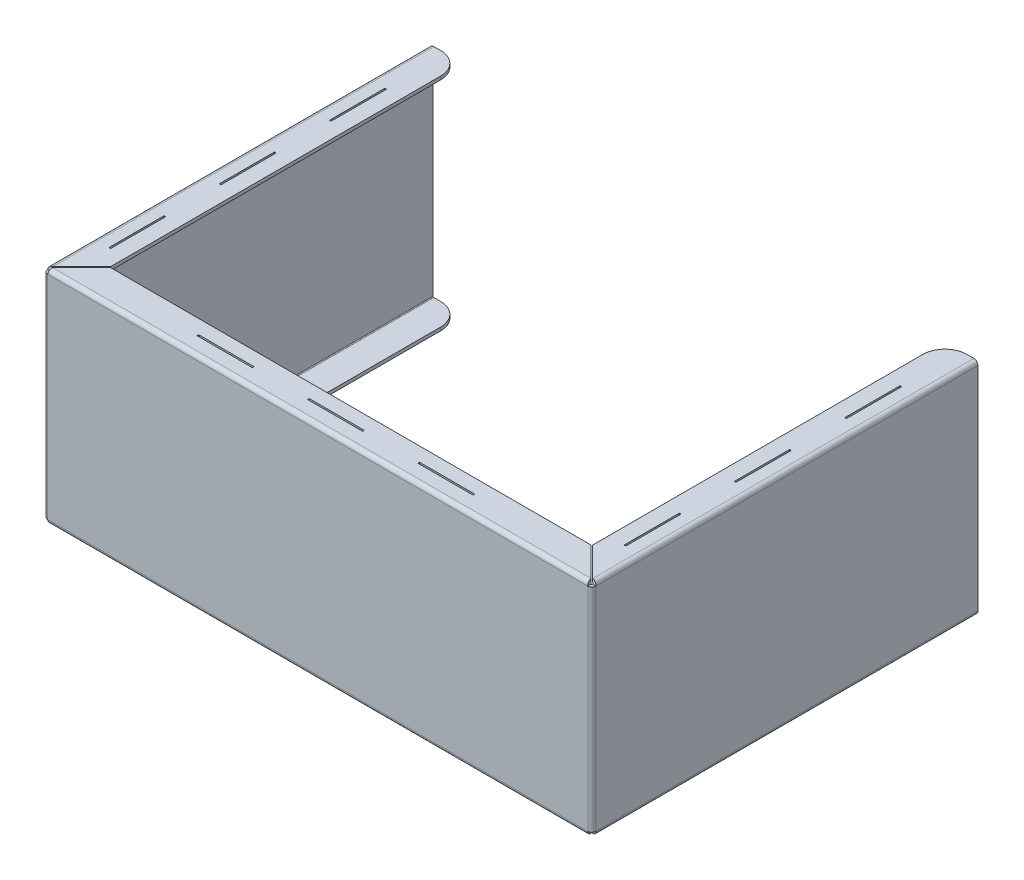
ISO-10303-21;
HEADER;
FILE_DESCRIPTION(('STEP AP214'),'2;1');
FILE_NAME('part.step','',(''),(''),'','','');
FILE_SCHEMA(('AUTOMOTIVE_DESIGN { 1 0 10303 214 1 1 1 1 }'));
ENDSEC;
DATA;
#1=APPLICATION_CONTEXT('core data for automotive mechanical design processes');
#2=APPLICATION_PROTOCOL_DEFINITION('international standard','automotive_design',2000,#1);
#3=PRODUCT_CONTEXT('',#1,'mechanical');
#4=PRODUCT('Part','Part','',(#3));
#5=PRODUCT_RELATED_PRODUCT_CATEGORY('part','',(#4));
#6=PRODUCT_DEFINITION_FORMATION('','',#4);
#7=PRODUCT_DEFINITION_CONTEXT('part definition',#1,'design');
#8=PRODUCT_DEFINITION('design','',#6,#7);
#9=PRODUCT_DEFINITION_SHAPE('','',#8);
#10=(LENGTH_UNIT() NAMED_UNIT(*) SI_UNIT(.MILLI.,.METRE.));
#11=(NAMED_UNIT(*) PLANE_ANGLE_UNIT() SI_UNIT($,.RADIAN.));
#12=(NAMED_UNIT(*) SI_UNIT($,.STERADIAN.) SOLID_ANGLE_UNIT());
#13=UNCERTAINTY_MEASURE_WITH_UNIT(LENGTH_MEASURE(1.E-05),#10,'distance_accuracy_value','');
#14=(GEOMETRIC_REPRESENTATION_CONTEXT(3) GLOBAL_UNCERTAINTY_ASSIGNED_CONTEXT((#13)) GLOBAL_UNIT_ASSIGNED_CONTEXT((#10,
#11,#12)) REPRESENTATION_CONTEXT('',''));
#15=CARTESIAN_POINT('',(0.,0.,0.));
#16=DIRECTION('',(0.,0.,1.));
#17=DIRECTION('',(1.,0.,0.));
#18=AXIS2_PLACEMENT_3D('',#15,#16,#17);
#19=CARTESIAN_POINT('',(-244.7634,100.,-3.73659999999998));
#20=DIRECTION('',(0.,1.,0.));
#21=DIRECTION('',(-1.,0.,0.));
#22=AXIS2_PLACEMENT_3D('',#19,#20,#21);
#23=CYLINDRICAL_SURFACE('',#22,3.73659999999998);
#24=DIRECTION('',(0.,1.,0.));
#25=VECTOR('',#24,1.);
#26=CARTESIAN_POINT('',(-248.5,0.,-3.73659999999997));
#27=LINE('',#26,#25);
#28=CARTESIAN_POINT('',(-248.5,-96.2600000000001,-3.73660000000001));
#29=VERTEX_POINT('',#28);
#30=CARTESIAN_POINT('',(-248.5,96.26,-3.73659999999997));
#31=VERTEX_POINT('',#30);
#32=EDGE_CURVE('E773',#29,#31,#27,.T.);
#33=ORIENTED_EDGE('',*,*,#32,.F.);
#34=CARTESIAN_POINT('',(-244.7634,-96.2600000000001,-3.73660000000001));
#35=DIRECTION('',(0.,1.,0.));
#36=DIRECTION('',(0.,0.,1.));
#37=AXIS2_PLACEMENT_3D('',#34,#35,#36);
#38=CIRCLE('',#37,3.7366);
#39=CARTESIAN_POINT('',(-244.7634,-96.2600000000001,0.));
#40=VERTEX_POINT('',#39);
#41=EDGE_CURVE('E1060',#40,#29,#38,.F.);
#42=ORIENTED_EDGE('',*,*,#41,.F.);
#43=DIRECTION('',(0.,1.,0.));
#44=VECTOR('',#43,1.);
#45=CARTESIAN_POINT('',(-244.7634,100.,0.));
#46=LINE('',#45,#44);
#47=CARTESIAN_POINT('',(-244.7634,96.2600000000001,0.));
#48=VERTEX_POINT('',#47);
#49=EDGE_CURVE('E779',#48,#40,#46,.F.);
#50=ORIENTED_EDGE('',*,*,#49,.F.);
#51=CARTESIAN_POINT('',(-244.7634,96.2599999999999,-3.73660000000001));
#52=DIRECTION('',(0.,1.,0.));
#53=DIRECTION('',(0.,0.,1.));
#54=AXIS2_PLACEMENT_3D('',#51,#52,#53);
#55=CIRCLE('',#54,3.7366);
#56=EDGE_CURVE('E1599',#31,#48,#55,.T.);
#57=ORIENTED_EDGE('',*,*,#56,.F.);
#58=EDGE_LOOP('',(#33,#42,#50,#57));
#59=FACE_BOUND('',#58,.T.);
#60=ADVANCED_FACE('F200',(#59),#23,.T.);
#61=CARTESIAN_POINT('',(-244.7634,100.,-3.73659999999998));
#62=DIRECTION('',(0.,1.,0.));
#63=DIRECTION('',(-1.,0.,0.));
#64=AXIS2_PLACEMENT_3D('',#61,#62,#63);
#65=CYLINDRICAL_SURFACE('',#64,0.736599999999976);
#66=CARTESIAN_POINT('',(-244.7634,-96.2600000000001,-3.73660000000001));
#67=DIRECTION('',(0.,-1.,0.));
#68=DIRECTION('',(0.,0.,-1.));
#69=AXIS2_PLACEMENT_3D('',#66,#67,#68);
#70=CIRCLE('',#69,0.736600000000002);
#71=CARTESIAN_POINT('',(-244.7634,-96.2600000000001,-3.00000000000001));
#72=VERTEX_POINT('',#71);
#73=CARTESIAN_POINT('',(-245.5,-96.2600000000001,-3.73660000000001));
#74=VERTEX_POINT('',#73);
#75=EDGE_CURVE('E1057',#72,#74,#70,.T.);
#76=ORIENTED_EDGE('',*,*,#75,.T.);
#77=DIRECTION('',(0.,-1.,0.));
#78=VECTOR('',#77,1.);
#79=CARTESIAN_POINT('',(-245.5,-100.,-3.73659999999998));
#80=LINE('',#79,#78);
#81=CARTESIAN_POINT('',(-245.5,96.26,-3.73659999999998));
#82=VERTEX_POINT('',#81);
#83=EDGE_CURVE('E776',#74,#82,#80,.F.);
#84=ORIENTED_EDGE('',*,*,#83,.T.);
#85=CARTESIAN_POINT('',(-244.7634,96.26,-3.73660000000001));
#86=DIRECTION('',(0.,1.,0.));
#87=DIRECTION('',(0.,0.,1.));
#88=AXIS2_PLACEMENT_3D('',#85,#86,#87);
#89=CIRCLE('',#88,0.736600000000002);
#90=CARTESIAN_POINT('',(-244.7634,96.2600000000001,-3.00000000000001));
#91=VERTEX_POINT('',#90);
#92=EDGE_CURVE('E1597',#82,#91,#89,.T.);
#93=ORIENTED_EDGE('',*,*,#92,.T.);
#94=DIRECTION('',(0.,1.,0.));
#95=VECTOR('',#94,1.);
#96=CARTESIAN_POINT('',(-244.7634,100.,-3.00000000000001));
#97=LINE('',#96,#95);
#98=EDGE_CURVE('E769',#91,#72,#97,.F.);
#99=ORIENTED_EDGE('',*,*,#98,.T.);
#100=EDGE_LOOP('',(#76,#84,#93,#99));
#101=FACE_BOUND('',#100,.T.);
#102=ADVANCED_FACE('F904',(#101),#65,.F.);
#103=CARTESIAN_POINT('',(244.7634,-100.,-3.7366));
#104=DIRECTION('',(0.,-1.,0.));
#105=DIRECTION('',(1.,0.,0.));
#106=AXIS2_PLACEMENT_3D('',#103,#104,#105);
#107=CYLINDRICAL_SURFACE('',#106,3.73659999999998);
#108=DIRECTION('',(0.,-1.,0.));
#109=VECTOR('',#108,1.);
#110=CARTESIAN_POINT('',(244.7634,-100.,0.));
#111=LINE('',#110,#109);
#112=CARTESIAN_POINT('',(244.7634,-96.2600000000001,0.));
#113=VERTEX_POINT('',#112);
#114=CARTESIAN_POINT('',(244.7634,96.2600000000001,0.));
#115=VERTEX_POINT('',#114);
#116=EDGE_CURVE('E731',#113,#115,#111,.F.);
#117=ORIENTED_EDGE('',*,*,#116,.F.);
#118=CARTESIAN_POINT('',(244.7634,-96.2600000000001,-3.73660000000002));
#119=DIRECTION('',(0.,-1.,0.));
#120=DIRECTION('',(0.,0.,-1.));
#121=AXIS2_PLACEMENT_3D('',#118,#119,#120);
#122=CIRCLE('',#121,3.7366);
#123=CARTESIAN_POINT('',(248.5,-96.2600000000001,-3.73660000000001));
#124=VERTEX_POINT('',#123);
#125=EDGE_CURVE('E742',#124,#113,#122,.T.);
#126=ORIENTED_EDGE('',*,*,#125,.F.);
#127=DIRECTION('',(0.,-1.,0.));
#128=VECTOR('',#127,1.);
#129=CARTESIAN_POINT('',(248.5,100.,-3.7366));
#130=LINE('',#129,#128);
#131=CARTESIAN_POINT('',(248.5,96.2600000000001,-3.73660000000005));
#132=VERTEX_POINT('',#131);
#133=EDGE_CURVE('E1619',#124,#132,#130,.F.);
#134=ORIENTED_EDGE('',*,*,#133,.T.);
#135=CARTESIAN_POINT('',(244.7634,96.2600000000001,-3.7366));
#136=DIRECTION('',(0.,-1.,0.));
#137=DIRECTION('',(0.,0.,-1.));
#138=AXIS2_PLACEMENT_3D('',#135,#136,#137);
#139=CIRCLE('',#138,3.73659999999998);
#140=EDGE_CURVE('E1615',#132,#115,#139,.T.);
#141=ORIENTED_EDGE('',*,*,#140,.T.);
#142=EDGE_LOOP('',(#117,#126,#134,#141));
#143=FACE_BOUND('',#142,.T.);
#144=ADVANCED_FACE('F910',(#143),#107,.T.);
#145=CARTESIAN_POINT('',(244.7634,-100.,-3.7366));
#146=DIRECTION('',(0.,-1.,0.));
#147=DIRECTION('',(1.,0.,0.));
#148=AXIS2_PLACEMENT_3D('',#145,#146,#147);
#149=CYLINDRICAL_SURFACE('',#148,0.736599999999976);
#150=CARTESIAN_POINT('',(244.7634,-96.2600000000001,-3.73660000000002));
#151=DIRECTION('',(0.,-1.,0.));
#152=DIRECTION('',(0.,0.,-1.));
#153=AXIS2_PLACEMENT_3D('',#150,#151,#152);
#154=CIRCLE('',#153,0.736600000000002);
#155=CARTESIAN_POINT('',(245.5,-96.2600000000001,-3.73660000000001));
#156=VERTEX_POINT('',#155);
#157=CARTESIAN_POINT('',(244.7634,-96.2600000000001,-3.00000000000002));
#158=VERTEX_POINT('',#157);
#159=EDGE_CURVE('E739',#156,#158,#154,.T.);
#160=ORIENTED_EDGE('',*,*,#159,.T.);
#161=DIRECTION('',(0.,-1.,0.));
#162=VECTOR('',#161,1.);
#163=CARTESIAN_POINT('',(244.7634,-100.,-3.00000000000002));
#164=LINE('',#163,#162);
#165=CARTESIAN_POINT('',(244.7634,96.2600000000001,-3.00000000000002));
#166=VERTEX_POINT('',#165);
#167=EDGE_CURVE('E732',#158,#166,#164,.F.);
#168=ORIENTED_EDGE('',*,*,#167,.T.);
#169=CARTESIAN_POINT('',(244.7634,96.2600000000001,-3.7366));
#170=DIRECTION('',(0.,-1.,0.));
#171=DIRECTION('',(0.,0.,1.));
#172=AXIS2_PLACEMENT_3D('',#169,#170,#171);
#173=CIRCLE('',#172,0.736599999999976);
#174=CARTESIAN_POINT('',(245.5,96.2600000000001,-3.73659999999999));
#175=VERTEX_POINT('',#174);
#176=EDGE_CURVE('E1594',#175,#166,#173,.T.);
#177=ORIENTED_EDGE('',*,*,#176,.F.);
#178=DIRECTION('',(0.,-1.,0.));
#179=VECTOR('',#178,1.);
#180=CARTESIAN_POINT('',(245.5,100.,-3.73660000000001));
#181=LINE('',#180,#179);
#182=EDGE_CURVE('E753',#175,#156,#181,.T.);
#183=ORIENTED_EDGE('',*,*,#182,.T.);
#184=EDGE_LOOP('',(#160,#168,#177,#183));
#185=FACE_BOUND('',#184,.T.);
#186=ADVANCED_FACE('F749',(#185),#149,.F.);
#187=CARTESIAN_POINT('',(248.5,0.,8.65178199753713E-13));
#188=DIRECTION('',(-1.,0.,0.));
#189=DIRECTION('',(0.,0.,1.));
#190=AXIS2_PLACEMENT_3D('',#187,#188,#189);
#191=PLANE('',#190);
#192=DIRECTION('',(0.,0.,1.));
#193=VECTOR('',#192,1.);
#194=CARTESIAN_POINT('',(248.500000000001,-96.2634,-3.73659999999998));
#195=LINE('',#194,#193);
#196=CARTESIAN_POINT('',(248.5,-96.2634,-3.73659999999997));
#197=VERTEX_POINT('',#196);
#198=CARTESIAN_POINT('',(248.500000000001,-96.2634,-350.));
#199=VERTEX_POINT('',#198);
#200=EDGE_CURVE('E1107',#197,#199,#195,.F.);
#201=ORIENTED_EDGE('',*,*,#200,.T.);
#202=DIRECTION('',(0.,1.,0.));
#203=VECTOR('',#202,1.);
#204=CARTESIAN_POINT('',(248.500000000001,100.,-350.));
#205=LINE('',#204,#203);
#206=CARTESIAN_POINT('',(248.500000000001,96.2634000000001,-350.));
#207=VERTEX_POINT('',#206);
#208=EDGE_CURVE('E760',#207,#199,#205,.F.);
#209=ORIENTED_EDGE('',*,*,#208,.F.);
#210=DIRECTION('',(0.,0.,-1.));
#211=VECTOR('',#210,1.);
#212=CARTESIAN_POINT('',(248.500000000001,96.2634000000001,-350.));
#213=LINE('',#212,#211);
#214=CARTESIAN_POINT('',(248.5,96.2634000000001,-3.73659999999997));
#215=VERTEX_POINT('',#214);
#216=EDGE_CURVE('E1206',#207,#215,#213,.F.);
#217=ORIENTED_EDGE('',*,*,#216,.T.);
#218=DIRECTION('',(0.,-1.,0.));
#219=VECTOR('',#218,1.);
#220=CARTESIAN_POINT('',(248.5,-100.,-3.73660000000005));
#221=LINE('',#220,#219);
#222=EDGE_CURVE('E1613',#215,#132,#221,.T.);
#223=ORIENTED_EDGE('',*,*,#222,.T.);
#224=ORIENTED_EDGE('',*,*,#133,.F.);
#225=EDGE_CURVE('E1191',#197,#124,#130,.F.);
#226=ORIENTED_EDGE('',*,*,#225,.F.);
#227=EDGE_LOOP('',(#201,#209,#217,#223,#224,#226));
#228=FACE_BOUND('',#227,.T.);
#229=ADVANCED_FACE('F1187',(#228),#191,.F.);
#230=CARTESIAN_POINT('',(245.5,0.,8.54703755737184E-13));
#231=DIRECTION('',(-1.,0.,0.));
#232=DIRECTION('',(0.,0.,1.));
#233=AXIS2_PLACEMENT_3D('',#230,#231,#232);
#234=PLANE('',#233);
#235=DIRECTION('',(0.,-1.,0.));
#236=VECTOR('',#235,1.);
#237=CARTESIAN_POINT('',(245.500000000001,0.,-350.));
#238=LINE('',#237,#236);
#239=CARTESIAN_POINT('',(245.500000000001,96.2634000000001,-350.));
#240=VERTEX_POINT('',#239);
#241=CARTESIAN_POINT('',(245.500000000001,-96.2634,-350.));
#242=VERTEX_POINT('',#241);
#243=EDGE_CURVE('E762',#240,#242,#238,.T.);
#244=ORIENTED_EDGE('',*,*,#243,.T.);
#245=DIRECTION('',(0.,0.,1.));
#246=VECTOR('',#245,1.);
#247=CARTESIAN_POINT('',(245.500000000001,-96.2634,-3.73659999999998));
#248=LINE('',#247,#246);
#249=CARTESIAN_POINT('',(245.500000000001,-96.2634,-3.73659999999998));
#250=VERTEX_POINT('',#249);
#251=EDGE_CURVE('E1112',#250,#242,#248,.F.);
#252=ORIENTED_EDGE('',*,*,#251,.F.);
#253=DIRECTION('',(1.70844682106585E-13,1.,0.));
#254=VECTOR('',#253,1.);
#255=CARTESIAN_POINT('',(245.5,-100.,-3.73659999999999));
#256=LINE('',#255,#254);
#257=EDGE_CURVE('E754',#250,#156,#256,.T.);
#258=ORIENTED_EDGE('',*,*,#257,.T.);
#259=ORIENTED_EDGE('',*,*,#182,.F.);
#260=CARTESIAN_POINT('',(245.5,96.2634000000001,-3.73659999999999));
#261=VERTEX_POINT('',#260);
#262=EDGE_CURVE('E1623',#261,#175,#181,.T.);
#263=ORIENTED_EDGE('',*,*,#262,.F.);
#264=DIRECTION('',(0.,0.,-1.));
#265=VECTOR('',#264,1.);
#266=CARTESIAN_POINT('',(245.500000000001,96.2634000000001,-350.));
#267=LINE('',#266,#265);
#268=EDGE_CURVE('E1221',#240,#261,#267,.F.);
#269=ORIENTED_EDGE('',*,*,#268,.F.);
#270=EDGE_LOOP('',(#244,#252,#258,#259,#263,#269));
#271=FACE_BOUND('',#270,.T.);
#272=ADVANCED_FACE('F920',(#271),#234,.T.);
#273=CARTESIAN_POINT('',(0.,0.,-3.));
#274=DIRECTION('',(0.,0.,-1.));
#275=DIRECTION('',(-1.,0.,0.));
#276=AXIS2_PLACEMENT_3D('',#273,#274,#275);
#277=PLANE('',#276);
#278=CARTESIAN_POINT('',(244.7634,-96.2634000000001,-3.00000000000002));
#279=VERTEX_POINT('',#278);
#280=EDGE_CURVE('E720',#279,#158,#164,.F.);
#281=ORIENTED_EDGE('',*,*,#280,.F.);
#282=DIRECTION('',(-1.,0.,0.));
#283=VECTOR('',#282,1.);
#284=CARTESIAN_POINT('',(-244.7634,-96.2634000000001,-3.00000000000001));
#285=LINE('',#284,#283);
#286=CARTESIAN_POINT('',(-244.7634,-96.2634000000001,-3.00000000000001));
#287=VERTEX_POINT('',#286);
#288=EDGE_CURVE('E1660',#287,#279,#285,.F.);
#289=ORIENTED_EDGE('',*,*,#288,.F.);
#290=DIRECTION('',(0.,1.,0.));
#291=VECTOR('',#290,1.);
#292=CARTESIAN_POINT('',(-244.7634,-100.,-3.));
#293=LINE('',#292,#291);
#294=EDGE_CURVE('E1065',#287,#72,#293,.T.);
#295=ORIENTED_EDGE('',*,*,#294,.T.);
#296=ORIENTED_EDGE('',*,*,#98,.F.);
#297=CARTESIAN_POINT('',(-244.7634,96.2634,-3.00000000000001));
#298=VERTEX_POINT('',#297);
#299=EDGE_CURVE('E783',#298,#91,#97,.F.);
#300=ORIENTED_EDGE('',*,*,#299,.F.);
#301=DIRECTION('',(1.,0.,0.));
#302=VECTOR('',#301,1.);
#303=CARTESIAN_POINT('',(244.7634,96.2634000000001,-3.00000000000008));
#304=LINE('',#303,#302);
#305=CARTESIAN_POINT('',(244.7634,96.2634,-3.00000000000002));
#306=VERTEX_POINT('',#305);
#307=EDGE_CURVE('E1884',#306,#298,#304,.F.);
#308=ORIENTED_EDGE('',*,*,#307,.F.);
#309=DIRECTION('',(0.,1.,0.));
#310=VECTOR('',#309,1.);
#311=CARTESIAN_POINT('',(244.7634,96.2600000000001,-3.00000000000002));
#312=LINE('',#311,#310);
#313=EDGE_CURVE('E759',#166,#306,#312,.T.);
#314=ORIENTED_EDGE('',*,*,#313,.F.);
#315=ORIENTED_EDGE('',*,*,#167,.F.);
#316=EDGE_LOOP('',(#281,#289,#295,#296,#300,#308,#314,#315));
#317=FACE_BOUND('',#316,.T.);
#318=ADVANCED_FACE('F757',(#317),#277,.T.);
#319=CARTESIAN_POINT('',(0.,0.,0.));
#320=DIRECTION('',(0.,0.,-1.));
#321=DIRECTION('',(-1.,0.,0.));
#322=AXIS2_PLACEMENT_3D('',#319,#320,#321);
#323=PLANE('',#322);
#324=DIRECTION('',(-1.,0.,0.));
#325=VECTOR('',#324,1.);
#326=CARTESIAN_POINT('',(-244.7634,-96.2634000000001,0.));
#327=LINE('',#326,#325);
#328=CARTESIAN_POINT('',(-244.7634,-96.2634000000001,0.));
#329=VERTEX_POINT('',#328);
#330=CARTESIAN_POINT('',(244.7634,-96.2634000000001,0.));
#331=VERTEX_POINT('',#330);
#332=EDGE_CURVE('E1733',#329,#331,#327,.F.);
#333=ORIENTED_EDGE('',*,*,#332,.T.);
#334=EDGE_CURVE('E778',#331,#113,#111,.F.);
#335=ORIENTED_EDGE('',*,*,#334,.T.);
#336=ORIENTED_EDGE('',*,*,#116,.T.);
#337=DIRECTION('',(0.,-1.,0.));
#338=VECTOR('',#337,1.);
#339=CARTESIAN_POINT('',(244.7634,-100.,0.));
#340=LINE('',#339,#338);
#341=CARTESIAN_POINT('',(244.7634,96.2634,0.));
#342=VERTEX_POINT('',#341);
#343=EDGE_CURVE('E1609',#115,#342,#340,.F.);
#344=ORIENTED_EDGE('',*,*,#343,.T.);
#345=DIRECTION('',(1.,0.,0.));
#346=VECTOR('',#345,1.);
#347=CARTESIAN_POINT('',(244.7634,96.2634000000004,0.));
#348=LINE('',#347,#346);
#349=CARTESIAN_POINT('',(-244.7634,96.2634000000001,0.));
#350=VERTEX_POINT('',#349);
#351=EDGE_CURVE('E1649',#342,#350,#348,.F.);
#352=ORIENTED_EDGE('',*,*,#351,.T.);
#353=EDGE_CURVE('E782',#350,#48,#46,.F.);
#354=ORIENTED_EDGE('',*,*,#353,.T.);
#355=ORIENTED_EDGE('',*,*,#49,.T.);
#356=DIRECTION('',(0.,-1.,0.));
#357=VECTOR('',#356,1.);
#358=CARTESIAN_POINT('',(-244.7634,0.,0.));
#359=LINE('',#358,#357);
#360=EDGE_CURVE('E745',#40,#329,#359,.T.);
#361=ORIENTED_EDGE('',*,*,#360,.T.);
#362=EDGE_LOOP('',(#333,#335,#336,#344,#352,#354,#355,#361));
#363=FACE_BOUND('',#362,.T.);
#364=ADVANCED_FACE('F919',(#363),#323,.F.);
#365=CARTESIAN_POINT('',(-248.5,0.,8.85055031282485E-13));
#366=DIRECTION('',(-1.,0.,0.));
#367=DIRECTION('',(0.,0.,1.));
#368=AXIS2_PLACEMENT_3D('',#365,#366,#367);
#369=PLANE('',#368);
#370=DIRECTION('',(0.,1.,0.));
#371=VECTOR('',#370,1.);
#372=CARTESIAN_POINT('',(-248.500000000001,100.,-350.));
#373=LINE('',#372,#371);
#374=CARTESIAN_POINT('',(-248.500000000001,-96.2633999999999,-350.));
#375=VERTEX_POINT('',#374);
#376=CARTESIAN_POINT('',(-248.500000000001,96.2634,-350.));
#377=VERTEX_POINT('',#376);
#378=EDGE_CURVE('E767',#375,#377,#373,.T.);
#379=ORIENTED_EDGE('',*,*,#378,.F.);
#380=DIRECTION('',(0.,0.,-1.));
#381=VECTOR('',#380,1.);
#382=CARTESIAN_POINT('',(-248.500000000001,-96.2633999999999,-350.));
#383=LINE('',#382,#381);
#384=CARTESIAN_POINT('',(-248.5,-96.2634,-3.73659999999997));
#385=VERTEX_POINT('',#384);
#386=EDGE_CURVE('E981',#375,#385,#383,.F.);
#387=ORIENTED_EDGE('',*,*,#386,.T.);
#388=EDGE_CURVE('E772',#385,#29,#27,.T.);
#389=ORIENTED_EDGE('',*,*,#388,.T.);
#390=ORIENTED_EDGE('',*,*,#32,.T.);
#391=DIRECTION('',(0.,-1.,0.));
#392=VECTOR('',#391,1.);
#393=CARTESIAN_POINT('',(-248.5,0.,-3.73660000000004));
#394=LINE('',#393,#392);
#395=CARTESIAN_POINT('',(-248.5,96.2634,-3.73659999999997));
#396=VERTEX_POINT('',#395);
#397=EDGE_CURVE('E1591',#396,#31,#394,.T.);
#398=ORIENTED_EDGE('',*,*,#397,.F.);
#399=DIRECTION('',(0.,0.,1.));
#400=VECTOR('',#399,1.);
#401=CARTESIAN_POINT('',(-248.500000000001,96.2634,-3.73659999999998));
#402=LINE('',#401,#400);
#403=EDGE_CURVE('E846',#396,#377,#402,.F.);
#404=ORIENTED_EDGE('',*,*,#403,.T.);
#405=EDGE_LOOP('',(#379,#387,#389,#390,#398,#404));
#406=FACE_BOUND('',#405,.T.);
#407=ADVANCED_FACE('F923',(#406),#369,.T.);
#408=CARTESIAN_POINT('',(-245.5,0.,8.74580587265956E-13));
#409=DIRECTION('',(-1.,0.,0.));
#410=DIRECTION('',(0.,0.,1.));
#411=AXIS2_PLACEMENT_3D('',#408,#409,#410);
#412=PLANE('',#411);
#413=DIRECTION('',(0.,0.,-1.));
#414=VECTOR('',#413,1.);
#415=CARTESIAN_POINT('',(-245.500000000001,-96.2634,-350.));
#416=LINE('',#415,#414);
#417=CARTESIAN_POINT('',(-245.500000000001,-96.2634,-350.));
#418=VERTEX_POINT('',#417);
#419=CARTESIAN_POINT('',(-245.5,-96.2634,-3.73659999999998));
#420=VERTEX_POINT('',#419);
#421=EDGE_CURVE('E985',#418,#420,#416,.F.);
#422=ORIENTED_EDGE('',*,*,#421,.F.);
#423=DIRECTION('',(0.,-1.,0.));
#424=VECTOR('',#423,1.);
#425=CARTESIAN_POINT('',(-245.500000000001,0.,-350.));
#426=LINE('',#425,#424);
#427=CARTESIAN_POINT('',(-245.500000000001,96.2634,-350.));
#428=VERTEX_POINT('',#427);
#429=EDGE_CURVE('E770',#418,#428,#426,.F.);
#430=ORIENTED_EDGE('',*,*,#429,.T.);
#431=DIRECTION('',(0.,0.,1.));
#432=VECTOR('',#431,1.);
#433=CARTESIAN_POINT('',(-245.500000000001,96.2634,-3.73659999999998));
#434=LINE('',#433,#432);
#435=CARTESIAN_POINT('',(-245.500000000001,96.2634,-3.73659999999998));
#436=VERTEX_POINT('',#435);
#437=EDGE_CURVE('E851',#436,#428,#434,.F.);
#438=ORIENTED_EDGE('',*,*,#437,.F.);
#439=DIRECTION('',(-1.63416652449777E-13,-1.,0.));
#440=VECTOR('',#439,1.);
#441=CARTESIAN_POINT('',(-245.5,100.,-3.73659999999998));
#442=LINE('',#441,#440);
#443=EDGE_CURVE('E1595',#436,#82,#442,.T.);
#444=ORIENTED_EDGE('',*,*,#443,.T.);
#445=ORIENTED_EDGE('',*,*,#83,.F.);
#446=EDGE_CURVE('E775',#420,#74,#80,.F.);
#447=ORIENTED_EDGE('',*,*,#446,.F.);
#448=EDGE_LOOP('',(#422,#430,#438,#444,#445,#447));
#449=FACE_BOUND('',#448,.T.);
#450=ADVANCED_FACE('F1045',(#449),#412,.F.);
#451=CARTESIAN_POINT('',(-248.500000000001,100.,-350.));
#452=DIRECTION('',(0.,0.,-1.));
#453=DIRECTION('',(-1.,0.,0.));
#454=AXIS2_PLACEMENT_3D('',#451,#452,#453);
#455=PLANE('',#454);
#456=ORIENTED_EDGE('',*,*,#429,.F.);
#457=DIRECTION('',(-1.,0.,0.));
#458=VECTOR('',#457,1.);
#459=CARTESIAN_POINT('',(-245.500000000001,-96.2634,-350.));
#460=LINE('',#459,#458);
#461=EDGE_CURVE('E991',#418,#375,#460,.T.);
#462=ORIENTED_EDGE('',*,*,#461,.T.);
#463=ORIENTED_EDGE('',*,*,#378,.T.);
#464=DIRECTION('',(-1.,0.,0.));
#465=VECTOR('',#464,1.);
#466=CARTESIAN_POINT('',(-245.500000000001,96.2634,-350.));
#467=LINE('',#466,#465);
#468=EDGE_CURVE('E857',#428,#377,#467,.T.);
#469=ORIENTED_EDGE('',*,*,#468,.F.);
#470=EDGE_LOOP('',(#456,#462,#463,#469));
#471=FACE_BOUND('',#470,.T.);
#472=ADVANCED_FACE('F900',(#471),#455,.T.);
#473=CARTESIAN_POINT('',(248.500000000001,100.,-350.));
#474=DIRECTION('',(0.,0.,-1.));
#475=DIRECTION('',(-1.,0.,0.));
#476=AXIS2_PLACEMENT_3D('',#473,#474,#475);
#477=PLANE('',#476);
#478=DIRECTION('',(1.,0.,0.));
#479=VECTOR('',#478,1.);
#480=CARTESIAN_POINT('',(245.500000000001,-96.2634,-350.));
#481=LINE('',#480,#479);
#482=EDGE_CURVE('E1116',#242,#199,#481,.T.);
#483=ORIENTED_EDGE('',*,*,#482,.F.);
#484=ORIENTED_EDGE('',*,*,#243,.F.);
#485=DIRECTION('',(1.,0.,0.));
#486=VECTOR('',#485,1.);
#487=CARTESIAN_POINT('',(245.500000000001,96.2634000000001,-350.));
#488=LINE('',#487,#486);
#489=EDGE_CURVE('E1195',#240,#207,#488,.T.);
#490=ORIENTED_EDGE('',*,*,#489,.T.);
#491=ORIENTED_EDGE('',*,*,#208,.T.);
#492=EDGE_LOOP('',(#483,#484,#490,#491));
#493=FACE_BOUND('',#492,.T.);
#494=ADVANCED_FACE('F893',(#493),#477,.T.);
#495=CARTESIAN_POINT('',(-244.763400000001,96.2634,-350.));
#496=DIRECTION('',(0.,0.,-1.));
#497=DIRECTION('',(-1.,0.,0.));
#498=AXIS2_PLACEMENT_3D('',#495,#496,#497);
#499=PLANE('',#498);
#500=DIRECTION('',(0.,-1.,0.));
#501=VECTOR('',#500,1.);
#502=CARTESIAN_POINT('',(-244.763400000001,100.,-350.));
#503=LINE('',#502,#501);
#504=CARTESIAN_POINT('',(-244.763400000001,97.,-350.));
#505=VERTEX_POINT('',#504);
#506=CARTESIAN_POINT('',(-244.763400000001,100.,-350.));
#507=VERTEX_POINT('',#506);
#508=EDGE_CURVE('E839',#505,#507,#503,.F.);
#509=ORIENTED_EDGE('',*,*,#508,.F.);
#510=CARTESIAN_POINT('',(-244.763400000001,96.2634,-350.));
#511=DIRECTION('',(0.,0.,1.));
#512=DIRECTION('',(1.,0.,0.));
#513=AXIS2_PLACEMENT_3D('',#510,#511,#512);
#514=CIRCLE('',#513,0.736600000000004);
#515=EDGE_CURVE('E847',#428,#505,#514,.F.);
#516=ORIENTED_EDGE('',*,*,#515,.F.);
#517=ORIENTED_EDGE('',*,*,#468,.T.);
#518=CARTESIAN_POINT('',(-244.763400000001,96.2634,-350.));
#519=DIRECTION('',(0.,0.,1.));
#520=DIRECTION('',(1.,0.,0.));
#521=AXIS2_PLACEMENT_3D('',#518,#519,#520);
#522=CIRCLE('',#521,3.7366);
#523=EDGE_CURVE('E842',#377,#507,#522,.F.);
#524=ORIENTED_EDGE('',*,*,#523,.T.);
#525=EDGE_LOOP('',(#509,#516,#517,#524));
#526=FACE_BOUND('',#525,.T.);
#527=ADVANCED_FACE('F891',(#526),#499,.T.);
#528=CARTESIAN_POINT('',(-244.763399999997,100.03,-4.44370678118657));
#529=CARTESIAN_POINT('',(-245.256534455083,100.03,-4.38477071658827));
#530=CARTESIAN_POINT('',(-245.749299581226,99.9319654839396,-4.32585565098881));
#531=CARTESIAN_POINT('',(-246.660331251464,99.5546038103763,-4.20800452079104));
#532=CARTESIAN_POINT('',(-247.078151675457,99.2754251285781,-4.14907895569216));
#533=CARTESIAN_POINT('',(-247.775425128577,98.5781516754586,-4.03122782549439));
#534=CARTESIAN_POINT('',(-248.054603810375,98.1603312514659,-3.97230226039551));
#535=CARTESIAN_POINT('',(-248.431965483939,97.2492995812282,-3.85445113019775));
#536=CARTESIAN_POINT('',(-248.530000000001,96.7565344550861,-3.79553606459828));
#537=CARTESIAN_POINT('',(-248.530000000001,96.2634,-3.73659999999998));
#538=CARTESIAN_POINT('',(-244.763399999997,100.,-4.44370678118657));
#539=CARTESIAN_POINT('',(-245.252606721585,100.,-4.38477074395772));
#540=CARTESIAN_POINT('',(-245.741447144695,99.9027463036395,-4.32585565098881));
#541=CARTESIAN_POINT('',(-246.645222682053,99.5283902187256,-4.20800452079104));
#542=CARTESIAN_POINT('',(-247.059715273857,99.2514351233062,-4.14907895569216));
#543=CARTESIAN_POINT('',(-247.751435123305,98.5597152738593,-4.03122782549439));
#544=CARTESIAN_POINT('',(-248.028390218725,98.1452226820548,-3.97230226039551));
#545=CARTESIAN_POINT('',(-248.402746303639,97.2414471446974,-3.85445113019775));
#546=CARTESIAN_POINT('',(-248.500000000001,96.7526067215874,-3.79553603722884));
#547=CARTESIAN_POINT('',(-248.500000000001,96.2634,-3.73659999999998));
#548=CARTESIAN_POINT('',(-244.7634,97.,-4.44370678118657));
#549=CARTESIAN_POINT('',(-244.859833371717,97.0000000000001,-4.38477348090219));
#550=CARTESIAN_POINT('',(-244.956203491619,96.980828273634,-4.32585565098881));
#551=CARTESIAN_POINT('',(-245.134365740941,96.9070310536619,-4.20800452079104));
#552=CARTESIAN_POINT('',(-245.216075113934,96.8524345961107,-4.14907895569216));
#553=CARTESIAN_POINT('',(-245.352434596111,96.7160751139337,-4.03122782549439));
#554=CARTESIAN_POINT('',(-245.407031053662,96.6343657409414,-3.97230226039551));
#555=CARTESIAN_POINT('',(-245.480828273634,96.4562034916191,-3.85445113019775));
#556=CARTESIAN_POINT('',(-245.500000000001,96.359833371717,-3.79553330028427));
#557=CARTESIAN_POINT('',(-245.500000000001,96.2634,-3.73659999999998));
#558=CARTESIAN_POINT('',(-244.7634,96.9697,-4.44370678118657));
#559=CARTESIAN_POINT('',(-244.855866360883,96.9697000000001,-4.38477350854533));
#560=CARTESIAN_POINT('',(-244.948272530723,96.9513169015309,-4.32585565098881));
#561=CARTESIAN_POINT('',(-245.119106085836,96.8805553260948,-4.20800452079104));
#562=CARTESIAN_POINT('',(-245.197454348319,96.828204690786,-4.14907895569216));
#563=CARTESIAN_POINT('',(-245.328204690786,96.6974543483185,-4.03122782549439));
#564=CARTESIAN_POINT('',(-245.380555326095,96.6191060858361,-3.97230226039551));
#565=CARTESIAN_POINT('',(-245.451316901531,96.448272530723,-3.85445113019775));
#566=CARTESIAN_POINT('',(-245.469700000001,96.3558663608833,-3.79553327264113));
#567=CARTESIAN_POINT('',(-245.469700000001,96.2634,-3.73659999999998));
#568=B_SPLINE_SURFACE_WITH_KNOTS('',1,3,((#528,#529,#530,#531,#532,#533,#534,#535,#536,#537),
(#538,#539,#540,#541,#542,#543,#544,#545,#546,#547),(#548,#549,#550,#551,#552,#553,#554,#555,
#556,#557),(#558,#559,#560,#561,#562,#563,#564,#565,#566,#567)),.UNSPECIFIED.,.F.,.F.,.F.,(2,1,
1,2),(4,2,2,2,4),(-0.01,0.,1.,1.0101),(0.,0.25,0.5,0.75,1.),.UNSPECIFIED.);
#569=CARTESIAN_POINT('',(-244.7634,97.,-4.44370678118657));
#570=CARTESIAN_POINT('',(-244.790237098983,97.0000006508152,-4.42730387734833));
#571=CARTESIAN_POINT('',(-244.817058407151,96.9985319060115,-4.41091256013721));
#572=CARTESIAN_POINT('',(-244.870382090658,96.9926836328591,-4.37813068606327));
#573=CARTESIAN_POINT('',(-244.89688446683,96.9883041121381,-4.36174012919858));
#574=CARTESIAN_POINT('',(-244.975331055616,96.9708750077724,-4.31263058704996));
#575=CARTESIAN_POINT('',(-245.026373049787,96.9535345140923,-4.27987924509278));
#576=CARTESIAN_POINT('',(-245.118986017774,96.9103240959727,-4.21742214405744));
#577=CARTESIAN_POINT('',(-245.16099629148,96.885383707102,-4.18771290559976));
#578=CARTESIAN_POINT('',(-245.239276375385,96.827739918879,-4.12830251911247));
#579=CARTESIAN_POINT('',(-245.275549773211,96.7950414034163,-4.09860137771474));
#580=CARTESIAN_POINT('',(-245.340951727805,96.7231560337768,-4.03920791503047));
#581=CARTESIAN_POINT('',(-245.370081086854,96.6839699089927,-4.0095155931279));
#582=CARTESIAN_POINT('',(-245.420078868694,96.6006162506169,-3.95011437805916));
#583=CARTESIAN_POINT('',(-245.440944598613,96.5564470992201,-3.92040548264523));
#584=CARTESIAN_POINT('',(-245.471369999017,96.4710634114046,-3.8650097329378));
#585=CARTESIAN_POINT('',(-245.482074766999,96.4302534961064,-3.83932068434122));
#586=CARTESIAN_POINT('',(-245.496404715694,96.3474347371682,-3.78795673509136));
#587=CARTESIAN_POINT('',(-245.500033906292,96.3054265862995,-3.76228183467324));
#588=CARTESIAN_POINT('',(-245.500000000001,96.2634,-3.73659999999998));
#589=B_SPLINE_CURVE_WITH_KNOTS('',3,(#569,#570,#571,#572,#573,#574,#575,#576,#577,#578,#579,
#580,#581,#582,#583,#584,#585,#586,#587,#588),.UNSPECIFIED.,.F.,.F.,(4,2,2,2,2,2,2,2,2,4),(0.,
0.0942858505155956,0.188571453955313,0.376598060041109,0.547357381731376,0.718009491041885,
0.888642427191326,1.05933092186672,1.20700481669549,1.35459499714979),.UNSPECIFIED.);
#590=CARTESIAN_POINT('',(-244.763400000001,97.,-4.44370678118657));
#591=VERTEX_POINT('',#590);
#592=EDGE_CURVE('E856',#591,#436,#589,.T.);
#593=DIRECTION('',(0.,1.,0.));
#594=VECTOR('',#593,1.);
#595=CARTESIAN_POINT('',(-244.7634,97.,-4.44370678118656));
#596=LINE('',#595,#594);
#597=CARTESIAN_POINT('',(-244.7634,100.,-4.44370678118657));
#598=VERTEX_POINT('',#597);
#599=EDGE_CURVE('E1785',#598,#591,#596,.F.);
#600=CARTESIAN_POINT('',(-244.763399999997,100.,-4.44370678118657));
#601=CARTESIAN_POINT('',(-244.869265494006,100.000010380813,-4.43095233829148));
#602=CARTESIAN_POINT('',(-244.975126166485,99.9955009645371,-4.41819854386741));
#603=CARTESIAN_POINT('',(-245.18607907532,99.9775227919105,-4.39269212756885));
#604=CARTESIAN_POINT('',(-245.29117134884,99.9640544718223,-4.37993950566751));
#605=CARTESIAN_POINT('',(-245.49975973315,99.9282523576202,-4.35444377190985));
#606=CARTESIAN_POINT('',(-245.603256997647,99.9059253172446,-4.34170066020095));
#607=CARTESIAN_POINT('',(-245.807958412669,99.8525893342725,-4.31621702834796));
#608=CARTESIAN_POINT('',(-245.909162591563,99.8215804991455,-4.30347650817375));
#609=CARTESIAN_POINT('',(-246.208344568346,99.7157858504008,-4.26524488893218));
#610=CARTESIAN_POINT('',(-246.401975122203,99.6282175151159,-4.23973369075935));
#611=CARTESIAN_POINT('',(-246.771495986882,99.4216575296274,-4.18873349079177));
#612=CARTESIAN_POINT('',(-246.947389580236,99.3026717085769,-4.1632444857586));
#613=CARTESIAN_POINT('',(-247.276547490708,99.0366683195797,-4.11225994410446));
#614=CARTESIAN_POINT('',(-247.429812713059,98.8896518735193,-4.08676440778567));
#615=CARTESIAN_POINT('',(-247.709303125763,98.5717837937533,-4.03577141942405));
#616=CARTESIAN_POINT('',(-247.835522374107,98.4009269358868,-4.01027396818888));
#617=CARTESIAN_POINT('',(-248.057273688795,98.0403094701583,-3.95927354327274));
#618=CARTESIAN_POINT('',(-248.152798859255,97.8505446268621,-3.93377056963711));
#619=CARTESIAN_POINT('',(-248.310326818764,97.4576407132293,-3.88277221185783));
#620=CARTESIAN_POINT('',(-248.372351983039,97.2545106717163,-3.85727683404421));
#621=CARTESIAN_POINT('',(-248.444431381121,96.91884707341,-3.81591759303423));
#622=CARTESIAN_POINT('',(-248.465260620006,96.7885305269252,-3.80004177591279));
#623=CARTESIAN_POINT('',(-248.493040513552,96.5266279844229,-3.76831346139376));
#624=CARTESIAN_POINT('',(-248.500012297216,96.3950442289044,-3.75246096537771));
#625=CARTESIAN_POINT('',(-248.500000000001,96.2634,-3.73659999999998));
#626=B_SPLINE_CURVE_WITH_KNOTS('',3,(#600,#601,#602,#603,#604,#605,#606,#607,#608,#609,#610,
#611,#612,#613,#614,#615,#616,#617,#618,#619,#620,#621,#622,#623,#624,#625),.UNSPECIFIED.,.F.,
.F.,(4,2,2,2,2,2,2,2,2,2,2,2,4),(0.,0.319789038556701,0.639562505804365,0.959092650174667,
1.27861883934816,1.91741901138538,2.55610074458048,3.19475692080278,3.8335532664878,
4.47249302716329,5.11100549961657,5.50909906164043,5.90658516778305),.UNSPECIFIED.);
#627=EDGE_CURVE('E850',#598,#396,#626,.T.);
#628=DIRECTION('',(-1.,0.,0.));
#629=VECTOR('',#628,1.);
#630=CARTESIAN_POINT('',(-245.500000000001,96.2634,-3.73659999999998));
#631=LINE('',#630,#629);
#632=EDGE_CURVE('E845',#436,#396,#631,.T.);
#633=ORIENTED_EDGE('',*,*,#592,.F.);
#634=ORIENTED_EDGE('',*,*,#599,.F.);
#635=ORIENTED_EDGE('',*,*,#627,.T.);
#636=ORIENTED_EDGE('',*,*,#632,.F.);
#637=EDGE_LOOP('',(#633,#634,#635,#636));
#638=FACE_BOUND('',#637,.T.);
#639=ADVANCED_FACE('F874',(#638),#568,.F.);
#640=CARTESIAN_POINT('',(-244.763400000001,96.2634,-3.73659999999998));
#641=DIRECTION('',(0.,0.,1.));
#642=DIRECTION('',(0.,1.,0.));
#643=AXIS2_PLACEMENT_3D('',#640,#641,#642);
#644=CYLINDRICAL_SURFACE('',#643,3.7366);
#645=ORIENTED_EDGE('',*,*,#403,.F.);
#646=ORIENTED_EDGE('',*,*,#627,.F.);
#647=DIRECTION('',(0.,0.,1.));
#648=VECTOR('',#647,1.);
#649=CARTESIAN_POINT('',(-244.763400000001,100.,-350.));
#650=LINE('',#649,#648);
#651=EDGE_CURVE('E831',#598,#507,#650,.F.);
#652=ORIENTED_EDGE('',*,*,#651,.T.);
#653=ORIENTED_EDGE('',*,*,#523,.F.);
#654=EDGE_LOOP('',(#645,#646,#652,#653));
#655=FACE_BOUND('',#654,.T.);
#656=ADVANCED_FACE('F880',(#655),#644,.T.);
#657=CARTESIAN_POINT('',(-244.763400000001,96.2634,-3.73659999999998));
#658=DIRECTION('',(0.,0.,1.));
#659=DIRECTION('',(0.,1.,0.));
#660=AXIS2_PLACEMENT_3D('',#657,#658,#659);
#661=CYLINDRICAL_SURFACE('',#660,0.736600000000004);
#662=ORIENTED_EDGE('',*,*,#437,.T.);
#663=ORIENTED_EDGE('',*,*,#515,.T.);
#664=DIRECTION('',(0.,0.,1.));
#665=VECTOR('',#664,1.);
#666=CARTESIAN_POINT('',(-244.763400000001,97.,-350.));
#667=LINE('',#666,#665);
#668=EDGE_CURVE('E829',#505,#591,#667,.T.);
#669=ORIENTED_EDGE('',*,*,#668,.T.);
#670=ORIENTED_EDGE('',*,*,#592,.T.);
#671=EDGE_LOOP('',(#662,#663,#669,#670));
#672=FACE_BOUND('',#671,.T.);
#673=ADVANCED_FACE('F884',(#672),#661,.F.);
#674=CARTESIAN_POINT('',(-3.70268942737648E-13,100.000000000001,0.));
#675=DIRECTION('',(0.,-1.,0.));
#676=DIRECTION('',(1.,0.,0.));
#677=AXIS2_PLACEMENT_3D('',#674,#675,#676);
#678=PLANE('',#677);
#679=DIRECTION('',(0.,0.,1.));
#680=VECTOR('',#679,1.);
#681=CARTESIAN_POINT('',(-234.250000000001,100.000000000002,-195.));
#682=LINE('',#681,#680);
#683=CARTESIAN_POINT('',(-234.250000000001,100.,-195.));
#684=VERTEX_POINT('',#683);
#685=CARTESIAN_POINT('',(-234.250000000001,100.000000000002,-145.));
#686=VERTEX_POINT('',#685);
#687=EDGE_CURVE('E1418',#684,#686,#682,.T.);
#688=ORIENTED_EDGE('',*,*,#687,.F.);
#689=DIRECTION('',(-1.,0.,0.));
#690=VECTOR('',#689,1.);
#691=CARTESIAN_POINT('',(-232.750000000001,100.000000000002,-195.));
#692=LINE('',#691,#690);
#693=CARTESIAN_POINT('',(-232.750000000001,100.000000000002,-195.));
#694=VERTEX_POINT('',#693);
#695=EDGE_CURVE('E1421',#694,#684,#692,.T.);
#696=ORIENTED_EDGE('',*,*,#695,.F.);
#697=DIRECTION('',(0.,0.,-1.));
#698=VECTOR('',#697,1.);
#699=CARTESIAN_POINT('',(-232.750000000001,100.000000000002,-195.));
#700=LINE('',#699,#698);
#701=CARTESIAN_POINT('',(-232.750000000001,100.000000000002,-145.));
#702=VERTEX_POINT('',#701);
#703=EDGE_CURVE('E1408',#702,#694,#700,.T.);
#704=ORIENTED_EDGE('',*,*,#703,.F.);
#705=DIRECTION('',(1.,0.,0.));
#706=VECTOR('',#705,1.);
#707=CARTESIAN_POINT('',(-232.750000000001,100.000000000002,-145.));
#708=LINE('',#707,#706);
#709=EDGE_CURVE('E1415',#686,#702,#708,.T.);
#710=ORIENTED_EDGE('',*,*,#709,.F.);
#711=EDGE_LOOP('',(#688,#696,#704,#710));
#712=FACE_BOUND('',#711,.T.);
#713=DIRECTION('',(-1.,0.,0.));
#714=VECTOR('',#713,1.);
#715=CARTESIAN_POINT('',(-232.750000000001,100.000000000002,-95.));
#716=LINE('',#715,#714);
#717=CARTESIAN_POINT('',(-232.750000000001,100.,-95.));
#718=VERTEX_POINT('',#717);
#719=CARTESIAN_POINT('',(-234.250000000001,100.000000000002,-95.));
#720=VERTEX_POINT('',#719);
#721=EDGE_CURVE('E1354',#718,#720,#716,.T.);
#722=ORIENTED_EDGE('',*,*,#721,.F.);
#723=DIRECTION('',(0.,0.,-1.));
#724=VECTOR('',#723,1.);
#725=CARTESIAN_POINT('',(-232.750000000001,100.000000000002,-95.));
#726=LINE('',#725,#724);
#727=CARTESIAN_POINT('',(-232.750000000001,100.000000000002,-45.));
#728=VERTEX_POINT('',#727);
#729=EDGE_CURVE('E1357',#728,#718,#726,.T.);
#730=ORIENTED_EDGE('',*,*,#729,.F.);
#731=DIRECTION('',(1.,0.,0.));
#732=VECTOR('',#731,1.);
#733=CARTESIAN_POINT('',(-232.750000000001,100.000000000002,-45.));
#734=LINE('',#733,#732);
#735=CARTESIAN_POINT('',(-234.250000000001,100.000000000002,-45.));
#736=VERTEX_POINT('',#735);
#737=EDGE_CURVE('E1344',#736,#728,#734,.T.);
#738=ORIENTED_EDGE('',*,*,#737,.F.);
#739=DIRECTION('',(0.,0.,1.));
#740=VECTOR('',#739,1.);
#741=CARTESIAN_POINT('',(-234.250000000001,100.000000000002,-95.));
#742=LINE('',#741,#740);
#743=EDGE_CURVE('E1351',#720,#736,#742,.T.);
#744=ORIENTED_EDGE('',*,*,#743,.F.);
#745=EDGE_LOOP('',(#722,#730,#738,#744));
#746=FACE_BOUND('',#745,.T.);
#747=DIRECTION('',(0.,0.,1.));
#748=VECTOR('',#747,1.);
#749=CARTESIAN_POINT('',(-234.250000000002,100.000000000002,-295.));
#750=LINE('',#749,#748);
#751=CARTESIAN_POINT('',(-234.250000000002,100.,-295.));
#752=VERTEX_POINT('',#751);
#753=CARTESIAN_POINT('',(-234.250000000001,100.000000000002,-245.));
#754=VERTEX_POINT('',#753);
#755=EDGE_CURVE('E1578',#752,#754,#750,.T.);
#756=ORIENTED_EDGE('',*,*,#755,.F.);
#757=DIRECTION('',(-1.,0.,0.));
#758=VECTOR('',#757,1.);
#759=CARTESIAN_POINT('',(-232.750000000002,100.000000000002,-295.));
#760=LINE('',#759,#758);
#761=CARTESIAN_POINT('',(-232.750000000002,100.000000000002,-295.));
#762=VERTEX_POINT('',#761);
#763=EDGE_CURVE('E1581',#762,#752,#760,.T.);
#764=ORIENTED_EDGE('',*,*,#763,.F.);
#765=DIRECTION('',(0.,0.,-1.));
#766=VECTOR('',#765,1.);
#767=CARTESIAN_POINT('',(-232.750000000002,100.000000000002,-295.));
#768=LINE('',#767,#766);
#769=CARTESIAN_POINT('',(-232.750000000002,100.000000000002,-245.));
#770=VERTEX_POINT('',#769);
#771=EDGE_CURVE('E1568',#770,#762,#768,.T.);
#772=ORIENTED_EDGE('',*,*,#771,.F.);
#773=DIRECTION('',(1.,0.,0.));
#774=VECTOR('',#773,1.);
#775=CARTESIAN_POINT('',(-232.750000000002,100.000000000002,-245.));
#776=LINE('',#775,#774);
#777=EDGE_CURVE('E1575',#754,#770,#776,.T.);
#778=ORIENTED_EDGE('',*,*,#777,.F.);
#779=EDGE_LOOP('',(#756,#764,#772,#778));
#780=FACE_BOUND('',#779,.T.);
#781=DIRECTION('',(0.,0.,-1.));
#782=VECTOR('',#781,1.);
#783=CARTESIAN_POINT('',(-218.5,100.,8.01654208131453E-13));
#784=LINE('',#783,#782);
#785=CARTESIAN_POINT('',(-218.5,100.,-30.7071067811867));
#786=VERTEX_POINT('',#785);
#787=CARTESIAN_POINT('',(-218.500000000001,100.,-330.));
#788=VERTEX_POINT('',#787);
#789=EDGE_CURVE('E1790',#786,#788,#784,.T.);
#790=ORIENTED_EDGE('',*,*,#789,.T.);
#791=CARTESIAN_POINT('',(-238.500000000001,100.,-330.));
#792=DIRECTION('',(0.,-1.,0.));
#793=DIRECTION('',(1.,0.,0.));
#794=AXIS2_PLACEMENT_3D('',#791,#792,#793);
#795=CIRCLE('',#794,20.);
#796=CARTESIAN_POINT('',(-238.500000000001,100.,-350.));
#797=VERTEX_POINT('',#796);
#798=EDGE_CURVE('E13',#788,#797,#795,.F.);
#799=ORIENTED_EDGE('',*,*,#798,.T.);
#800=DIRECTION('',(-1.,0.,0.));
#801=VECTOR('',#800,1.);
#802=CARTESIAN_POINT('',(-1.80944693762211E-12,100.000000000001,-350.000000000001));
#803=LINE('',#802,#801);
#804=EDGE_CURVE('E823',#797,#507,#803,.T.);
#805=ORIENTED_EDGE('',*,*,#804,.T.);
#806=ORIENTED_EDGE('',*,*,#651,.F.);
#807=DIRECTION('',(-0.707106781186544,0.,0.707106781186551));
#808=VECTOR('',#807,1.);
#809=CARTESIAN_POINT('',(0.295692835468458,100.000000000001,-249.502799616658));
#810=LINE('',#809,#808);
#811=EDGE_CURVE('E1793',#786,#598,#810,.T.);
#812=ORIENTED_EDGE('',*,*,#811,.F.);
#813=EDGE_LOOP('',(#790,#799,#805,#806,#812));
#814=FACE_BOUND('',#813,.T.);
#815=ADVANCED_FACE('F889',(#712,#746,#780,#814),#678,.F.);
#816=CARTESIAN_POINT('',(-3.59378165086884E-13,97.0000000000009,0.));
#817=DIRECTION('',(0.,-1.,0.));
#818=DIRECTION('',(1.,0.,0.));
#819=AXIS2_PLACEMENT_3D('',#816,#817,#818);
#820=PLANE('',#819);
#821=DIRECTION('',(-1.,0.,0.));
#822=VECTOR('',#821,1.);
#823=CARTESIAN_POINT('',(-232.750000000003,97.,-195.));
#824=LINE('',#823,#822);
#825=CARTESIAN_POINT('',(-232.750000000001,97.,-195.));
#826=VERTEX_POINT('',#825);
#827=CARTESIAN_POINT('',(-234.250000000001,97.,-195.));
#828=VERTEX_POINT('',#827);
#829=EDGE_CURVE('E1423',#826,#828,#824,.T.);
#830=ORIENTED_EDGE('',*,*,#829,.T.);
#831=DIRECTION('',(0.,0.,1.));
#832=VECTOR('',#831,1.);
#833=CARTESIAN_POINT('',(-234.250000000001,97.,-195.));
#834=LINE('',#833,#832);
#835=CARTESIAN_POINT('',(-234.250000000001,97.,-145.));
#836=VERTEX_POINT('',#835);
#837=EDGE_CURVE('E1399',#828,#836,#834,.T.);
#838=ORIENTED_EDGE('',*,*,#837,.T.);
#839=DIRECTION('',(1.,0.,0.));
#840=VECTOR('',#839,1.);
#841=CARTESIAN_POINT('',(-232.750000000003,97.,-145.));
#842=LINE('',#841,#840);
#843=CARTESIAN_POINT('',(-232.750000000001,97.,-145.));
#844=VERTEX_POINT('',#843);
#845=EDGE_CURVE('E1429',#836,#844,#842,.T.);
#846=ORIENTED_EDGE('',*,*,#845,.T.);
#847=DIRECTION('',(0.,0.,-1.));
#848=VECTOR('',#847,1.);
#849=CARTESIAN_POINT('',(-232.750000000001,97.,-195.));
#850=LINE('',#849,#848);
#851=EDGE_CURVE('E1426',#844,#826,#850,.T.);
#852=ORIENTED_EDGE('',*,*,#851,.T.);
#853=EDGE_LOOP('',(#830,#838,#846,#852));
#854=FACE_BOUND('',#853,.T.);
#855=DIRECTION('',(0.,0.,-1.));
#856=VECTOR('',#855,1.);
#857=CARTESIAN_POINT('',(-232.750000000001,97.,-95.));
#858=LINE('',#857,#856);
#859=CARTESIAN_POINT('',(-232.750000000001,97.,-45.));
#860=VERTEX_POINT('',#859);
#861=CARTESIAN_POINT('',(-232.750000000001,97.,-95.));
#862=VERTEX_POINT('',#861);
#863=EDGE_CURVE('E1359',#860,#862,#858,.T.);
#864=ORIENTED_EDGE('',*,*,#863,.T.);
#865=DIRECTION('',(-1.,0.,0.));
#866=VECTOR('',#865,1.);
#867=CARTESIAN_POINT('',(-232.750000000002,97.,-95.));
#868=LINE('',#867,#866);
#869=CARTESIAN_POINT('',(-234.250000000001,97.,-95.));
#870=VERTEX_POINT('',#869);
#871=EDGE_CURVE('E1335',#862,#870,#868,.T.);
#872=ORIENTED_EDGE('',*,*,#871,.T.);
#873=DIRECTION('',(0.,0.,1.));
#874=VECTOR('',#873,1.);
#875=CARTESIAN_POINT('',(-234.250000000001,97.,-95.));
#876=LINE('',#875,#874);
#877=CARTESIAN_POINT('',(-234.250000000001,97.,-45.));
#878=VERTEX_POINT('',#877);
#879=EDGE_CURVE('E1365',#870,#878,#876,.T.);
#880=ORIENTED_EDGE('',*,*,#879,.T.);
#881=DIRECTION('',(1.,0.,0.));
#882=VECTOR('',#881,1.);
#883=CARTESIAN_POINT('',(-232.750000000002,97.,-45.));
#884=LINE('',#883,#882);
#885=EDGE_CURVE('E1362',#878,#860,#884,.T.);
#886=ORIENTED_EDGE('',*,*,#885,.T.);
#887=EDGE_LOOP('',(#864,#872,#880,#886));
#888=FACE_BOUND('',#887,.T.);
#889=DIRECTION('',(-1.,0.,0.));
#890=VECTOR('',#889,1.);
#891=CARTESIAN_POINT('',(-232.750000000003,97.,-295.));
#892=LINE('',#891,#890);
#893=CARTESIAN_POINT('',(-232.750000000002,97.,-295.));
#894=VERTEX_POINT('',#893);
#895=CARTESIAN_POINT('',(-234.250000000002,97.,-295.));
#896=VERTEX_POINT('',#895);
#897=EDGE_CURVE('E1583',#894,#896,#892,.T.);
#898=ORIENTED_EDGE('',*,*,#897,.T.);
#899=DIRECTION('',(0.,0.,1.));
#900=VECTOR('',#899,1.);
#901=CARTESIAN_POINT('',(-234.250000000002,97.,-295.));
#902=LINE('',#901,#900);
#903=CARTESIAN_POINT('',(-234.250000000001,97.,-245.));
#904=VERTEX_POINT('',#903);
#905=EDGE_CURVE('E1432',#896,#904,#902,.T.);
#906=ORIENTED_EDGE('',*,*,#905,.T.);
#907=DIRECTION('',(1.,0.,0.));
#908=VECTOR('',#907,1.);
#909=CARTESIAN_POINT('',(-232.750000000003,97.,-245.));
#910=LINE('',#909,#908);
#911=CARTESIAN_POINT('',(-232.750000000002,97.,-245.));
#912=VERTEX_POINT('',#911);
#913=EDGE_CURVE('E1532',#904,#912,#910,.T.);
#914=ORIENTED_EDGE('',*,*,#913,.T.);
#915=DIRECTION('',(0.,0.,-1.));
#916=VECTOR('',#915,1.);
#917=CARTESIAN_POINT('',(-232.750000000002,97.,-295.));
#918=LINE('',#917,#916);
#919=EDGE_CURVE('E1586',#912,#894,#918,.T.);
#920=ORIENTED_EDGE('',*,*,#919,.T.);
#921=EDGE_LOOP('',(#898,#906,#914,#920));
#922=FACE_BOUND('',#921,.T.);
#923=DIRECTION('',(1.,0.,0.));
#924=VECTOR('',#923,1.);
#925=CARTESIAN_POINT('',(-245.500000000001,97.,-350.));
#926=LINE('',#925,#924);
#927=CARTESIAN_POINT('',(-238.500000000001,97.,-350.));
#928=VERTEX_POINT('',#927);
#929=EDGE_CURVE('E821',#928,#505,#926,.F.);
#930=ORIENTED_EDGE('',*,*,#929,.F.);
#931=CARTESIAN_POINT('',(-238.500000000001,97.,-330.));
#932=DIRECTION('',(0.,-1.,0.));
#933=DIRECTION('',(1.,0.,0.));
#934=AXIS2_PLACEMENT_3D('',#931,#932,#933);
#935=CIRCLE('',#934,20.);
#936=CARTESIAN_POINT('',(-218.500000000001,97.0000000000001,-330.));
#937=VERTEX_POINT('',#936);
#938=EDGE_CURVE('E222',#928,#937,#935,.T.);
#939=ORIENTED_EDGE('',*,*,#938,.T.);
#940=DIRECTION('',(0.,0.,1.));
#941=VECTOR('',#940,1.);
#942=CARTESIAN_POINT('',(-218.500000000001,97.0000000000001,-350.));
#943=LINE('',#942,#941);
#944=CARTESIAN_POINT('',(-218.5,97.0000000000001,-30.7071067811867));
#945=VERTEX_POINT('',#944);
#946=EDGE_CURVE('E830',#945,#937,#943,.F.);
#947=ORIENTED_EDGE('',*,*,#946,.F.);
#948=DIRECTION('',(-0.707106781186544,0.,0.707106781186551));
#949=VECTOR('',#948,1.);
#950=CARTESIAN_POINT('',(-124.603553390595,97.0000000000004,-124.603553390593));
#951=LINE('',#950,#949);
#952=EDGE_CURVE('E841',#945,#591,#951,.T.);
#953=ORIENTED_EDGE('',*,*,#952,.T.);
#954=ORIENTED_EDGE('',*,*,#668,.F.);
#955=EDGE_LOOP('',(#930,#939,#947,#953,#954));
#956=FACE_BOUND('',#955,.T.);
#957=ADVANCED_FACE('F827',(#854,#888,#922,#956),#820,.T.);
#958=CARTESIAN_POINT('',(-218.500000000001,100.,-350.));
#959=DIRECTION('',(-1.,0.,0.));
#960=DIRECTION('',(0.,0.,1.));
#961=AXIS2_PLACEMENT_3D('',#958,#959,#960);
#962=PLANE('',#961);
#963=ORIENTED_EDGE('',*,*,#946,.T.);
#964=DIRECTION('',(0.,-1.,0.));
#965=VECTOR('',#964,1.);
#966=CARTESIAN_POINT('',(-218.500000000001,100.,-330.));
#967=LINE('',#966,#965);
#968=EDGE_CURVE('E208',#937,#788,#967,.F.);
#969=ORIENTED_EDGE('',*,*,#968,.T.);
#970=ORIENTED_EDGE('',*,*,#789,.F.);
#971=DIRECTION('',(0.,1.,0.));
#972=VECTOR('',#971,1.);
#973=CARTESIAN_POINT('',(-218.5,100.,-30.7071067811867));
#974=LINE('',#973,#972);
#975=EDGE_CURVE('E1796',#945,#786,#974,.T.);
#976=ORIENTED_EDGE('',*,*,#975,.F.);
#977=EDGE_LOOP('',(#963,#969,#970,#976));
#978=FACE_BOUND('',#977,.T.);
#979=ADVANCED_FACE('F1812',(#978),#962,.F.);
#980=CARTESIAN_POINT('',(-245.500000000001,100.,-350.));
#981=DIRECTION('',(0.,0.,1.));
#982=DIRECTION('',(1.,0.,0.));
#983=AXIS2_PLACEMENT_3D('',#980,#981,#982);
#984=PLANE('',#983);
#985=ORIENTED_EDGE('',*,*,#804,.F.);
#986=DIRECTION('',(0.,-1.,0.));
#987=VECTOR('',#986,1.);
#988=CARTESIAN_POINT('',(-238.500000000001,100.,-350.));
#989=LINE('',#988,#987);
#990=EDGE_CURVE('E813',#797,#928,#989,.T.);
#991=ORIENTED_EDGE('',*,*,#990,.T.);
#992=ORIENTED_EDGE('',*,*,#929,.T.);
#993=ORIENTED_EDGE('',*,*,#508,.T.);
#994=EDGE_LOOP('',(#985,#991,#992,#993));
#995=FACE_BOUND('',#994,.T.);
#996=ADVANCED_FACE('F819',(#995),#984,.F.);
#997=CARTESIAN_POINT('',(0.295692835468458,100.000000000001,-249.502799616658));
#998=DIRECTION('',(0.707106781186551,0.,0.707106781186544));
#999=DIRECTION('',(0.707106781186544,0.,-0.707106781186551));
#1000=AXIS2_PLACEMENT_3D('',#997,#998,#999);
#1001=PLANE('',#1000);
#1002=ORIENTED_EDGE('',*,*,#952,.F.);
#1003=ORIENTED_EDGE('',*,*,#975,.T.);
#1004=ORIENTED_EDGE('',*,*,#811,.T.);
#1005=ORIENTED_EDGE('',*,*,#599,.T.);
#1006=EDGE_LOOP('',(#1002,#1003,#1004,#1005));
#1007=FACE_BOUND('',#1006,.T.);
#1008=ADVANCED_FACE('F1795',(#1007),#1001,.T.);
#1009=CARTESIAN_POINT('',(-244.7634,96.2633999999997,0.0299999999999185));
#1010=CARTESIAN_POINT('',(-244.704463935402,96.7565344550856,0.0299999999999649));
#1011=CARTESIAN_POINT('',(-244.645548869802,97.2492995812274,-0.0680345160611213));
#1012=CARTESIAN_POINT('',(-244.527697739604,98.1603312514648,-0.445396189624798));
#1013=CARTESIAN_POINT('',(-244.468772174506,98.5781516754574,-0.724574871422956));
#1014=CARTESIAN_POINT('',(-244.350921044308,99.2754251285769,-1.42184832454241));
#1015=CARTESIAN_POINT('',(-244.291995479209,99.5546038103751,-1.83966874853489));
#1016=CARTESIAN_POINT('',(-244.174144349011,99.9319654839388,-2.75070041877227));
#1017=CARTESIAN_POINT('',(-244.115229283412,100.03,-3.2434655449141));
#1018=CARTESIAN_POINT('',(-244.056293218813,100.03,-3.73659999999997));
#1019=CARTESIAN_POINT('',(-244.7634,96.2633999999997,0.));
#1020=CARTESIAN_POINT('',(-244.704463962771,96.7526067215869,0.));
#1021=CARTESIAN_POINT('',(-244.645548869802,97.2414471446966,-0.0972536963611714));
#1022=CARTESIAN_POINT('',(-244.527697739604,98.1452226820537,-0.471609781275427));
#1023=CARTESIAN_POINT('',(-244.468772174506,98.5597152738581,-0.748564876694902));
#1024=CARTESIAN_POINT('',(-244.350921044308,99.2514351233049,-1.44028472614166));
#1025=CARTESIAN_POINT('',(-244.291995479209,99.5283902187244,-1.85477731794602));
#1026=CARTESIAN_POINT('',(-244.174144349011,99.9027463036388,-2.75855285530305));
#1027=CARTESIAN_POINT('',(-244.115229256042,100.,-3.2473932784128));
#1028=CARTESIAN_POINT('',(-244.056293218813,100.,-3.73659999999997));
#1029=CARTESIAN_POINT('',(-244.7634,96.2634,-3.00000000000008));
#1030=CARTESIAN_POINT('',(-244.704466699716,96.3598333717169,-3.00000000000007));
#1031=CARTESIAN_POINT('',(-244.645548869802,96.456203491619,-3.01917172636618));
#1032=CARTESIAN_POINT('',(-244.527697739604,96.6343657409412,-3.0929689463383));
#1033=CARTESIAN_POINT('',(-244.468772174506,96.7160751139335,-3.14756540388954));
#1034=CARTESIAN_POINT('',(-244.350921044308,96.8524345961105,-3.28392488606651));
#1035=CARTESIAN_POINT('',(-244.291995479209,96.9070310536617,-3.36563425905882));
#1036=CARTESIAN_POINT('',(-244.174144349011,96.9808282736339,-3.54379650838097));
#1037=CARTESIAN_POINT('',(-244.115226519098,97.,-3.64016662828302));
#1038=CARTESIAN_POINT('',(-244.056293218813,97.,-3.73660000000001));
#1039=CARTESIAN_POINT('',(-244.7634,96.2634,-3.03030000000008));
#1040=CARTESIAN_POINT('',(-244.704466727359,96.3558663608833,-3.03030000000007));
#1041=CARTESIAN_POINT('',(-244.645548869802,96.4482725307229,-3.04868309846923));
#1042=CARTESIAN_POINT('',(-244.527697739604,96.6191060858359,-3.11944467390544));
#1043=CARTESIAN_POINT('',(-244.468772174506,96.6974543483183,-3.17179530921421));
#1044=CARTESIAN_POINT('',(-244.350921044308,96.8282046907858,-3.30254565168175));
#1045=CARTESIAN_POINT('',(-244.291995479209,96.8805553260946,-3.38089391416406));
#1046=CARTESIAN_POINT('',(-244.174144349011,96.9513169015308,-3.55172746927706));
#1047=CARTESIAN_POINT('',(-244.115226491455,96.9697,-3.64413363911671));
#1048=CARTESIAN_POINT('',(-244.056293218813,96.9697,-3.73660000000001));
#1049=B_SPLINE_SURFACE_WITH_KNOTS('',1,3,((#1009,#1010,#1011,#1012,#1013,#1014,#1015,#1016,
#1017,#1018),(#1019,#1020,#1021,#1022,#1023,#1024,#1025,#1026,#1027,#1028),(#1029,#1030,#1031,
#1032,#1033,#1034,#1035,#1036,#1037,#1038),(#1039,#1040,#1041,#1042,#1043,#1044,#1045,#1046,
#1047,#1048)),.UNSPECIFIED.,.F.,.F.,.F.,(2,1,1,2),(4,2,2,2,4),(-0.01,0.,1.,1.0101),(0.,0.25,0.5,
0.75,1.),.UNSPECIFIED.);
#1050=DIRECTION('',(0.,-1.,0.));
#1051=VECTOR('',#1050,1.);
#1052=CARTESIAN_POINT('',(-244.056293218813,97.,-3.73660000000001));
#1053=LINE('',#1052,#1051);
#1054=CARTESIAN_POINT('',(-244.056293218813,100.,-3.7366));
#1055=VERTEX_POINT('',#1054);
#1056=CARTESIAN_POINT('',(-244.056293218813,97.,-3.73660000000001));
#1057=VERTEX_POINT('',#1056);
#1058=EDGE_CURVE('E1894',#1055,#1057,#1053,.T.);
#1059=CARTESIAN_POINT('',(-244.7634,96.2634,-3.00000000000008));
#1060=CARTESIAN_POINT('',(-244.746997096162,96.2902370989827,-2.9999993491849));
#1061=CARTESIAN_POINT('',(-244.730605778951,96.3170584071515,-3.00146809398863));
#1062=CARTESIAN_POINT('',(-244.697823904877,96.3703820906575,-3.00731636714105));
#1063=CARTESIAN_POINT('',(-244.681433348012,96.3968844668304,-3.01169588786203));
#1064=CARTESIAN_POINT('',(-244.632323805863,96.4753310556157,-3.02912499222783));
#1065=CARTESIAN_POINT('',(-244.599572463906,96.5263730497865,-3.04646548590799));
#1066=CARTESIAN_POINT('',(-244.537115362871,96.6189860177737,-3.08967590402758));
#1067=CARTESIAN_POINT('',(-244.507406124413,96.66099629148,-3.11461629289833));
#1068=CARTESIAN_POINT('',(-244.447995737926,96.7392763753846,-3.17226008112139));
#1069=CARTESIAN_POINT('',(-244.418294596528,96.7755497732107,-3.20495859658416));
#1070=CARTESIAN_POINT('',(-244.358901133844,96.8409517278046,-3.27684396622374));
#1071=CARTESIAN_POINT('',(-244.329208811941,96.870081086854,-3.31603009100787));
#1072=CARTESIAN_POINT('',(-244.269807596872,96.9200788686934,-3.39938374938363));
#1073=CARTESIAN_POINT('',(-244.240098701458,96.9409445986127,-3.44355290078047));
#1074=CARTESIAN_POINT('',(-244.184702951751,96.971369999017,-3.52893658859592));
#1075=CARTESIAN_POINT('',(-244.159013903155,96.9820747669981,-3.56974650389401));
#1076=CARTESIAN_POINT('',(-244.107649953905,96.9964047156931,-3.65256526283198));
#1077=CARTESIAN_POINT('',(-244.081975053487,97.0000339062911,-3.69457341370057));
#1078=CARTESIAN_POINT('',(-244.056293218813,97.,-3.73660000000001));
#1079=B_SPLINE_CURVE_WITH_KNOTS('',3,(#1059,#1060,#1061,#1062,#1063,#1064,#1065,#1066,#1067,
#1068,#1069,#1070,#1071,#1072,#1073,#1074,#1075,#1076,#1077,#1078),.UNSPECIFIED.,.F.,.F.,(4,2,2,
2,2,2,2,2,2,4),(0.,0.0942858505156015,0.188571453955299,0.376598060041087,0.547357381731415,
0.718009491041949,0.88864242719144,1.05933092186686,1.20700481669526,1.3545949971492),.UNSPECIFIED.);
#1080=EDGE_CURVE('E1852',#298,#1057,#1079,.T.);
#1081=DIRECTION('',(0.,0.,1.));
#1082=VECTOR('',#1081,1.);
#1083=CARTESIAN_POINT('',(-244.7634,96.2634000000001,-3.00000000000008));
#1084=LINE('',#1083,#1082);
#1085=EDGE_CURVE('E1653',#298,#350,#1084,.T.);
#1086=CARTESIAN_POINT('',(-244.7634,96.2633999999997,0.));
#1087=CARTESIAN_POINT('',(-244.750645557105,96.3692654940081,1.03808125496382E-05));
#1088=CARTESIAN_POINT('',(-244.737891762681,96.4751261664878,-0.00449903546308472));
#1089=CARTESIAN_POINT('',(-244.712385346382,96.6860790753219,-0.0224772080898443));
#1090=CARTESIAN_POINT('',(-244.699632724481,96.7911713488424,-0.0359455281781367));
#1091=CARTESIAN_POINT('',(-244.674136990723,96.9997597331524,-0.0717476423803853));
#1092=CARTESIAN_POINT('',(-244.661393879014,97.1032569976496,-0.09407468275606));
#1093=CARTESIAN_POINT('',(-244.635910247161,97.3079584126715,-0.147410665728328));
#1094=CARTESIAN_POINT('',(-244.623169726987,97.4091625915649,-0.178419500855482));
#1095=CARTESIAN_POINT('',(-244.584938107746,97.7083445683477,-0.28421414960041));
#1096=CARTESIAN_POINT('',(-244.559426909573,97.9019751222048,-0.371782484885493));
#1097=CARTESIAN_POINT('',(-244.508426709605,98.2714959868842,-0.578342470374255));
#1098=CARTESIAN_POINT('',(-244.482937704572,98.4473895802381,-0.697328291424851));
#1099=CARTESIAN_POINT('',(-244.431953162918,98.7765474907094,-0.963331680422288));
#1100=CARTESIAN_POINT('',(-244.406457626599,98.9298127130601,-1.11034812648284));
#1101=CARTESIAN_POINT('',(-244.355464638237,99.2093031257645,-1.42821620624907));
#1102=CARTESIAN_POINT('',(-244.329967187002,99.3355223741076,-1.5990730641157));
#1103=CARTESIAN_POINT('',(-244.278966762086,99.5572736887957,-1.95969052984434));
#1104=CARTESIAN_POINT('',(-244.25346378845,99.652798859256,-2.14945537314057));
#1105=CARTESIAN_POINT('',(-244.202465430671,99.8103268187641,-2.54235928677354));
#1106=CARTESIAN_POINT('',(-244.176970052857,99.8723519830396,-2.74548932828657));
#1107=CARTESIAN_POINT('',(-244.135610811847,99.9444313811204,-3.08115292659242));
#1108=CARTESIAN_POINT('',(-244.119734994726,99.965260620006,-3.21146947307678));
#1109=CARTESIAN_POINT('',(-244.088006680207,99.9930405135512,-3.47337201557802));
#1110=CARTESIAN_POINT('',(-244.072154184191,100.000012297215,-3.60495577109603));
#1111=CARTESIAN_POINT('',(-244.056293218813,100.,-3.73659999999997));
#1112=B_SPLINE_CURVE_WITH_KNOTS('',3,(#1086,#1087,#1088,#1089,#1090,#1091,#1092,#1093,#1094,
#1095,#1096,#1097,#1098,#1099,#1100,#1101,#1102,#1103,#1104,#1105,#1106,#1107,#1108,#1109,#1110,
#1111),.UNSPECIFIED.,.F.,.F.,(4,2,2,2,2,2,2,2,2,2,2,2,4),(0.,0.319789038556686,
0.639562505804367,0.959092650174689,1.27861883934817,1.9174190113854,2.55610074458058,
3.19475692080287,3.83355326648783,4.4724930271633,5.1110054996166,5.50909906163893,
5.90658516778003),.UNSPECIFIED.);
#1113=EDGE_CURVE('E1853',#350,#1055,#1112,.T.);
#1114=ORIENTED_EDGE('',*,*,#1058,.T.);
#1115=ORIENTED_EDGE('',*,*,#1080,.F.);
#1116=ORIENTED_EDGE('',*,*,#1085,.T.);
#1117=ORIENTED_EDGE('',*,*,#1113,.T.);
#1118=EDGE_LOOP('',(#1114,#1115,#1116,#1117));
#1119=FACE_BOUND('',#1118,.T.);
#1120=ADVANCED_FACE('F1825',(#1119),#1049,.F.);
#1121=CARTESIAN_POINT('',(244.056293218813,100.03,-3.73660000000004));
#1122=CARTESIAN_POINT('',(244.115229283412,100.03,-3.24346554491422));
#1123=CARTESIAN_POINT('',(244.174144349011,99.9319654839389,-2.75070041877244));
#1124=CARTESIAN_POINT('',(244.291995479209,99.5546038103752,-1.83966874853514));
#1125=CARTESIAN_POINT('',(244.350921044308,99.2754251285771,-1.42184832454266));
#1126=CARTESIAN_POINT('',(244.468772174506,98.5781516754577,-0.724574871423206));
#1127=CARTESIAN_POINT('',(244.527697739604,98.1603312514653,-0.445396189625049));
#1128=CARTESIAN_POINT('',(244.645548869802,97.249299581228,-0.0680345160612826));
#1129=CARTESIAN_POINT('',(244.704463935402,96.7565344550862,0.029999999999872));
#1130=CARTESIAN_POINT('',(244.7634,96.2634000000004,0.0299999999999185));
#1131=CARTESIAN_POINT('',(244.056293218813,100.,-3.73660000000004));
#1132=CARTESIAN_POINT('',(244.115229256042,100.,-3.24739327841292));
#1133=CARTESIAN_POINT('',(244.174144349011,99.9027463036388,-2.75855285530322));
#1134=CARTESIAN_POINT('',(244.291995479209,99.5283902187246,-1.85477731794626));
#1135=CARTESIAN_POINT('',(244.350921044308,99.2514351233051,-1.44028472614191));
#1136=CARTESIAN_POINT('',(244.468772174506,98.5597152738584,-0.74856487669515));
#1137=CARTESIAN_POINT('',(244.527697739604,98.1452226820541,-0.471609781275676));
#1138=CARTESIAN_POINT('',(244.645548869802,97.2414471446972,-0.0972536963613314));
#1139=CARTESIAN_POINT('',(244.704463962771,96.7526067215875,-1.27612350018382E-13));
#1140=CARTESIAN_POINT('',(244.7634,96.2634000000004,0.));
#1141=CARTESIAN_POINT('',(244.056293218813,97.,-3.73660000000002));
#1142=CARTESIAN_POINT('',(244.115226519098,97.,-3.64016662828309));
#1143=CARTESIAN_POINT('',(244.174144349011,96.9808282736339,-3.543796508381));
#1144=CARTESIAN_POINT('',(244.291995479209,96.9070310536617,-3.36563425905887));
#1145=CARTESIAN_POINT('',(244.350921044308,96.8524345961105,-3.28392488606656));
#1146=CARTESIAN_POINT('',(244.468772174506,96.7160751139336,-3.1475654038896));
#1147=CARTESIAN_POINT('',(244.527697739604,96.6343657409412,-3.09296894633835));
#1148=CARTESIAN_POINT('',(244.645548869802,96.4562034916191,-3.01917172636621));
#1149=CARTESIAN_POINT('',(244.704466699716,96.359833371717,-3.00000000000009));
#1150=CARTESIAN_POINT('',(244.7634,96.2634000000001,-3.00000000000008));
#1151=CARTESIAN_POINT('',(244.056293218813,96.9697,-3.73660000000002));
#1152=CARTESIAN_POINT('',(244.115226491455,96.9697,-3.64413363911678));
#1153=CARTESIAN_POINT('',(244.174144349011,96.9513169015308,-3.55172746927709));
#1154=CARTESIAN_POINT('',(244.291995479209,96.8805553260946,-3.3808939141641));
#1155=CARTESIAN_POINT('',(244.350921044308,96.8282046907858,-3.3025456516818));
#1156=CARTESIAN_POINT('',(244.468772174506,96.6974543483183,-3.17179530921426));
#1157=CARTESIAN_POINT('',(244.527697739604,96.619106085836,-3.11944467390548));
#1158=CARTESIAN_POINT('',(244.645548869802,96.448272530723,-3.04868309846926));
#1159=CARTESIAN_POINT('',(244.704466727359,96.3558663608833,-3.03030000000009));
#1160=CARTESIAN_POINT('',(244.7634,96.2634000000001,-3.03030000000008));
#1161=B_SPLINE_SURFACE_WITH_KNOTS('',1,3,((#1121,#1122,#1123,#1124,#1125,#1126,#1127,#1128,
#1129,#1130),(#1131,#1132,#1133,#1134,#1135,#1136,#1137,#1138,#1139,#1140),(#1141,#1142,#1143,
#1144,#1145,#1146,#1147,#1148,#1149,#1150),(#1151,#1152,#1153,#1154,#1155,#1156,#1157,#1158,
#1159,#1160)),.UNSPECIFIED.,.F.,.F.,.F.,(2,1,1,2),(4,2,2,2,4),(-0.01,0.,1.,1.0101),(0.,0.25,0.5,
0.75,1.),.UNSPECIFIED.);
#1162=CARTESIAN_POINT('',(244.056293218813,97.,-3.73660000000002));
#1163=CARTESIAN_POINT('',(244.072696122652,97.0000006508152,-3.70976290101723));
#1164=CARTESIAN_POINT('',(244.089087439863,96.9985319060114,-3.68294159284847));
#1165=CARTESIAN_POINT('',(244.121869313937,96.992683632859,-3.6296179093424));
#1166=CARTESIAN_POINT('',(244.138259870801,96.988304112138,-3.60311553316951));
#1167=CARTESIAN_POINT('',(244.18736941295,96.9708750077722,-3.52466894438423));
#1168=CARTESIAN_POINT('',(244.220120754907,96.9535345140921,-3.47362695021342));
#1169=CARTESIAN_POINT('',(244.282577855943,96.9103240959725,-3.38101398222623));
#1170=CARTESIAN_POINT('',(244.3122870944,96.8853837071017,-3.33900370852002));
#1171=CARTESIAN_POINT('',(244.371697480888,96.8277399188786,-3.26072362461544));
#1172=CARTESIAN_POINT('',(244.401398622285,96.7950414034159,-3.22445022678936));
#1173=CARTESIAN_POINT('',(244.46079208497,96.7231560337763,-3.15904827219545));
#1174=CARTESIAN_POINT('',(244.490484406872,96.6839699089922,-3.12991891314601));
#1175=CARTESIAN_POINT('',(244.549885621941,96.6006162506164,-3.07992113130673));
#1176=CARTESIAN_POINT('',(244.579594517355,96.5564470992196,-3.05905540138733));
#1177=CARTESIAN_POINT('',(244.634990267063,96.4710634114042,-3.02863000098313));
#1178=CARTESIAN_POINT('',(244.660679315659,96.4302534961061,-3.01792523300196));
#1179=CARTESIAN_POINT('',(244.712043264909,96.3474347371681,-3.00359528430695));
#1180=CARTESIAN_POINT('',(244.737718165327,96.3054265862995,-2.99996609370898));
#1181=CARTESIAN_POINT('',(244.7634,96.2634000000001,-3.00000000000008));
#1182=B_SPLINE_CURVE_WITH_KNOTS('',3,(#1162,#1163,#1164,#1165,#1166,#1167,#1168,#1169,#1170,
#1171,#1172,#1173,#1174,#1175,#1176,#1177,#1178,#1179,#1180,#1181),.UNSPECIFIED.,.F.,.F.,(4,2,2,
2,2,2,2,2,2,4),(0.,0.0942858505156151,0.188571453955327,0.376598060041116,0.547357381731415,
0.718009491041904,0.888642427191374,1.0593309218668,1.2070048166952,1.35459499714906),.UNSPECIFIED.);
#1183=CARTESIAN_POINT('',(244.056293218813,97.,-3.73660000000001));
#1184=VERTEX_POINT('',#1183);
#1185=EDGE_CURVE('E1802',#1184,#306,#1182,.T.);
#1186=DIRECTION('',(0.,1.,0.));
#1187=VECTOR('',#1186,1.);
#1188=CARTESIAN_POINT('',(244.056293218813,97.0000000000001,-3.73660000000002));
#1189=LINE('',#1188,#1187);
#1190=CARTESIAN_POINT('',(244.056293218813,100.,-3.73660000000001));
#1191=VERTEX_POINT('',#1190);
#1192=EDGE_CURVE('E1897',#1191,#1184,#1189,.F.);
#1193=CARTESIAN_POINT('',(244.056293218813,100.,-3.73660000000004));
#1194=CARTESIAN_POINT('',(244.069047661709,100.000010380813,-3.63073450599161));
#1195=CARTESIAN_POINT('',(244.081801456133,99.9955009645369,-3.52487383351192));
#1196=CARTESIAN_POINT('',(244.107307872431,99.9775227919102,-3.31392092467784));
#1197=CARTESIAN_POINT('',(244.120060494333,99.9640544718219,-3.20882865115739));
#1198=CARTESIAN_POINT('',(244.14555622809,99.9282523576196,-3.00024026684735));
#1199=CARTESIAN_POINT('',(244.158299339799,99.9059253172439,-2.89674300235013));
#1200=CARTESIAN_POINT('',(244.183782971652,99.8525893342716,-2.69204158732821));
#1201=CARTESIAN_POINT('',(244.196523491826,99.8215804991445,-2.59083740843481));
#1202=CARTESIAN_POINT('',(244.234755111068,99.7157858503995,-2.29165543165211));
#1203=CARTESIAN_POINT('',(244.260266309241,99.6282175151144,-2.09802487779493));
#1204=CARTESIAN_POINT('',(244.311266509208,99.4216575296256,-1.72850401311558));
#1205=CARTESIAN_POINT('',(244.336755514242,99.302671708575,-1.55261041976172));
#1206=CARTESIAN_POINT('',(244.387740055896,99.0366683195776,-1.22345250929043));
#1207=CARTESIAN_POINT('',(244.413235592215,98.889651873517,-1.07018728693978));
#1208=CARTESIAN_POINT('',(244.464228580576,98.5717837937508,-0.790696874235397));
#1209=CARTESIAN_POINT('',(244.489726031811,98.4009269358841,-0.664477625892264));
#1210=CARTESIAN_POINT('',(244.540726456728,98.0403094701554,-0.442726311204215));
#1211=CARTESIAN_POINT('',(244.566229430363,97.8505446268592,-0.347201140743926));
#1212=CARTESIAN_POINT('',(244.617227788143,97.4576407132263,-0.189673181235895));
#1213=CARTESIAN_POINT('',(244.642723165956,97.2545106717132,-0.127648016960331));
#1214=CARTESIAN_POINT('',(244.684082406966,96.9188470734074,-0.0555686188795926));
#1215=CARTESIAN_POINT('',(244.699958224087,96.7885305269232,-0.0347393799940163));
#1216=CARTESIAN_POINT('',(244.731686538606,96.5266279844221,-0.00695948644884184));
#1217=CARTESIAN_POINT('',(244.747539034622,96.3950442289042,1.22972147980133E-05));
#1218=CARTESIAN_POINT('',(244.7634,96.2634000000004,0.));
#1219=B_SPLINE_CURVE_WITH_KNOTS('',3,(#1193,#1194,#1195,#1196,#1197,#1198,#1199,#1200,#1201,
#1202,#1203,#1204,#1205,#1206,#1207,#1208,#1209,#1210,#1211,#1212,#1213,#1214,#1215,#1216,#1217,
#1218),.UNSPECIFIED.,.F.,.F.,(4,2,2,2,2,2,2,2,2,2,2,2,4),(0.,0.319789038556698,
0.639562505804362,0.959092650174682,1.27861883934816,1.91741901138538,2.55610074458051,
3.19475692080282,3.83355326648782,4.47249302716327,5.11100549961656,5.5090990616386,
5.9065851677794),.UNSPECIFIED.);
#1220=EDGE_CURVE('E1844',#1191,#342,#1219,.T.);
#1221=DIRECTION('',(0.,0.,1.));
#1222=VECTOR('',#1221,1.);
#1223=CARTESIAN_POINT('',(244.7634,96.2634000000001,-3.00000000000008));
#1224=LINE('',#1223,#1222);
#1225=EDGE_CURVE('E1799',#306,#342,#1224,.T.);
#1226=ORIENTED_EDGE('',*,*,#1185,.F.);
#1227=ORIENTED_EDGE('',*,*,#1192,.F.);
#1228=ORIENTED_EDGE('',*,*,#1220,.T.);
#1229=ORIENTED_EDGE('',*,*,#1225,.F.);
#1230=EDGE_LOOP('',(#1226,#1227,#1228,#1229));
#1231=FACE_BOUND('',#1230,.T.);
#1232=ADVANCED_FACE('F1826',(#1231),#1161,.F.);
#1233=CARTESIAN_POINT('',(244.7634,96.2634,-3.73660000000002));
#1234=DIRECTION('',(1.,0.,0.));
#1235=DIRECTION('',(0.,1.,0.));
#1236=AXIS2_PLACEMENT_3D('',#1233,#1234,#1235);
#1237=CYLINDRICAL_SURFACE('',#1236,3.73659999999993);
#1238=ORIENTED_EDGE('',*,*,#351,.F.);
#1239=ORIENTED_EDGE('',*,*,#1220,.F.);
#1240=DIRECTION('',(1.,0.,0.));
#1241=VECTOR('',#1240,1.);
#1242=CARTESIAN_POINT('',(-244.7634,100.,-3.7366));
#1243=LINE('',#1242,#1241);
#1244=EDGE_CURVE('E1911',#1191,#1055,#1243,.F.);
#1245=ORIENTED_EDGE('',*,*,#1244,.T.);
#1246=ORIENTED_EDGE('',*,*,#1113,.F.);
#1247=EDGE_LOOP('',(#1238,#1239,#1245,#1246));
#1248=FACE_BOUND('',#1247,.T.);
#1249=ADVANCED_FACE('F1832',(#1248),#1237,.T.);
#1250=CARTESIAN_POINT('',(244.7634,96.2634,-3.73660000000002));
#1251=DIRECTION('',(1.,0.,0.));
#1252=DIRECTION('',(0.,1.,0.));
#1253=AXIS2_PLACEMENT_3D('',#1250,#1251,#1252);
#1254=CYLINDRICAL_SURFACE('',#1253,0.736599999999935);
#1255=ORIENTED_EDGE('',*,*,#307,.T.);
#1256=ORIENTED_EDGE('',*,*,#1080,.T.);
#1257=DIRECTION('',(1.,0.,0.));
#1258=VECTOR('',#1257,1.);
#1259=CARTESIAN_POINT('',(-244.7634,97.,-3.73660000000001));
#1260=LINE('',#1259,#1258);
#1261=EDGE_CURVE('E1913',#1057,#1184,#1260,.T.);
#1262=ORIENTED_EDGE('',*,*,#1261,.T.);
#1263=ORIENTED_EDGE('',*,*,#1185,.T.);
#1264=EDGE_LOOP('',(#1255,#1256,#1262,#1263));
#1265=FACE_BOUND('',#1264,.T.);
#1266=ADVANCED_FACE('F1866',(#1265),#1254,.F.);
#1267=CARTESIAN_POINT('',(0.,100.,3.70268942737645E-13));
#1268=DIRECTION('',(0.,-1.,0.));
#1269=DIRECTION('',(0.,0.,-1.));
#1270=AXIS2_PLACEMENT_3D('',#1267,#1268,#1269);
#1271=PLANE('',#1270);
#1272=DIRECTION('',(-1.,0.,0.));
#1273=VECTOR('',#1272,1.);
#1274=CARTESIAN_POINT('',(125.,100.000000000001,-17.25));
#1275=LINE('',#1274,#1273);
#1276=CARTESIAN_POINT('',(125.,100.,-17.25));
#1277=VERTEX_POINT('',#1276);
#1278=CARTESIAN_POINT('',(75.0000000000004,100.000000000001,-17.25));
#1279=VERTEX_POINT('',#1278);
#1280=EDGE_CURVE('E1450',#1277,#1279,#1275,.T.);
#1281=ORIENTED_EDGE('',*,*,#1280,.F.);
#1282=DIRECTION('',(0.,0.,-1.));
#1283=VECTOR('',#1282,1.);
#1284=CARTESIAN_POINT('',(125.,100.000000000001,-17.25));
#1285=LINE('',#1284,#1283);
#1286=CARTESIAN_POINT('',(125.,100.000000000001,-15.75));
#1287=VERTEX_POINT('',#1286);
#1288=EDGE_CURVE('E1453',#1287,#1277,#1285,.T.);
#1289=ORIENTED_EDGE('',*,*,#1288,.F.);
#1290=DIRECTION('',(1.,0.,0.));
#1291=VECTOR('',#1290,1.);
#1292=CARTESIAN_POINT('',(125.,100.000000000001,-15.75));
#1293=LINE('',#1292,#1291);
#1294=CARTESIAN_POINT('',(75.0000000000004,100.000000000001,-15.75));
#1295=VERTEX_POINT('',#1294);
#1296=EDGE_CURVE('E1440',#1295,#1287,#1293,.T.);
#1297=ORIENTED_EDGE('',*,*,#1296,.F.);
#1298=DIRECTION('',(0.,0.,1.));
#1299=VECTOR('',#1298,1.);
#1300=CARTESIAN_POINT('',(75.0000000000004,100.000000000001,-17.25));
#1301=LINE('',#1300,#1299);
#1302=EDGE_CURVE('E1447',#1279,#1295,#1301,.T.);
#1303=ORIENTED_EDGE('',*,*,#1302,.F.);
#1304=EDGE_LOOP('',(#1281,#1289,#1297,#1303));
#1305=FACE_BOUND('',#1304,.T.);
#1306=DIRECTION('',(1.,0.,0.));
#1307=VECTOR('',#1306,1.);
#1308=CARTESIAN_POINT('',(-125.,100.000000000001,-15.75));
#1309=LINE('',#1308,#1307);
#1310=CARTESIAN_POINT('',(-125.,100.,-15.75));
#1311=VERTEX_POINT('',#1310);
#1312=CARTESIAN_POINT('',(-74.9999999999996,100.000000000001,-15.75));
#1313=VERTEX_POINT('',#1312);
#1314=EDGE_CURVE('E1386',#1311,#1313,#1309,.T.);
#1315=ORIENTED_EDGE('',*,*,#1314,.F.);
#1316=DIRECTION('',(0.,0.,1.));
#1317=VECTOR('',#1316,1.);
#1318=CARTESIAN_POINT('',(-125.,100.000000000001,-17.25));
#1319=LINE('',#1318,#1317);
#1320=CARTESIAN_POINT('',(-125.,100.000000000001,-17.25));
#1321=VERTEX_POINT('',#1320);
#1322=EDGE_CURVE('E1389',#1321,#1311,#1319,.T.);
#1323=ORIENTED_EDGE('',*,*,#1322,.F.);
#1324=DIRECTION('',(-1.,0.,0.));
#1325=VECTOR('',#1324,1.);
#1326=CARTESIAN_POINT('',(-125.,100.000000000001,-17.25));
#1327=LINE('',#1326,#1325);
#1328=CARTESIAN_POINT('',(-74.9999999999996,100.000000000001,-17.25));
#1329=VERTEX_POINT('',#1328);
#1330=EDGE_CURVE('E1376',#1329,#1321,#1327,.T.);
#1331=ORIENTED_EDGE('',*,*,#1330,.F.);
#1332=DIRECTION('',(0.,0.,-1.));
#1333=VECTOR('',#1332,1.);
#1334=CARTESIAN_POINT('',(-74.9999999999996,100.000000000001,-17.25));
#1335=LINE('',#1334,#1333);
#1336=EDGE_CURVE('E1383',#1313,#1329,#1335,.T.);
#1337=ORIENTED_EDGE('',*,*,#1336,.F.);
#1338=EDGE_LOOP('',(#1315,#1323,#1331,#1337));
#1339=FACE_BOUND('',#1338,.T.);
#1340=DIRECTION('',(1.,0.,0.));
#1341=VECTOR('',#1340,1.);
#1342=CARTESIAN_POINT('',(-24.9999999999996,100.000000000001,-15.75));
#1343=LINE('',#1342,#1341);
#1344=CARTESIAN_POINT('',(-24.9999999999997,100.,-15.75));
#1345=VERTEX_POINT('',#1344);
#1346=CARTESIAN_POINT('',(25.0000000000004,100.000000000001,-15.75));
#1347=VERTEX_POINT('',#1346);
#1348=EDGE_CURVE('E1320',#1345,#1347,#1343,.T.);
#1349=ORIENTED_EDGE('',*,*,#1348,.F.);
#1350=DIRECTION('',(0.,0.,1.));
#1351=VECTOR('',#1350,1.);
#1352=CARTESIAN_POINT('',(-24.9999999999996,100.000000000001,-17.25));
#1353=LINE('',#1352,#1351);
#1354=CARTESIAN_POINT('',(-24.9999999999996,100.000000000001,-17.25));
#1355=VERTEX_POINT('',#1354);
#1356=EDGE_CURVE('E1323',#1355,#1345,#1353,.T.);
#1357=ORIENTED_EDGE('',*,*,#1356,.F.);
#1358=DIRECTION('',(-1.,0.,0.));
#1359=VECTOR('',#1358,1.);
#1360=CARTESIAN_POINT('',(-24.9999999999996,100.000000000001,-17.25));
#1361=LINE('',#1360,#1359);
#1362=CARTESIAN_POINT('',(25.0000000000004,100.000000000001,-17.25));
#1363=VERTEX_POINT('',#1362);
#1364=EDGE_CURVE('E1310',#1363,#1355,#1361,.T.);
#1365=ORIENTED_EDGE('',*,*,#1364,.F.);
#1366=DIRECTION('',(0.,0.,-1.));
#1367=VECTOR('',#1366,1.);
#1368=CARTESIAN_POINT('',(25.0000000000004,100.000000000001,-17.25));
#1369=LINE('',#1368,#1367);
#1370=EDGE_CURVE('E1317',#1347,#1363,#1369,.T.);
#1371=ORIENTED_EDGE('',*,*,#1370,.F.);
#1372=EDGE_LOOP('',(#1349,#1357,#1365,#1371));
#1373=FACE_BOUND('',#1372,.T.);
#1374=DIRECTION('',(0.707106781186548,0.,-0.707106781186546));
#1375=VECTOR('',#1374,1.);
#1376=CARTESIAN_POINT('',(-244.056293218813,100.,-3.7366));
#1377=LINE('',#1376,#1375);
#1378=CARTESIAN_POINT('',(-217.792893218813,100.,-30.));
#1379=VERTEX_POINT('',#1378);
#1380=EDGE_CURVE('E1233',#1055,#1379,#1377,.T.);
#1381=ORIENTED_EDGE('',*,*,#1380,.F.);
#1382=ORIENTED_EDGE('',*,*,#1244,.F.);
#1383=DIRECTION('',(0.707106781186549,0.,0.707106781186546));
#1384=VECTOR('',#1383,1.);
#1385=CARTESIAN_POINT('',(-101.597191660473,100.000000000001,-349.390084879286));
#1386=LINE('',#1385,#1384);
#1387=CARTESIAN_POINT('',(217.792893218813,100.,-30.));
#1388=VERTEX_POINT('',#1387);
#1389=EDGE_CURVE('E1925',#1388,#1191,#1386,.T.);
#1390=ORIENTED_EDGE('',*,*,#1389,.F.);
#1391=DIRECTION('',(-1.,0.,0.));
#1392=VECTOR('',#1391,1.);
#1393=CARTESIAN_POINT('',(0.,100.,-30.));
#1394=LINE('',#1393,#1392);
#1395=EDGE_CURVE('E1900',#1388,#1379,#1394,.T.);
#1396=ORIENTED_EDGE('',*,*,#1395,.T.);
#1397=EDGE_LOOP('',(#1381,#1382,#1390,#1396));
#1398=FACE_BOUND('',#1397,.T.);
#1399=ADVANCED_FACE('F1873',(#1305,#1339,#1373,#1398),#1271,.F.);
#1400=CARTESIAN_POINT('',(0.,97.,3.59794498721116E-13));
#1401=DIRECTION('',(0.,-1.,0.));
#1402=DIRECTION('',(0.,0.,-1.));
#1403=AXIS2_PLACEMENT_3D('',#1400,#1401,#1402);
#1404=PLANE('',#1403);
#1405=DIRECTION('',(0.,0.,-1.));
#1406=VECTOR('',#1405,1.);
#1407=CARTESIAN_POINT('',(125.,97.0000000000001,-17.2499999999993));
#1408=LINE('',#1407,#1406);
#1409=CARTESIAN_POINT('',(125.,97.0000000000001,-15.75));
#1410=VERTEX_POINT('',#1409);
#1411=CARTESIAN_POINT('',(125.,97.0000000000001,-17.25));
#1412=VERTEX_POINT('',#1411);
#1413=EDGE_CURVE('E1455',#1410,#1412,#1408,.T.);
#1414=ORIENTED_EDGE('',*,*,#1413,.T.);
#1415=DIRECTION('',(-1.,0.,0.));
#1416=VECTOR('',#1415,1.);
#1417=CARTESIAN_POINT('',(125.,97.0000000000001,-17.25));
#1418=LINE('',#1417,#1416);
#1419=CARTESIAN_POINT('',(75.0000000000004,97.0000000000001,-17.25));
#1420=VERTEX_POINT('',#1419);
#1421=EDGE_CURVE('E1368',#1412,#1420,#1418,.T.);
#1422=ORIENTED_EDGE('',*,*,#1421,.T.);
#1423=DIRECTION('',(0.,0.,1.));
#1424=VECTOR('',#1423,1.);
#1425=CARTESIAN_POINT('',(75.0000000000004,97.0000000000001,-17.2499999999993));
#1426=LINE('',#1425,#1424);
#1427=CARTESIAN_POINT('',(75.0000000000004,97.0000000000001,-15.75));
#1428=VERTEX_POINT('',#1427);
#1429=EDGE_CURVE('E1402',#1420,#1428,#1426,.T.);
#1430=ORIENTED_EDGE('',*,*,#1429,.T.);
#1431=DIRECTION('',(1.,0.,0.));
#1432=VECTOR('',#1431,1.);
#1433=CARTESIAN_POINT('',(125.,97.0000000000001,-15.75));
#1434=LINE('',#1433,#1432);
#1435=EDGE_CURVE('E1458',#1428,#1410,#1434,.T.);
#1436=ORIENTED_EDGE('',*,*,#1435,.T.);
#1437=EDGE_LOOP('',(#1414,#1422,#1430,#1436));
#1438=FACE_BOUND('',#1437,.T.);
#1439=DIRECTION('',(0.,0.,1.));
#1440=VECTOR('',#1439,1.);
#1441=CARTESIAN_POINT('',(-125.,97.,-17.2499999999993));
#1442=LINE('',#1441,#1440);
#1443=CARTESIAN_POINT('',(-125.,97.,-17.25));
#1444=VERTEX_POINT('',#1443);
#1445=CARTESIAN_POINT('',(-125.,97.,-15.75));
#1446=VERTEX_POINT('',#1445);
#1447=EDGE_CURVE('E1391',#1444,#1446,#1442,.T.);
#1448=ORIENTED_EDGE('',*,*,#1447,.T.);
#1449=DIRECTION('',(1.,0.,0.));
#1450=VECTOR('',#1449,1.);
#1451=CARTESIAN_POINT('',(-125.,97.,-15.75));
#1452=LINE('',#1451,#1450);
#1453=CARTESIAN_POINT('',(-74.9999999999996,97.,-15.75));
#1454=VERTEX_POINT('',#1453);
#1455=EDGE_CURVE('E1334',#1446,#1454,#1452,.T.);
#1456=ORIENTED_EDGE('',*,*,#1455,.T.);
#1457=DIRECTION('',(0.,0.,-1.));
#1458=VECTOR('',#1457,1.);
#1459=CARTESIAN_POINT('',(-74.9999999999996,97.,-17.2499999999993));
#1460=LINE('',#1459,#1458);
#1461=CARTESIAN_POINT('',(-74.9999999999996,97.,-17.25));
#1462=VERTEX_POINT('',#1461);
#1463=EDGE_CURVE('E1338',#1454,#1462,#1460,.T.);
#1464=ORIENTED_EDGE('',*,*,#1463,.T.);
#1465=DIRECTION('',(-1.,0.,0.));
#1466=VECTOR('',#1465,1.);
#1467=CARTESIAN_POINT('',(-125.,97.,-17.25));
#1468=LINE('',#1467,#1466);
#1469=EDGE_CURVE('E1394',#1462,#1444,#1468,.T.);
#1470=ORIENTED_EDGE('',*,*,#1469,.T.);
#1471=EDGE_LOOP('',(#1448,#1456,#1464,#1470));
#1472=FACE_BOUND('',#1471,.T.);
#1473=DIRECTION('',(0.,0.,1.));
#1474=VECTOR('',#1473,1.);
#1475=CARTESIAN_POINT('',(-24.9999999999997,97.0000000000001,-17.2499999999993));
#1476=LINE('',#1475,#1474);
#1477=CARTESIAN_POINT('',(-25.0000000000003,97.0000000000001,-17.25));
#1478=VERTEX_POINT('',#1477);
#1479=CARTESIAN_POINT('',(-25.0000000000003,97.0000000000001,-15.75));
#1480=VERTEX_POINT('',#1479);
#1481=EDGE_CURVE('E1325',#1478,#1480,#1476,.T.);
#1482=ORIENTED_EDGE('',*,*,#1481,.T.);
#1483=DIRECTION('',(1.,0.,0.));
#1484=VECTOR('',#1483,1.);
#1485=CARTESIAN_POINT('',(-25.0000000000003,97.0000000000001,-15.75));
#1486=LINE('',#1485,#1484);
#1487=CARTESIAN_POINT('',(25.0000000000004,97.0000000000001,-15.75));
#1488=VERTEX_POINT('',#1487);
#1489=EDGE_CURVE('E1300',#1480,#1488,#1486,.T.);
#1490=ORIENTED_EDGE('',*,*,#1489,.T.);
#1491=DIRECTION('',(0.,0.,-1.));
#1492=VECTOR('',#1491,1.);
#1493=CARTESIAN_POINT('',(25.0000000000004,97.0000000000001,-17.2499999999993));
#1494=LINE('',#1493,#1492);
#1495=CARTESIAN_POINT('',(25.0000000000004,97.0000000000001,-17.25));
#1496=VERTEX_POINT('',#1495);
#1497=EDGE_CURVE('E1331',#1488,#1496,#1494,.T.);
#1498=ORIENTED_EDGE('',*,*,#1497,.T.);
#1499=DIRECTION('',(-1.,0.,0.));
#1500=VECTOR('',#1499,1.);
#1501=CARTESIAN_POINT('',(-25.0000000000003,97.0000000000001,-17.25));
#1502=LINE('',#1501,#1500);
#1503=EDGE_CURVE('E1328',#1496,#1478,#1502,.T.);
#1504=ORIENTED_EDGE('',*,*,#1503,.T.);
#1505=EDGE_LOOP('',(#1482,#1490,#1498,#1504));
#1506=FACE_BOUND('',#1505,.T.);
#1507=ORIENTED_EDGE('',*,*,#1261,.F.);
#1508=DIRECTION('',(0.707106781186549,0.,-0.707106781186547));
#1509=VECTOR('',#1508,1.);
#1510=CARTESIAN_POINT('',(-123.896446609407,97.0000000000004,-123.896446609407));
#1511=LINE('',#1510,#1509);
#1512=CARTESIAN_POINT('',(-217.792893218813,97.0000000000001,-30.));
#1513=VERTEX_POINT('',#1512);
#1514=EDGE_CURVE('E1930',#1057,#1513,#1511,.T.);
#1515=ORIENTED_EDGE('',*,*,#1514,.T.);
#1516=DIRECTION('',(1.,0.,0.));
#1517=VECTOR('',#1516,1.);
#1518=CARTESIAN_POINT('',(-244.7634,97.0000000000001,-30.));
#1519=LINE('',#1518,#1517);
#1520=CARTESIAN_POINT('',(217.792893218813,97.0000000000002,-30.));
#1521=VERTEX_POINT('',#1520);
#1522=EDGE_CURVE('E1908',#1521,#1513,#1519,.F.);
#1523=ORIENTED_EDGE('',*,*,#1522,.F.);
#1524=DIRECTION('',(0.707106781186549,0.,0.707106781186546));
#1525=VECTOR('',#1524,1.);
#1526=CARTESIAN_POINT('',(123.896446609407,97.0000000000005,-123.896446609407));
#1527=LINE('',#1526,#1525);
#1528=EDGE_CURVE('E1903',#1521,#1184,#1527,.T.);
#1529=ORIENTED_EDGE('',*,*,#1528,.T.);
#1530=EDGE_LOOP('',(#1507,#1515,#1523,#1529));
#1531=FACE_BOUND('',#1530,.T.);
#1532=ADVANCED_FACE('F1879',(#1438,#1472,#1506,#1531),#1404,.T.);
#1533=CARTESIAN_POINT('',(-244.7634,100.,-30.));
#1534=DIRECTION('',(0.,0.,1.));
#1535=DIRECTION('',(0.,-1.,0.));
#1536=AXIS2_PLACEMENT_3D('',#1533,#1534,#1535);
#1537=PLANE('',#1536);
#1538=DIRECTION('',(0.,-1.,0.));
#1539=VECTOR('',#1538,1.);
#1540=CARTESIAN_POINT('',(-217.792893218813,100.,-30.));
#1541=LINE('',#1540,#1539);
#1542=EDGE_CURVE('E1933',#1379,#1513,#1541,.T.);
#1543=ORIENTED_EDGE('',*,*,#1542,.F.);
#1544=ORIENTED_EDGE('',*,*,#1395,.F.);
#1545=DIRECTION('',(0.,1.,0.));
#1546=VECTOR('',#1545,1.);
#1547=CARTESIAN_POINT('',(217.792893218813,100.,-30.));
#1548=LINE('',#1547,#1546);
#1549=EDGE_CURVE('E1929',#1521,#1388,#1548,.T.);
#1550=ORIENTED_EDGE('',*,*,#1549,.F.);
#1551=ORIENTED_EDGE('',*,*,#1522,.T.);
#1552=EDGE_LOOP('',(#1543,#1544,#1550,#1551));
#1553=FACE_BOUND('',#1552,.T.);
#1554=ADVANCED_FACE('F1868',(#1553),#1537,.F.);
#1555=CARTESIAN_POINT('',(-101.597191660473,100.000000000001,-349.390084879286));
#1556=DIRECTION('',(0.707106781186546,0.,-0.707106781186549));
#1557=DIRECTION('',(-0.707106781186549,0.,-0.707106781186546));
#1558=AXIS2_PLACEMENT_3D('',#1555,#1556,#1557);
#1559=PLANE('',#1558);
#1560=ORIENTED_EDGE('',*,*,#1528,.F.);
#1561=ORIENTED_EDGE('',*,*,#1549,.T.);
#1562=ORIENTED_EDGE('',*,*,#1389,.T.);
#1563=ORIENTED_EDGE('',*,*,#1192,.T.);
#1564=EDGE_LOOP('',(#1560,#1561,#1562,#1563));
#1565=FACE_BOUND('',#1564,.T.);
#1566=ADVANCED_FACE('F1928',(#1565),#1559,.T.);
#1567=CARTESIAN_POINT('',(-244.056293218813,100.,-3.7366));
#1568=DIRECTION('',(-0.707106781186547,0.,-0.707106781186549));
#1569=DIRECTION('',(-0.707106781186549,0.,0.707106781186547));
#1570=AXIS2_PLACEMENT_3D('',#1567,#1568,#1569);
#1571=PLANE('',#1570);
#1572=ORIENTED_EDGE('',*,*,#1514,.F.);
#1573=ORIENTED_EDGE('',*,*,#1058,.F.);
#1574=ORIENTED_EDGE('',*,*,#1380,.T.);
#1575=ORIENTED_EDGE('',*,*,#1542,.T.);
#1576=EDGE_LOOP('',(#1572,#1573,#1574,#1575));
#1577=FACE_BOUND('',#1576,.T.);
#1578=ADVANCED_FACE('F1937',(#1577),#1571,.T.);
#1579=CARTESIAN_POINT('',(248.530000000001,96.2634000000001,-3.73659999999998));
#1580=CARTESIAN_POINT('',(248.530000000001,96.7565344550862,-3.79553606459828));
#1581=CARTESIAN_POINT('',(248.431965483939,97.2492995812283,-3.85445113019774));
#1582=CARTESIAN_POINT('',(248.054603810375,98.1603312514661,-3.9723022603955));
#1583=CARTESIAN_POINT('',(247.775425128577,98.5781516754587,-4.03122782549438));
#1584=CARTESIAN_POINT('',(247.078151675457,99.2754251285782,-4.14907895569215));
#1585=CARTESIAN_POINT('',(246.660331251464,99.5546038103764,-4.20800452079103));
#1586=CARTESIAN_POINT('',(245.749299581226,99.9319654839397,-4.32585565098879));
#1587=CARTESIAN_POINT('',(245.256534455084,100.030000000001,-4.38477071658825));
#1588=CARTESIAN_POINT('',(244.763399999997,100.03,-4.44370678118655));
#1589=CARTESIAN_POINT('',(248.500000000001,96.2634000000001,-3.73659999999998));
#1590=CARTESIAN_POINT('',(248.500000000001,96.7526067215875,-3.79553603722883));
#1591=CARTESIAN_POINT('',(248.402746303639,97.2414471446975,-3.85445113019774));
#1592=CARTESIAN_POINT('',(248.028390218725,98.145222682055,-3.9723022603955));
#1593=CARTESIAN_POINT('',(247.751435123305,98.5597152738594,-4.03122782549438));
#1594=CARTESIAN_POINT('',(247.059715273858,99.2514351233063,-4.14907895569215));
#1595=CARTESIAN_POINT('',(246.645222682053,99.5283902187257,-4.20800452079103));
#1596=CARTESIAN_POINT('',(245.741447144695,99.9027463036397,-4.32585565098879));
#1597=CARTESIAN_POINT('',(245.252606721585,100.000000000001,-4.3847707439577));
#1598=CARTESIAN_POINT('',(244.763399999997,100.,-4.44370678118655));
#1599=CARTESIAN_POINT('',(245.500000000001,96.2634000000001,-3.73659999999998));
#1600=CARTESIAN_POINT('',(245.500000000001,96.3598333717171,-3.79553330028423));
#1601=CARTESIAN_POINT('',(245.480828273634,96.4562034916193,-3.85445113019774));
#1602=CARTESIAN_POINT('',(245.407031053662,96.6343657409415,-3.9723022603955));
#1603=CARTESIAN_POINT('',(245.352434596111,96.7160751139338,-4.03122782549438));
#1604=CARTESIAN_POINT('',(245.216075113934,96.8524345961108,-4.14907895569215));
#1605=CARTESIAN_POINT('',(245.134365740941,96.9070310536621,-4.20800452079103));
#1606=CARTESIAN_POINT('',(244.956203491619,96.9808282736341,-4.32585565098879));
#1607=CARTESIAN_POINT('',(244.859833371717,97.0000000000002,-4.3847734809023));
#1608=CARTESIAN_POINT('',(244.7634,97.0000000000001,-4.44370678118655));
#1609=CARTESIAN_POINT('',(245.469700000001,96.2634000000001,-3.73659999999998));
#1610=CARTESIAN_POINT('',(245.469700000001,96.3558663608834,-3.79553327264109));
#1611=CARTESIAN_POINT('',(245.451316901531,96.4482725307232,-3.85445113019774));
#1612=CARTESIAN_POINT('',(245.380555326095,96.6191060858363,-3.9723022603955));
#1613=CARTESIAN_POINT('',(245.328204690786,96.6974543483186,-4.03122782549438));
#1614=CARTESIAN_POINT('',(245.197454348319,96.8282046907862,-4.14907895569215));
#1615=CARTESIAN_POINT('',(245.119106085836,96.8805553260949,-4.20800452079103));
#1616=CARTESIAN_POINT('',(244.948272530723,96.9513169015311,-4.32585565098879));
#1617=CARTESIAN_POINT('',(244.855866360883,96.9697000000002,-4.38477350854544));
#1618=CARTESIAN_POINT('',(244.7634,96.9697000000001,-4.44370678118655));
#1619=B_SPLINE_SURFACE_WITH_KNOTS('',1,3,((#1579,#1580,#1581,#1582,#1583,#1584,#1585,#1586,
#1587,#1588),(#1589,#1590,#1591,#1592,#1593,#1594,#1595,#1596,#1597,#1598),(#1599,#1600,#1601,
#1602,#1603,#1604,#1605,#1606,#1607,#1608),(#1609,#1610,#1611,#1612,#1613,#1614,#1615,#1616,
#1617,#1618)),.UNSPECIFIED.,.F.,.F.,.F.,(2,1,1,2),(4,2,2,2,4),(-0.01,0.,1.,1.0101),(0.,0.25,0.5,
0.75,1.),.UNSPECIFIED.);
#1620=DIRECTION('',(0.,-1.,0.));
#1621=VECTOR('',#1620,1.);
#1622=CARTESIAN_POINT('',(244.7634,97.0000000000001,-4.44370678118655));
#1623=LINE('',#1622,#1621);
#1624=CARTESIAN_POINT('',(244.763400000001,100.,-4.44370678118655));
#1625=VERTEX_POINT('',#1624);
#1626=CARTESIAN_POINT('',(244.763400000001,97.0000000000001,-4.44370678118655));
#1627=VERTEX_POINT('',#1626);
#1628=EDGE_CURVE('E1229',#1625,#1627,#1623,.T.);
#1629=CARTESIAN_POINT('',(245.500000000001,96.2634000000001,-3.73659999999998));
#1630=CARTESIAN_POINT('',(245.500000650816,96.2902370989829,-3.75300290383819));
#1631=CARTESIAN_POINT('',(245.498531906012,96.3170584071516,-3.76939422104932));
#1632=CARTESIAN_POINT('',(245.49268363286,96.3703820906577,-3.80217609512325));
#1633=CARTESIAN_POINT('',(245.488304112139,96.3968844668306,-3.81856665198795));
#1634=CARTESIAN_POINT('',(245.470875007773,96.4753310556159,-3.86767619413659));
#1635=CARTESIAN_POINT('',(245.453534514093,96.5263730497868,-3.90042753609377));
#1636=CARTESIAN_POINT('',(245.410324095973,96.618986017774,-3.96288463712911));
#1637=CARTESIAN_POINT('',(245.385383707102,96.6609962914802,-3.99259387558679));
#1638=CARTESIAN_POINT('',(245.327739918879,96.7392763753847,-4.05200426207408));
#1639=CARTESIAN_POINT('',(245.295041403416,96.7755497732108,-4.08170540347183));
#1640=CARTESIAN_POINT('',(245.223156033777,96.8409517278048,-4.1410988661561));
#1641=CARTESIAN_POINT('',(245.183969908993,96.8700810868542,-4.17079118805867));
#1642=CARTESIAN_POINT('',(245.100616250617,96.9200788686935,-4.2301924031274));
#1643=CARTESIAN_POINT('',(245.05644709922,96.9409445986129,-4.25990129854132));
#1644=CARTESIAN_POINT('',(244.971063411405,96.9713699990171,-4.31529704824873));
#1645=CARTESIAN_POINT('',(244.930253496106,96.9820747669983,-4.34098609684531));
#1646=CARTESIAN_POINT('',(244.847434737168,96.9964047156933,-4.39235004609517));
#1647=CARTESIAN_POINT('',(244.8054265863,97.0000339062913,-4.41802494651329));
#1648=CARTESIAN_POINT('',(244.7634,97.0000000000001,-4.44370678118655));
#1649=B_SPLINE_CURVE_WITH_KNOTS('',3,(#1629,#1630,#1631,#1632,#1633,#1634,#1635,#1636,#1637,
#1638,#1639,#1640,#1641,#1642,#1643,#1644,#1645,#1646,#1647,#1648),.UNSPECIFIED.,.F.,.F.,(4,2,2,
2,2,2,2,2,2,4),(0.,0.0942858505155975,0.188571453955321,0.376598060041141,0.547357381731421,
0.718009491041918,0.888642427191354,1.05933092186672,1.20700481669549,1.35459499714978),.UNSPECIFIED.);
#1650=EDGE_CURVE('E1218',#261,#1627,#1649,.T.);
#1651=DIRECTION('',(1.,0.,0.));
#1652=VECTOR('',#1651,1.);
#1653=CARTESIAN_POINT('',(245.500000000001,96.2634000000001,-3.73659999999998));
#1654=LINE('',#1653,#1652);
#1655=EDGE_CURVE('E1201',#261,#215,#1654,.T.);
#1656=CARTESIAN_POINT('',(248.500000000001,96.2634000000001,-3.73659999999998));
#1657=CARTESIAN_POINT('',(248.500010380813,96.3692654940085,-3.74935444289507));
#1658=CARTESIAN_POINT('',(248.495500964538,96.4751261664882,-3.76210823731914));
#1659=CARTESIAN_POINT('',(248.477522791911,96.6860790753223,-3.7876146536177));
#1660=CARTESIAN_POINT('',(248.464054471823,96.7911713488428,-3.80036727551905));
#1661=CARTESIAN_POINT('',(248.42825235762,96.9997597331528,-3.8258630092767));
#1662=CARTESIAN_POINT('',(248.405925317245,97.10325699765,-3.83860612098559));
#1663=CARTESIAN_POINT('',(248.352589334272,97.307958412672,-3.86408975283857));
#1664=CARTESIAN_POINT('',(248.321580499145,97.4091625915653,-3.87683027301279));
#1665=CARTESIAN_POINT('',(248.2157858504,97.708344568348,-3.91506189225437));
#1666=CARTESIAN_POINT('',(248.128217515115,97.9019751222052,-3.9405730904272));
#1667=CARTESIAN_POINT('',(247.921657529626,98.2714959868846,-3.99157329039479));
#1668=CARTESIAN_POINT('',(247.802671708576,98.4473895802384,-4.01706229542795));
#1669=CARTESIAN_POINT('',(247.536668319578,98.7765474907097,-4.0680468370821));
#1670=CARTESIAN_POINT('',(247.389651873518,98.9298127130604,-4.0935423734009));
#1671=CARTESIAN_POINT('',(247.071783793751,99.2093031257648,-4.14453536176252));
#1672=CARTESIAN_POINT('',(246.900926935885,99.3355223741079,-4.17003281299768));
#1673=CARTESIAN_POINT('',(246.540309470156,99.557273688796,-4.2210332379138));
#1674=CARTESIAN_POINT('',(246.35054462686,99.6527988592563,-4.24653621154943));
#1675=CARTESIAN_POINT('',(245.957640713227,99.8103268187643,-4.29753456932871));
#1676=CARTESIAN_POINT('',(245.754510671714,99.8723519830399,-4.32302994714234));
#1677=CARTESIAN_POINT('',(245.418847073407,99.9444313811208,-4.36438918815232));
#1678=CARTESIAN_POINT('',(245.288530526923,99.9652606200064,-4.38026500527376));
#1679=CARTESIAN_POINT('',(245.02662798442,99.9930405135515,-4.41199331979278));
#1680=CARTESIAN_POINT('',(244.895044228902,100.000012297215,-4.42784581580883));
#1681=CARTESIAN_POINT('',(244.763399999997,100.,-4.44370678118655));
#1682=B_SPLINE_CURVE_WITH_KNOTS('',3,(#1656,#1657,#1658,#1659,#1660,#1661,#1662,#1663,#1664,
#1665,#1666,#1667,#1668,#1669,#1670,#1671,#1672,#1673,#1674,#1675,#1676,#1677,#1678,#1679,#1680,
#1681),.UNSPECIFIED.,.F.,.F.,(4,2,2,2,2,2,2,2,2,2,2,2,4),(0.,0.319789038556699,
0.639562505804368,0.959092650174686,1.27861883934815,1.91741901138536,2.5561007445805,
3.19475692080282,3.83355326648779,4.4724930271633,5.11100549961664,5.50909906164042,
5.90658516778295),.UNSPECIFIED.);
#1683=EDGE_CURVE('E1202',#215,#1625,#1682,.T.);
#1684=ORIENTED_EDGE('',*,*,#1628,.T.);
#1685=ORIENTED_EDGE('',*,*,#1650,.F.);
#1686=ORIENTED_EDGE('',*,*,#1655,.T.);
#1687=ORIENTED_EDGE('',*,*,#1683,.T.);
#1688=EDGE_LOOP('',(#1684,#1685,#1686,#1687));
#1689=FACE_BOUND('',#1688,.T.);
#1690=ADVANCED_FACE('F1246',(#1689),#1619,.F.);
#1691=CARTESIAN_POINT('',(244.763400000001,96.2634000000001,-350.));
#1692=DIRECTION('',(0.,0.,1.));
#1693=DIRECTION('',(1.,0.,0.));
#1694=AXIS2_PLACEMENT_3D('',#1691,#1692,#1693);
#1695=PLANE('',#1694);
#1696=CARTESIAN_POINT('',(244.763400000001,96.2634000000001,-350.));
#1697=DIRECTION('',(0.,0.,-1.));
#1698=DIRECTION('',(-1.,0.,0.));
#1699=AXIS2_PLACEMENT_3D('',#1696,#1697,#1698);
#1700=CIRCLE('',#1699,0.736600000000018);
#1701=CARTESIAN_POINT('',(244.763400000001,97.0000000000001,-350.));
#1702=VERTEX_POINT('',#1701);
#1703=EDGE_CURVE('E1227',#1702,#240,#1700,.T.);
#1704=ORIENTED_EDGE('',*,*,#1703,.F.);
#1705=DIRECTION('',(0.,-1.,0.));
#1706=VECTOR('',#1705,1.);
#1707=CARTESIAN_POINT('',(244.763400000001,97.0000000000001,-350.));
#1708=LINE('',#1707,#1706);
#1709=CARTESIAN_POINT('',(244.763400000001,100.,-350.));
#1710=VERTEX_POINT('',#1709);
#1711=EDGE_CURVE('E1216',#1702,#1710,#1708,.F.);
#1712=ORIENTED_EDGE('',*,*,#1711,.T.);
#1713=CARTESIAN_POINT('',(244.763400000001,96.2634000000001,-350.));
#1714=DIRECTION('',(0.,0.,-1.));
#1715=DIRECTION('',(-1.,0.,0.));
#1716=AXIS2_PLACEMENT_3D('',#1713,#1714,#1715);
#1717=CIRCLE('',#1716,3.73660000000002);
#1718=EDGE_CURVE('E1208',#1710,#207,#1717,.T.);
#1719=ORIENTED_EDGE('',*,*,#1718,.T.);
#1720=ORIENTED_EDGE('',*,*,#489,.F.);
#1721=EDGE_LOOP('',(#1704,#1712,#1719,#1720));
#1722=FACE_BOUND('',#1721,.T.);
#1723=ADVANCED_FACE('F1214',(#1722),#1695,.F.);
#1724=CARTESIAN_POINT('',(244.763400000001,96.2634000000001,-350.));
#1725=DIRECTION('',(0.,0.,-1.));
#1726=DIRECTION('',(0.,1.,0.));
#1727=AXIS2_PLACEMENT_3D('',#1724,#1725,#1726);
#1728=CYLINDRICAL_SURFACE('',#1727,3.73660000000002);
#1729=ORIENTED_EDGE('',*,*,#216,.F.);
#1730=ORIENTED_EDGE('',*,*,#1718,.F.);
#1731=DIRECTION('',(0.,0.,-1.));
#1732=VECTOR('',#1731,1.);
#1733=CARTESIAN_POINT('',(244.7634,100.,-3.73660000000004));
#1734=LINE('',#1733,#1732);
#1735=EDGE_CURVE('E1291',#1710,#1625,#1734,.F.);
#1736=ORIENTED_EDGE('',*,*,#1735,.T.);
#1737=ORIENTED_EDGE('',*,*,#1683,.F.);
#1738=EDGE_LOOP('',(#1729,#1730,#1736,#1737));
#1739=FACE_BOUND('',#1738,.T.);
#1740=ADVANCED_FACE('F1207',(#1739),#1728,.T.);
#1741=CARTESIAN_POINT('',(244.763400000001,96.2634000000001,-350.));
#1742=DIRECTION('',(0.,0.,-1.));
#1743=DIRECTION('',(0.,1.,0.));
#1744=AXIS2_PLACEMENT_3D('',#1741,#1742,#1743);
#1745=CYLINDRICAL_SURFACE('',#1744,0.736600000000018);
#1746=ORIENTED_EDGE('',*,*,#268,.T.);
#1747=ORIENTED_EDGE('',*,*,#1650,.T.);
#1748=DIRECTION('',(0.,0.,-1.));
#1749=VECTOR('',#1748,1.);
#1750=CARTESIAN_POINT('',(244.7634,97.0000000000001,-3.73660000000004));
#1751=LINE('',#1750,#1749);
#1752=EDGE_CURVE('E1225',#1627,#1702,#1751,.T.);
#1753=ORIENTED_EDGE('',*,*,#1752,.T.);
#1754=ORIENTED_EDGE('',*,*,#1703,.T.);
#1755=EDGE_LOOP('',(#1746,#1747,#1753,#1754));
#1756=FACE_BOUND('',#1755,.T.);
#1757=ADVANCED_FACE('F1254',(#1756),#1745,.F.);
#1758=CARTESIAN_POINT('',(3.70268942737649E-13,100.000000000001,0.));
#1759=DIRECTION('',(0.,-1.,0.));
#1760=DIRECTION('',(1.,0.,0.));
#1761=AXIS2_PLACEMENT_3D('',#1758,#1759,#1760);
#1762=PLANE('',#1761);
#1763=DIRECTION('',(1.,0.,0.));
#1764=VECTOR('',#1763,1.);
#1765=CARTESIAN_POINT('',(232.750000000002,100.,-245.));
#1766=LINE('',#1765,#1764);
#1767=CARTESIAN_POINT('',(232.750000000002,100.,-245.));
#1768=VERTEX_POINT('',#1767);
#1769=CARTESIAN_POINT('',(234.250000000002,100.,-245.));
#1770=VERTEX_POINT('',#1769);
#1771=EDGE_CURVE('E1548',#1768,#1770,#1766,.T.);
#1772=ORIENTED_EDGE('',*,*,#1771,.F.);
#1773=DIRECTION('',(0.,0.,1.));
#1774=VECTOR('',#1773,1.);
#1775=CARTESIAN_POINT('',(232.750000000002,100.,-295.));
#1776=LINE('',#1775,#1774);
#1777=CARTESIAN_POINT('',(232.750000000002,100.,-295.));
#1778=VERTEX_POINT('',#1777);
#1779=EDGE_CURVE('E1551',#1778,#1768,#1776,.T.);
#1780=ORIENTED_EDGE('',*,*,#1779,.F.);
#1781=DIRECTION('',(-1.,0.,0.));
#1782=VECTOR('',#1781,1.);
#1783=CARTESIAN_POINT('',(232.750000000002,100.,-295.));
#1784=LINE('',#1783,#1782);
#1785=CARTESIAN_POINT('',(234.250000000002,100.,-295.));
#1786=VERTEX_POINT('',#1785);
#1787=EDGE_CURVE('E1538',#1786,#1778,#1784,.T.);
#1788=ORIENTED_EDGE('',*,*,#1787,.F.);
#1789=DIRECTION('',(0.,0.,-1.));
#1790=VECTOR('',#1789,1.);
#1791=CARTESIAN_POINT('',(234.250000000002,100.,-295.));
#1792=LINE('',#1791,#1790);
#1793=EDGE_CURVE('E1545',#1770,#1786,#1792,.T.);
#1794=ORIENTED_EDGE('',*,*,#1793,.F.);
#1795=EDGE_LOOP('',(#1772,#1780,#1788,#1794));
#1796=FACE_BOUND('',#1795,.T.);
#1797=DIRECTION('',(1.,0.,0.));
#1798=VECTOR('',#1797,1.);
#1799=CARTESIAN_POINT('',(232.750000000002,100.,-145.));
#1800=LINE('',#1799,#1798);
#1801=CARTESIAN_POINT('',(232.750000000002,100.,-145.));
#1802=VERTEX_POINT('',#1801);
#1803=CARTESIAN_POINT('',(234.250000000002,100.,-145.));
#1804=VERTEX_POINT('',#1803);
#1805=EDGE_CURVE('E1516',#1802,#1804,#1800,.T.);
#1806=ORIENTED_EDGE('',*,*,#1805,.F.);
#1807=DIRECTION('',(0.,0.,1.));
#1808=VECTOR('',#1807,1.);
#1809=CARTESIAN_POINT('',(232.750000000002,100.,-195.));
#1810=LINE('',#1809,#1808);
#1811=CARTESIAN_POINT('',(232.750000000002,100.,-195.));
#1812=VERTEX_POINT('',#1811);
#1813=EDGE_CURVE('E1519',#1812,#1802,#1810,.T.);
#1814=ORIENTED_EDGE('',*,*,#1813,.F.);
#1815=DIRECTION('',(-1.,0.,0.));
#1816=VECTOR('',#1815,1.);
#1817=CARTESIAN_POINT('',(232.750000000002,100.,-195.));
#1818=LINE('',#1817,#1816);
#1819=CARTESIAN_POINT('',(234.250000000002,100.,-195.));
#1820=VERTEX_POINT('',#1819);
#1821=EDGE_CURVE('E1506',#1820,#1812,#1818,.T.);
#1822=ORIENTED_EDGE('',*,*,#1821,.F.);
#1823=DIRECTION('',(0.,0.,-1.));
#1824=VECTOR('',#1823,1.);
#1825=CARTESIAN_POINT('',(234.250000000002,100.,-195.));
#1826=LINE('',#1825,#1824);
#1827=EDGE_CURVE('E1513',#1804,#1820,#1826,.T.);
#1828=ORIENTED_EDGE('',*,*,#1827,.F.);
#1829=EDGE_LOOP('',(#1806,#1814,#1822,#1828));
#1830=FACE_BOUND('',#1829,.T.);
#1831=DIRECTION('',(1.,0.,0.));
#1832=VECTOR('',#1831,1.);
#1833=CARTESIAN_POINT('',(232.750000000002,100.,-45.));
#1834=LINE('',#1833,#1832);
#1835=CARTESIAN_POINT('',(232.750000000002,100.,-45.));
#1836=VERTEX_POINT('',#1835);
#1837=CARTESIAN_POINT('',(234.250000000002,100.,-45.));
#1838=VERTEX_POINT('',#1837);
#1839=EDGE_CURVE('E1482',#1836,#1838,#1834,.T.);
#1840=ORIENTED_EDGE('',*,*,#1839,.F.);
#1841=DIRECTION('',(0.,0.,1.));
#1842=VECTOR('',#1841,1.);
#1843=CARTESIAN_POINT('',(232.750000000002,100.,-95.));
#1844=LINE('',#1843,#1842);
#1845=CARTESIAN_POINT('',(232.750000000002,100.,-95.));
#1846=VERTEX_POINT('',#1845);
#1847=EDGE_CURVE('E1485',#1846,#1836,#1844,.T.);
#1848=ORIENTED_EDGE('',*,*,#1847,.F.);
#1849=DIRECTION('',(-1.,0.,0.));
#1850=VECTOR('',#1849,1.);
#1851=CARTESIAN_POINT('',(232.750000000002,100.,-95.));
#1852=LINE('',#1851,#1850);
#1853=CARTESIAN_POINT('',(234.250000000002,100.,-95.));
#1854=VERTEX_POINT('',#1853);
#1855=EDGE_CURVE('E1472',#1854,#1846,#1852,.T.);
#1856=ORIENTED_EDGE('',*,*,#1855,.F.);
#1857=DIRECTION('',(0.,0.,-1.));
#1858=VECTOR('',#1857,1.);
#1859=CARTESIAN_POINT('',(234.250000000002,100.,-95.));
#1860=LINE('',#1859,#1858);
#1861=EDGE_CURVE('E1479',#1838,#1854,#1860,.T.);
#1862=ORIENTED_EDGE('',*,*,#1861,.F.);
#1863=EDGE_LOOP('',(#1840,#1848,#1856,#1862));
#1864=FACE_BOUND('',#1863,.T.);
#1865=DIRECTION('',(-1.,0.,0.));
#1866=VECTOR('',#1865,1.);
#1867=CARTESIAN_POINT('',(1.80944693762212E-12,100.000000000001,-350.000000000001));
#1868=LINE('',#1867,#1866);
#1869=CARTESIAN_POINT('',(238.500000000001,100.,-350.));
#1870=VERTEX_POINT('',#1869);
#1871=EDGE_CURVE('E1278',#1710,#1870,#1868,.T.);
#1872=ORIENTED_EDGE('',*,*,#1871,.T.);
#1873=CARTESIAN_POINT('',(238.500000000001,100.,-330.));
#1874=DIRECTION('',(0.,-1.,0.));
#1875=DIRECTION('',(1.,0.,0.));
#1876=AXIS2_PLACEMENT_3D('',#1873,#1874,#1875);
#1877=CIRCLE('',#1876,20.);
#1878=CARTESIAN_POINT('',(218.500000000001,100.,-330.));
#1879=VERTEX_POINT('',#1878);
#1880=EDGE_CURVE('E802',#1870,#1879,#1877,.F.);
#1881=ORIENTED_EDGE('',*,*,#1880,.T.);
#1882=DIRECTION('',(0.,0.,1.));
#1883=VECTOR('',#1882,1.);
#1884=CARTESIAN_POINT('',(218.5,100.,7.70633292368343E-13));
#1885=LINE('',#1884,#1883);
#1886=CARTESIAN_POINT('',(218.5,100.,-30.7071067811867));
#1887=VERTEX_POINT('',#1886);
#1888=EDGE_CURVE('E1276',#1879,#1887,#1885,.T.);
#1889=ORIENTED_EDGE('',*,*,#1888,.T.);
#1890=DIRECTION('',(-0.707106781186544,0.,-0.707106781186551));
#1891=VECTOR('',#1890,1.);
#1892=CARTESIAN_POINT('',(244.7634,100.,-4.44370678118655));
#1893=LINE('',#1892,#1891);
#1894=EDGE_CURVE('E1298',#1625,#1887,#1893,.T.);
#1895=ORIENTED_EDGE('',*,*,#1894,.F.);
#1896=ORIENTED_EDGE('',*,*,#1735,.F.);
#1897=EDGE_LOOP('',(#1872,#1881,#1889,#1895,#1896));
#1898=FACE_BOUND('',#1897,.T.);
#1899=ADVANCED_FACE('F1259',(#1796,#1830,#1864,#1898),#1762,.F.);
#1900=CARTESIAN_POINT('',(3.60210832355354E-13,97.000000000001,0.));
#1901=DIRECTION('',(0.,-1.,0.));
#1902=DIRECTION('',(1.,0.,0.));
#1903=AXIS2_PLACEMENT_3D('',#1900,#1901,#1902);
#1904=PLANE('',#1903);
#1905=DIRECTION('',(0.,0.,1.));
#1906=VECTOR('',#1905,1.);
#1907=CARTESIAN_POINT('',(232.750000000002,97.0000000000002,-295.));
#1908=LINE('',#1907,#1906);
#1909=CARTESIAN_POINT('',(232.750000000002,97.0000000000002,-295.));
#1910=VERTEX_POINT('',#1909);
#1911=CARTESIAN_POINT('',(232.750000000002,97.0000000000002,-245.));
#1912=VERTEX_POINT('',#1911);
#1913=EDGE_CURVE('E1553',#1910,#1912,#1908,.T.);
#1914=ORIENTED_EDGE('',*,*,#1913,.T.);
#1915=DIRECTION('',(1.,0.,0.));
#1916=VECTOR('',#1915,1.);
#1917=CARTESIAN_POINT('',(232.750000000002,97.0000000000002,-245.));
#1918=LINE('',#1917,#1916);
#1919=CARTESIAN_POINT('',(234.250000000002,97.0000000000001,-245.));
#1920=VERTEX_POINT('',#1919);
#1921=EDGE_CURVE('E1529',#1912,#1920,#1918,.T.);
#1922=ORIENTED_EDGE('',*,*,#1921,.T.);
#1923=DIRECTION('',(0.,0.,-1.));
#1924=VECTOR('',#1923,1.);
#1925=CARTESIAN_POINT('',(234.250000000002,97.0000000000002,-295.));
#1926=LINE('',#1925,#1924);
#1927=CARTESIAN_POINT('',(234.250000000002,97.0000000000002,-295.));
#1928=VERTEX_POINT('',#1927);
#1929=EDGE_CURVE('E1500',#1920,#1928,#1926,.T.);
#1930=ORIENTED_EDGE('',*,*,#1929,.T.);
#1931=DIRECTION('',(-1.,0.,0.));
#1932=VECTOR('',#1931,1.);
#1933=CARTESIAN_POINT('',(232.750000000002,97.0000000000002,-295.));
#1934=LINE('',#1933,#1932);
#1935=EDGE_CURVE('E1556',#1928,#1910,#1934,.T.);
#1936=ORIENTED_EDGE('',*,*,#1935,.T.);
#1937=EDGE_LOOP('',(#1914,#1922,#1930,#1936));
#1938=FACE_BOUND('',#1937,.T.);
#1939=DIRECTION('',(0.,0.,1.));
#1940=VECTOR('',#1939,1.);
#1941=CARTESIAN_POINT('',(232.750000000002,97.0000000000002,-195.));
#1942=LINE('',#1941,#1940);
#1943=CARTESIAN_POINT('',(232.750000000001,97.0000000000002,-195.));
#1944=VERTEX_POINT('',#1943);
#1945=CARTESIAN_POINT('',(232.750000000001,97.0000000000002,-145.));
#1946=VERTEX_POINT('',#1945);
#1947=EDGE_CURVE('E1521',#1944,#1946,#1942,.T.);
#1948=ORIENTED_EDGE('',*,*,#1947,.T.);
#1949=DIRECTION('',(1.,0.,0.));
#1950=VECTOR('',#1949,1.);
#1951=CARTESIAN_POINT('',(232.750000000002,97.0000000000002,-145.));
#1952=LINE('',#1951,#1950);
#1953=CARTESIAN_POINT('',(234.250000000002,97.0000000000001,-145.));
#1954=VERTEX_POINT('',#1953);
#1955=EDGE_CURVE('E1497',#1946,#1954,#1952,.T.);
#1956=ORIENTED_EDGE('',*,*,#1955,.T.);
#1957=DIRECTION('',(0.,0.,-1.));
#1958=VECTOR('',#1957,1.);
#1959=CARTESIAN_POINT('',(234.250000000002,97.0000000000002,-195.));
#1960=LINE('',#1959,#1958);
#1961=CARTESIAN_POINT('',(234.250000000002,97.0000000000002,-195.));
#1962=VERTEX_POINT('',#1961);
#1963=EDGE_CURVE('E1466',#1954,#1962,#1960,.T.);
#1964=ORIENTED_EDGE('',*,*,#1963,.T.);
#1965=DIRECTION('',(-1.,0.,0.));
#1966=VECTOR('',#1965,1.);
#1967=CARTESIAN_POINT('',(232.750000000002,97.0000000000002,-195.));
#1968=LINE('',#1967,#1966);
#1969=EDGE_CURVE('E1524',#1962,#1944,#1968,.T.);
#1970=ORIENTED_EDGE('',*,*,#1969,.T.);
#1971=EDGE_LOOP('',(#1948,#1956,#1964,#1970));
#1972=FACE_BOUND('',#1971,.T.);
#1973=DIRECTION('',(0.,0.,1.));
#1974=VECTOR('',#1973,1.);
#1975=CARTESIAN_POINT('',(232.750000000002,97.0000000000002,-95.));
#1976=LINE('',#1975,#1974);
#1977=CARTESIAN_POINT('',(232.750000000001,97.0000000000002,-95.));
#1978=VERTEX_POINT('',#1977);
#1979=CARTESIAN_POINT('',(232.750000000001,97.0000000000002,-45.));
#1980=VERTEX_POINT('',#1979);
#1981=EDGE_CURVE('E1487',#1978,#1980,#1976,.T.);
#1982=ORIENTED_EDGE('',*,*,#1981,.T.);
#1983=DIRECTION('',(1.,0.,0.));
#1984=VECTOR('',#1983,1.);
#1985=CARTESIAN_POINT('',(232.750000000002,97.0000000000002,-45.));
#1986=LINE('',#1985,#1984);
#1987=CARTESIAN_POINT('',(234.250000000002,97.0000000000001,-45.));
#1988=VERTEX_POINT('',#1987);
#1989=EDGE_CURVE('E1463',#1980,#1988,#1986,.T.);
#1990=ORIENTED_EDGE('',*,*,#1989,.T.);
#1991=DIRECTION('',(0.,0.,-1.));
#1992=VECTOR('',#1991,1.);
#1993=CARTESIAN_POINT('',(234.250000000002,97.0000000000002,-95.));
#1994=LINE('',#1993,#1992);
#1995=CARTESIAN_POINT('',(234.250000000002,97.0000000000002,-95.));
#1996=VERTEX_POINT('',#1995);
#1997=EDGE_CURVE('E1493',#1988,#1996,#1994,.T.);
#1998=ORIENTED_EDGE('',*,*,#1997,.T.);
#1999=DIRECTION('',(-1.,0.,0.));
#2000=VECTOR('',#1999,1.);
#2001=CARTESIAN_POINT('',(232.750000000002,97.0000000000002,-95.));
#2002=LINE('',#2001,#2000);
#2003=EDGE_CURVE('E1490',#1996,#1978,#2002,.T.);
#2004=ORIENTED_EDGE('',*,*,#2003,.T.);
#2005=EDGE_LOOP('',(#1982,#1990,#1998,#2004));
#2006=FACE_BOUND('',#2005,.T.);
#2007=DIRECTION('',(0.,0.,-1.));
#2008=VECTOR('',#2007,1.);
#2009=CARTESIAN_POINT('',(218.5,97.0000000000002,-3.7366000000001));
#2010=LINE('',#2009,#2008);
#2011=CARTESIAN_POINT('',(218.500000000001,97.0000000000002,-330.));
#2012=VERTEX_POINT('',#2011);
#2013=CARTESIAN_POINT('',(218.5,97.0000000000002,-30.7071067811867));
#2014=VERTEX_POINT('',#2013);
#2015=EDGE_CURVE('E1286',#2012,#2014,#2010,.F.);
#2016=ORIENTED_EDGE('',*,*,#2015,.F.);
#2017=CARTESIAN_POINT('',(238.500000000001,97.0000000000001,-330.));
#2018=DIRECTION('',(0.,-1.,0.));
#2019=DIRECTION('',(1.,0.,0.));
#2020=AXIS2_PLACEMENT_3D('',#2017,#2018,#2019);
#2021=CIRCLE('',#2020,20.);
#2022=CARTESIAN_POINT('',(238.500000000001,97.0000000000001,-350.));
#2023=VERTEX_POINT('',#2022);
#2024=EDGE_CURVE('E798',#2012,#2023,#2021,.T.);
#2025=ORIENTED_EDGE('',*,*,#2024,.T.);
#2026=DIRECTION('',(1.,0.,0.));
#2027=VECTOR('',#2026,1.);
#2028=CARTESIAN_POINT('',(218.500000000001,97.0000000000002,-350.));
#2029=LINE('',#2028,#2027);
#2030=EDGE_CURVE('E1288',#1702,#2023,#2029,.F.);
#2031=ORIENTED_EDGE('',*,*,#2030,.F.);
#2032=ORIENTED_EDGE('',*,*,#1752,.F.);
#2033=DIRECTION('',(-0.707106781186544,0.,-0.707106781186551));
#2034=VECTOR('',#2033,1.);
#2035=CARTESIAN_POINT('',(124.603553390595,97.0000000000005,-124.603553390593));
#2036=LINE('',#2035,#2034);
#2037=EDGE_CURVE('E1281',#1627,#2014,#2036,.T.);
#2038=ORIENTED_EDGE('',*,*,#2037,.T.);
#2039=EDGE_LOOP('',(#2016,#2025,#2031,#2032,#2038));
#2040=FACE_BOUND('',#2039,.T.);
#2041=ADVANCED_FACE('F1264',(#1938,#1972,#2006,#2040),#1904,.T.);
#2042=CARTESIAN_POINT('',(218.5,100.,-3.7366000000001));
#2043=DIRECTION('',(1.,0.,0.));
#2044=DIRECTION('',(0.,0.,-1.));
#2045=AXIS2_PLACEMENT_3D('',#2042,#2043,#2044);
#2046=PLANE('',#2045);
#2047=ORIENTED_EDGE('',*,*,#1888,.F.);
#2048=DIRECTION('',(0.,-1.,0.));
#2049=VECTOR('',#2048,1.);
#2050=CARTESIAN_POINT('',(218.500000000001,100.,-330.));
#2051=LINE('',#2050,#2049);
#2052=EDGE_CURVE('E795',#1879,#2012,#2051,.T.);
#2053=ORIENTED_EDGE('',*,*,#2052,.T.);
#2054=ORIENTED_EDGE('',*,*,#2015,.T.);
#2055=DIRECTION('',(0.,-1.,0.));
#2056=VECTOR('',#2055,1.);
#2057=CARTESIAN_POINT('',(218.5,100.,-30.7071067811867));
#2058=LINE('',#2057,#2056);
#2059=EDGE_CURVE('E1294',#1887,#2014,#2058,.T.);
#2060=ORIENTED_EDGE('',*,*,#2059,.F.);
#2061=EDGE_LOOP('',(#2047,#2053,#2054,#2060));
#2062=FACE_BOUND('',#2061,.T.);
#2063=ADVANCED_FACE('F2061',(#2062),#2046,.F.);
#2064=CARTESIAN_POINT('',(218.500000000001,100.,-350.));
#2065=DIRECTION('',(0.,0.,1.));
#2066=DIRECTION('',(1.,0.,0.));
#2067=AXIS2_PLACEMENT_3D('',#2064,#2065,#2066);
#2068=PLANE('',#2067);
#2069=ORIENTED_EDGE('',*,*,#2030,.T.);
#2070=DIRECTION('',(0.,-1.,0.));
#2071=VECTOR('',#2070,1.);
#2072=CARTESIAN_POINT('',(238.500000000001,100.,-350.));
#2073=LINE('',#2072,#2071);
#2074=EDGE_CURVE('E800',#2023,#1870,#2073,.F.);
#2075=ORIENTED_EDGE('',*,*,#2074,.T.);
#2076=ORIENTED_EDGE('',*,*,#1871,.F.);
#2077=ORIENTED_EDGE('',*,*,#1711,.F.);
#2078=EDGE_LOOP('',(#2069,#2075,#2076,#2077));
#2079=FACE_BOUND('',#2078,.T.);
#2080=ADVANCED_FACE('F1255',(#2079),#2068,.F.);
#2081=CARTESIAN_POINT('',(244.7634,100.,-4.44370678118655));
#2082=DIRECTION('',(-0.707106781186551,0.,0.707106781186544));
#2083=DIRECTION('',(0.707106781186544,0.,0.707106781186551));
#2084=AXIS2_PLACEMENT_3D('',#2081,#2082,#2083);
#2085=PLANE('',#2084);
#2086=ORIENTED_EDGE('',*,*,#2037,.F.);
#2087=ORIENTED_EDGE('',*,*,#1628,.F.);
#2088=ORIENTED_EDGE('',*,*,#1894,.T.);
#2089=ORIENTED_EDGE('',*,*,#2059,.T.);
#2090=EDGE_LOOP('',(#2086,#2087,#2088,#2089));
#2091=FACE_BOUND('',#2090,.T.);
#2092=ADVANCED_FACE('F2081',(#2091),#2085,.T.);
#2093=CARTESIAN_POINT('',(232.750000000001,-100.001000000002,-95.));
#2094=DIRECTION('',(-1.,0.,0.));
#2095=DIRECTION('',(0.,-1.,0.));
#2096=AXIS2_PLACEMENT_3D('',#2093,#2094,#2095);
#2097=PLANE('',#2096);
#2098=DIRECTION('',(0.,1.,0.));
#2099=VECTOR('',#2098,1.);
#2100=CARTESIAN_POINT('',(232.750000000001,-100.001000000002,-95.));
#2101=LINE('',#2100,#2099);
#2102=EDGE_CURVE('E1467',#1978,#1846,#2101,.T.);
#2103=ORIENTED_EDGE('',*,*,#2102,.T.);
#2104=ORIENTED_EDGE('',*,*,#1847,.T.);
#2105=DIRECTION('',(0.,1.,0.));
#2106=VECTOR('',#2105,1.);
#2107=CARTESIAN_POINT('',(232.750000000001,-100.001000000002,-45.));
#2108=LINE('',#2107,#2106);
#2109=EDGE_CURVE('E1468',#1980,#1836,#2108,.T.);
#2110=ORIENTED_EDGE('',*,*,#2109,.F.);
#2111=ORIENTED_EDGE('',*,*,#1981,.F.);
#2112=EDGE_LOOP('',(#2103,#2104,#2110,#2111));
#2113=FACE_BOUND('',#2112,.T.);
#2114=ADVANCED_FACE('F2890',(#2113),#2097,.F.);
#2115=CARTESIAN_POINT('',(232.750000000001,-100.001000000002,-95.));
#2116=DIRECTION('',(0.,0.,-1.));
#2117=DIRECTION('',(0.,1.,0.));
#2118=AXIS2_PLACEMENT_3D('',#2115,#2116,#2117);
#2119=PLANE('',#2118);
#2120=DIRECTION('',(0.,1.,0.));
#2121=VECTOR('',#2120,1.);
#2122=CARTESIAN_POINT('',(234.250000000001,-100.001000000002,-95.));
#2123=LINE('',#2122,#2121);
#2124=EDGE_CURVE('E1474',#1996,#1854,#2123,.T.);
#2125=ORIENTED_EDGE('',*,*,#2124,.T.);
#2126=ORIENTED_EDGE('',*,*,#1855,.T.);
#2127=ORIENTED_EDGE('',*,*,#2102,.F.);
#2128=ORIENTED_EDGE('',*,*,#2003,.F.);
#2129=EDGE_LOOP('',(#2125,#2126,#2127,#2128));
#2130=FACE_BOUND('',#2129,.T.);
#2131=ADVANCED_FACE('F2880',(#2130),#2119,.F.);
#2132=CARTESIAN_POINT('',(234.250000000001,-100.001000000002,-95.));
#2133=DIRECTION('',(1.,0.,0.));
#2134=DIRECTION('',(0.,1.,0.));
#2135=AXIS2_PLACEMENT_3D('',#2132,#2133,#2134);
#2136=PLANE('',#2135);
#2137=DIRECTION('',(0.,1.,0.));
#2138=VECTOR('',#2137,1.);
#2139=CARTESIAN_POINT('',(234.250000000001,-100.001000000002,-45.));
#2140=LINE('',#2139,#2138);
#2141=EDGE_CURVE('E1471',#1988,#1838,#2140,.T.);
#2142=ORIENTED_EDGE('',*,*,#2141,.T.);
#2143=ORIENTED_EDGE('',*,*,#1861,.T.);
#2144=ORIENTED_EDGE('',*,*,#2124,.F.);
#2145=ORIENTED_EDGE('',*,*,#1997,.F.);
#2146=EDGE_LOOP('',(#2142,#2143,#2144,#2145));
#2147=FACE_BOUND('',#2146,.T.);
#2148=ADVANCED_FACE('F2870',(#2147),#2136,.F.);
#2149=CARTESIAN_POINT('',(232.750000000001,-100.001000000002,-45.));
#2150=DIRECTION('',(0.,0.,1.));
#2151=DIRECTION('',(0.,-1.,0.));
#2152=AXIS2_PLACEMENT_3D('',#2149,#2150,#2151);
#2153=PLANE('',#2152);
#2154=ORIENTED_EDGE('',*,*,#2109,.T.);
#2155=ORIENTED_EDGE('',*,*,#1839,.T.);
#2156=ORIENTED_EDGE('',*,*,#2141,.F.);
#2157=ORIENTED_EDGE('',*,*,#1989,.F.);
#2158=EDGE_LOOP('',(#2154,#2155,#2156,#2157));
#2159=FACE_BOUND('',#2158,.T.);
#2160=ADVANCED_FACE('F2860',(#2159),#2153,.F.);
#2161=CARTESIAN_POINT('',(232.750000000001,-100.001000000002,-195.));
#2162=DIRECTION('',(-1.,0.,0.));
#2163=DIRECTION('',(0.,-1.,0.));
#2164=AXIS2_PLACEMENT_3D('',#2161,#2162,#2163);
#2165=PLANE('',#2164);
#2166=DIRECTION('',(0.,1.,0.));
#2167=VECTOR('',#2166,1.);
#2168=CARTESIAN_POINT('',(232.750000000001,-100.001000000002,-195.));
#2169=LINE('',#2168,#2167);
#2170=EDGE_CURVE('E1501',#1944,#1812,#2169,.T.);
#2171=ORIENTED_EDGE('',*,*,#2170,.T.);
#2172=ORIENTED_EDGE('',*,*,#1813,.T.);
#2173=DIRECTION('',(0.,1.,0.));
#2174=VECTOR('',#2173,1.);
#2175=CARTESIAN_POINT('',(232.750000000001,-100.001000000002,-145.));
#2176=LINE('',#2175,#2174);
#2177=EDGE_CURVE('E1502',#1946,#1802,#2176,.T.);
#2178=ORIENTED_EDGE('',*,*,#2177,.F.);
#2179=ORIENTED_EDGE('',*,*,#1947,.F.);
#2180=EDGE_LOOP('',(#2171,#2172,#2178,#2179));
#2181=FACE_BOUND('',#2180,.T.);
#2182=ADVANCED_FACE('F2850',(#2181),#2165,.F.);
#2183=CARTESIAN_POINT('',(232.750000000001,-100.001000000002,-195.));
#2184=DIRECTION('',(0.,0.,-1.));
#2185=DIRECTION('',(0.,1.,0.));
#2186=AXIS2_PLACEMENT_3D('',#2183,#2184,#2185);
#2187=PLANE('',#2186);
#2188=DIRECTION('',(0.,1.,0.));
#2189=VECTOR('',#2188,1.);
#2190=CARTESIAN_POINT('',(234.250000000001,-100.001000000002,-195.));
#2191=LINE('',#2190,#2189);
#2192=EDGE_CURVE('E1508',#1962,#1820,#2191,.T.);
#2193=ORIENTED_EDGE('',*,*,#2192,.T.);
#2194=ORIENTED_EDGE('',*,*,#1821,.T.);
#2195=ORIENTED_EDGE('',*,*,#2170,.F.);
#2196=ORIENTED_EDGE('',*,*,#1969,.F.);
#2197=EDGE_LOOP('',(#2193,#2194,#2195,#2196));
#2198=FACE_BOUND('',#2197,.T.);
#2199=ADVANCED_FACE('F2840',(#2198),#2187,.F.);
#2200=CARTESIAN_POINT('',(234.250000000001,-100.001000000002,-195.));
#2201=DIRECTION('',(1.,0.,0.));
#2202=DIRECTION('',(0.,1.,0.));
#2203=AXIS2_PLACEMENT_3D('',#2200,#2201,#2202);
#2204=PLANE('',#2203);
#2205=DIRECTION('',(0.,1.,0.));
#2206=VECTOR('',#2205,1.);
#2207=CARTESIAN_POINT('',(234.250000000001,-100.001000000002,-145.));
#2208=LINE('',#2207,#2206);
#2209=EDGE_CURVE('E1505',#1954,#1804,#2208,.T.);
#2210=ORIENTED_EDGE('',*,*,#2209,.T.);
#2211=ORIENTED_EDGE('',*,*,#1827,.T.);
#2212=ORIENTED_EDGE('',*,*,#2192,.F.);
#2213=ORIENTED_EDGE('',*,*,#1963,.F.);
#2214=EDGE_LOOP('',(#2210,#2211,#2212,#2213));
#2215=FACE_BOUND('',#2214,.T.);
#2216=ADVANCED_FACE('F2830',(#2215),#2204,.F.);
#2217=CARTESIAN_POINT('',(232.750000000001,-100.001000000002,-145.));
#2218=DIRECTION('',(0.,0.,1.));
#2219=DIRECTION('',(0.,-1.,0.));
#2220=AXIS2_PLACEMENT_3D('',#2217,#2218,#2219);
#2221=PLANE('',#2220);
#2222=ORIENTED_EDGE('',*,*,#2177,.T.);
#2223=ORIENTED_EDGE('',*,*,#1805,.T.);
#2224=ORIENTED_EDGE('',*,*,#2209,.F.);
#2225=ORIENTED_EDGE('',*,*,#1955,.F.);
#2226=EDGE_LOOP('',(#2222,#2223,#2224,#2225));
#2227=FACE_BOUND('',#2226,.T.);
#2228=ADVANCED_FACE('F2820',(#2227),#2221,.F.);
#2229=CARTESIAN_POINT('',(232.750000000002,-100.001000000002,-295.));
#2230=DIRECTION('',(-1.,0.,0.));
#2231=DIRECTION('',(0.,-1.,0.));
#2232=AXIS2_PLACEMENT_3D('',#2229,#2230,#2231);
#2233=PLANE('',#2232);
#2234=DIRECTION('',(0.,1.,0.));
#2235=VECTOR('',#2234,1.);
#2236=CARTESIAN_POINT('',(232.750000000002,-100.001000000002,-295.));
#2237=LINE('',#2236,#2235);
#2238=EDGE_CURVE('E1533',#1910,#1778,#2237,.T.);
#2239=ORIENTED_EDGE('',*,*,#2238,.T.);
#2240=ORIENTED_EDGE('',*,*,#1779,.T.);
#2241=DIRECTION('',(0.,1.,0.));
#2242=VECTOR('',#2241,1.);
#2243=CARTESIAN_POINT('',(232.750000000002,-100.001000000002,-245.));
#2244=LINE('',#2243,#2242);
#2245=EDGE_CURVE('E1534',#1912,#1768,#2244,.T.);
#2246=ORIENTED_EDGE('',*,*,#2245,.F.);
#2247=ORIENTED_EDGE('',*,*,#1913,.F.);
#2248=EDGE_LOOP('',(#2239,#2240,#2246,#2247));
#2249=FACE_BOUND('',#2248,.T.);
#2250=ADVANCED_FACE('F2810',(#2249),#2233,.F.);
#2251=CARTESIAN_POINT('',(232.750000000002,-100.001000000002,-295.));
#2252=DIRECTION('',(0.,0.,-1.));
#2253=DIRECTION('',(0.,1.,0.));
#2254=AXIS2_PLACEMENT_3D('',#2251,#2252,#2253);
#2255=PLANE('',#2254);
#2256=DIRECTION('',(0.,1.,0.));
#2257=VECTOR('',#2256,1.);
#2258=CARTESIAN_POINT('',(234.250000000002,-100.001000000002,-295.));
#2259=LINE('',#2258,#2257);
#2260=EDGE_CURVE('E1540',#1928,#1786,#2259,.T.);
#2261=ORIENTED_EDGE('',*,*,#2260,.T.);
#2262=ORIENTED_EDGE('',*,*,#1787,.T.);
#2263=ORIENTED_EDGE('',*,*,#2238,.F.);
#2264=ORIENTED_EDGE('',*,*,#1935,.F.);
#2265=EDGE_LOOP('',(#2261,#2262,#2263,#2264));
#2266=FACE_BOUND('',#2265,.T.);
#2267=ADVANCED_FACE('F2800',(#2266),#2255,.F.);
#2268=CARTESIAN_POINT('',(234.250000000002,-100.001000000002,-295.));
#2269=DIRECTION('',(1.,0.,0.));
#2270=DIRECTION('',(0.,1.,0.));
#2271=AXIS2_PLACEMENT_3D('',#2268,#2269,#2270);
#2272=PLANE('',#2271);
#2273=DIRECTION('',(0.,1.,0.));
#2274=VECTOR('',#2273,1.);
#2275=CARTESIAN_POINT('',(234.250000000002,-100.001000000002,-245.));
#2276=LINE('',#2275,#2274);
#2277=EDGE_CURVE('E1537',#1920,#1770,#2276,.T.);
#2278=ORIENTED_EDGE('',*,*,#2277,.T.);
#2279=ORIENTED_EDGE('',*,*,#1793,.T.);
#2280=ORIENTED_EDGE('',*,*,#2260,.F.);
#2281=ORIENTED_EDGE('',*,*,#1929,.F.);
#2282=EDGE_LOOP('',(#2278,#2279,#2280,#2281));
#2283=FACE_BOUND('',#2282,.T.);
#2284=ADVANCED_FACE('F2790',(#2283),#2272,.F.);
#2285=CARTESIAN_POINT('',(232.750000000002,-100.001000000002,-245.));
#2286=DIRECTION('',(0.,0.,1.));
#2287=DIRECTION('',(0.,-1.,0.));
#2288=AXIS2_PLACEMENT_3D('',#2285,#2286,#2287);
#2289=PLANE('',#2288);
#2290=ORIENTED_EDGE('',*,*,#2245,.T.);
#2291=ORIENTED_EDGE('',*,*,#1771,.T.);
#2292=ORIENTED_EDGE('',*,*,#2277,.F.);
#2293=ORIENTED_EDGE('',*,*,#1921,.F.);
#2294=EDGE_LOOP('',(#2290,#2291,#2292,#2293));
#2295=FACE_BOUND('',#2294,.T.);
#2296=ADVANCED_FACE('F2780',(#2295),#2289,.F.);
#2297=CARTESIAN_POINT('',(-25.0000000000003,-100.001000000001,-17.25));
#2298=DIRECTION('',(-1.,0.,0.));
#2299=DIRECTION('',(0.,-1.,0.));
#2300=AXIS2_PLACEMENT_3D('',#2297,#2298,#2299);
#2301=PLANE('',#2300);
#2302=DIRECTION('',(0.,1.,0.));
#2303=VECTOR('',#2302,1.);
#2304=CARTESIAN_POINT('',(-25.0000000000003,-100.001000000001,-17.25));
#2305=LINE('',#2304,#2303);
#2306=EDGE_CURVE('E1305',#1478,#1355,#2305,.T.);
#2307=ORIENTED_EDGE('',*,*,#2306,.T.);
#2308=ORIENTED_EDGE('',*,*,#1356,.T.);
#2309=DIRECTION('',(0.,1.,0.));
#2310=VECTOR('',#2309,1.);
#2311=CARTESIAN_POINT('',(-25.0000000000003,-100.001000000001,-15.75));
#2312=LINE('',#2311,#2310);
#2313=EDGE_CURVE('E1306',#1480,#1345,#2312,.T.);
#2314=ORIENTED_EDGE('',*,*,#2313,.F.);
#2315=ORIENTED_EDGE('',*,*,#1481,.F.);
#2316=EDGE_LOOP('',(#2307,#2308,#2314,#2315));
#2317=FACE_BOUND('',#2316,.T.);
#2318=ADVANCED_FACE('F2770',(#2317),#2301,.F.);
#2319=CARTESIAN_POINT('',(-25.0000000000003,-100.001000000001,-17.25));
#2320=DIRECTION('',(0.,0.,-1.));
#2321=DIRECTION('',(0.,1.,0.));
#2322=AXIS2_PLACEMENT_3D('',#2319,#2320,#2321);
#2323=PLANE('',#2322);
#2324=DIRECTION('',(0.,1.,0.));
#2325=VECTOR('',#2324,1.);
#2326=CARTESIAN_POINT('',(24.9999999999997,-100.001000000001,-17.25));
#2327=LINE('',#2326,#2325);
#2328=EDGE_CURVE('E1312',#1496,#1363,#2327,.T.);
#2329=ORIENTED_EDGE('',*,*,#2328,.T.);
#2330=ORIENTED_EDGE('',*,*,#1364,.T.);
#2331=ORIENTED_EDGE('',*,*,#2306,.F.);
#2332=ORIENTED_EDGE('',*,*,#1503,.F.);
#2333=EDGE_LOOP('',(#2329,#2330,#2331,#2332));
#2334=FACE_BOUND('',#2333,.T.);
#2335=ADVANCED_FACE('F2760',(#2334),#2323,.F.);
#2336=CARTESIAN_POINT('',(24.9999999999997,-100.001000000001,-17.25));
#2337=DIRECTION('',(1.,0.,0.));
#2338=DIRECTION('',(0.,1.,0.));
#2339=AXIS2_PLACEMENT_3D('',#2336,#2337,#2338);
#2340=PLANE('',#2339);
#2341=DIRECTION('',(0.,1.,0.));
#2342=VECTOR('',#2341,1.);
#2343=CARTESIAN_POINT('',(24.9999999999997,-100.001000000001,-15.75));
#2344=LINE('',#2343,#2342);
#2345=EDGE_CURVE('E1309',#1488,#1347,#2344,.T.);
#2346=ORIENTED_EDGE('',*,*,#2345,.T.);
#2347=ORIENTED_EDGE('',*,*,#1370,.T.);
#2348=ORIENTED_EDGE('',*,*,#2328,.F.);
#2349=ORIENTED_EDGE('',*,*,#1497,.F.);
#2350=EDGE_LOOP('',(#2346,#2347,#2348,#2349));
#2351=FACE_BOUND('',#2350,.T.);
#2352=ADVANCED_FACE('F2750',(#2351),#2340,.F.);
#2353=CARTESIAN_POINT('',(-25.0000000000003,-100.001000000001,-15.75));
#2354=DIRECTION('',(0.,0.,1.));
#2355=DIRECTION('',(0.,-1.,0.));
#2356=AXIS2_PLACEMENT_3D('',#2353,#2354,#2355);
#2357=PLANE('',#2356);
#2358=ORIENTED_EDGE('',*,*,#2313,.T.);
#2359=ORIENTED_EDGE('',*,*,#1348,.T.);
#2360=ORIENTED_EDGE('',*,*,#2345,.F.);
#2361=ORIENTED_EDGE('',*,*,#1489,.F.);
#2362=EDGE_LOOP('',(#2358,#2359,#2360,#2361));
#2363=FACE_BOUND('',#2362,.T.);
#2364=ADVANCED_FACE('F2740',(#2363),#2357,.F.);
#2365=CARTESIAN_POINT('',(-125.,-100.001,-17.25));
#2366=DIRECTION('',(-1.,0.,0.));
#2367=DIRECTION('',(0.,-1.,0.));
#2368=AXIS2_PLACEMENT_3D('',#2365,#2366,#2367);
#2369=PLANE('',#2368);
#2370=DIRECTION('',(0.,1.,0.));
#2371=VECTOR('',#2370,1.);
#2372=CARTESIAN_POINT('',(-125.,-100.001,-17.25));
#2373=LINE('',#2372,#2371);
#2374=EDGE_CURVE('E1371',#1444,#1321,#2373,.T.);
#2375=ORIENTED_EDGE('',*,*,#2374,.T.);
#2376=ORIENTED_EDGE('',*,*,#1322,.T.);
#2377=DIRECTION('',(0.,1.,0.));
#2378=VECTOR('',#2377,1.);
#2379=CARTESIAN_POINT('',(-125.,-100.001,-15.75));
#2380=LINE('',#2379,#2378);
#2381=EDGE_CURVE('E1372',#1446,#1311,#2380,.T.);
#2382=ORIENTED_EDGE('',*,*,#2381,.F.);
#2383=ORIENTED_EDGE('',*,*,#1447,.F.);
#2384=EDGE_LOOP('',(#2375,#2376,#2382,#2383));
#2385=FACE_BOUND('',#2384,.T.);
#2386=ADVANCED_FACE('F2730',(#2385),#2369,.F.);
#2387=CARTESIAN_POINT('',(-125.,-100.001,-17.25));
#2388=DIRECTION('',(0.,0.,-1.));
#2389=DIRECTION('',(0.,1.,0.));
#2390=AXIS2_PLACEMENT_3D('',#2387,#2388,#2389);
#2391=PLANE('',#2390);
#2392=DIRECTION('',(0.,1.,0.));
#2393=VECTOR('',#2392,1.);
#2394=CARTESIAN_POINT('',(-75.0000000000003,-100.001000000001,-17.25));
#2395=LINE('',#2394,#2393);
#2396=EDGE_CURVE('E1378',#1462,#1329,#2395,.T.);
#2397=ORIENTED_EDGE('',*,*,#2396,.T.);
#2398=ORIENTED_EDGE('',*,*,#1330,.T.);
#2399=ORIENTED_EDGE('',*,*,#2374,.F.);
#2400=ORIENTED_EDGE('',*,*,#1469,.F.);
#2401=EDGE_LOOP('',(#2397,#2398,#2399,#2400));
#2402=FACE_BOUND('',#2401,.T.);
#2403=ADVANCED_FACE('F2720',(#2402),#2391,.F.);
#2404=CARTESIAN_POINT('',(-75.0000000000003,-100.001000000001,-17.25));
#2405=DIRECTION('',(1.,0.,0.));
#2406=DIRECTION('',(0.,1.,0.));
#2407=AXIS2_PLACEMENT_3D('',#2404,#2405,#2406);
#2408=PLANE('',#2407);
#2409=DIRECTION('',(0.,1.,0.));
#2410=VECTOR('',#2409,1.);
#2411=CARTESIAN_POINT('',(-75.0000000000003,-100.001000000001,-15.75));
#2412=LINE('',#2411,#2410);
#2413=EDGE_CURVE('E1375',#1454,#1313,#2412,.T.);
#2414=ORIENTED_EDGE('',*,*,#2413,.T.);
#2415=ORIENTED_EDGE('',*,*,#1336,.T.);
#2416=ORIENTED_EDGE('',*,*,#2396,.F.);
#2417=ORIENTED_EDGE('',*,*,#1463,.F.);
#2418=EDGE_LOOP('',(#2414,#2415,#2416,#2417));
#2419=FACE_BOUND('',#2418,.T.);
#2420=ADVANCED_FACE('F2710',(#2419),#2408,.F.);
#2421=CARTESIAN_POINT('',(-125.,-100.001,-15.75));
#2422=DIRECTION('',(0.,0.,1.));
#2423=DIRECTION('',(0.,-1.,0.));
#2424=AXIS2_PLACEMENT_3D('',#2421,#2422,#2423);
#2425=PLANE('',#2424);
#2426=ORIENTED_EDGE('',*,*,#2381,.T.);
#2427=ORIENTED_EDGE('',*,*,#1314,.T.);
#2428=ORIENTED_EDGE('',*,*,#2413,.F.);
#2429=ORIENTED_EDGE('',*,*,#1455,.F.);
#2430=EDGE_LOOP('',(#2426,#2427,#2428,#2429));
#2431=FACE_BOUND('',#2430,.T.);
#2432=ADVANCED_FACE('F2700',(#2431),#2425,.F.);
#2433=CARTESIAN_POINT('',(125.,-100.001000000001,-17.25));
#2434=DIRECTION('',(1.,0.,0.));
#2435=DIRECTION('',(0.,1.,0.));
#2436=AXIS2_PLACEMENT_3D('',#2433,#2434,#2435);
#2437=PLANE('',#2436);
#2438=DIRECTION('',(0.,1.,0.));
#2439=VECTOR('',#2438,1.);
#2440=CARTESIAN_POINT('',(125.,-100.001000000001,-15.75));
#2441=LINE('',#2440,#2439);
#2442=EDGE_CURVE('E1435',#1410,#1287,#2441,.T.);
#2443=ORIENTED_EDGE('',*,*,#2442,.T.);
#2444=ORIENTED_EDGE('',*,*,#1288,.T.);
#2445=DIRECTION('',(0.,1.,0.));
#2446=VECTOR('',#2445,1.);
#2447=CARTESIAN_POINT('',(125.,-100.001000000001,-17.25));
#2448=LINE('',#2447,#2446);
#2449=EDGE_CURVE('E1436',#1412,#1277,#2448,.T.);
#2450=ORIENTED_EDGE('',*,*,#2449,.F.);
#2451=ORIENTED_EDGE('',*,*,#1413,.F.);
#2452=EDGE_LOOP('',(#2443,#2444,#2450,#2451));
#2453=FACE_BOUND('',#2452,.T.);
#2454=ADVANCED_FACE('F2690',(#2453),#2437,.F.);
#2455=CARTESIAN_POINT('',(125.,-100.001000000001,-15.75));
#2456=DIRECTION('',(0.,0.,1.));
#2457=DIRECTION('',(0.,-1.,0.));
#2458=AXIS2_PLACEMENT_3D('',#2455,#2456,#2457);
#2459=PLANE('',#2458);
#2460=DIRECTION('',(0.,1.,0.));
#2461=VECTOR('',#2460,1.);
#2462=CARTESIAN_POINT('',(74.9999999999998,-100.001000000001,-15.75));
#2463=LINE('',#2462,#2461);
#2464=EDGE_CURVE('E1442',#1428,#1295,#2463,.T.);
#2465=ORIENTED_EDGE('',*,*,#2464,.T.);
#2466=ORIENTED_EDGE('',*,*,#1296,.T.);
#2467=ORIENTED_EDGE('',*,*,#2442,.F.);
#2468=ORIENTED_EDGE('',*,*,#1435,.F.);
#2469=EDGE_LOOP('',(#2465,#2466,#2467,#2468));
#2470=FACE_BOUND('',#2469,.T.);
#2471=ADVANCED_FACE('F2680',(#2470),#2459,.F.);
#2472=CARTESIAN_POINT('',(74.9999999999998,-100.001000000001,-17.25));
#2473=DIRECTION('',(-1.,0.,0.));
#2474=DIRECTION('',(0.,-1.,0.));
#2475=AXIS2_PLACEMENT_3D('',#2472,#2473,#2474);
#2476=PLANE('',#2475);
#2477=DIRECTION('',(0.,1.,0.));
#2478=VECTOR('',#2477,1.);
#2479=CARTESIAN_POINT('',(74.9999999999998,-100.001000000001,-17.25));
#2480=LINE('',#2479,#2478);
#2481=EDGE_CURVE('E1439',#1420,#1279,#2480,.T.);
#2482=ORIENTED_EDGE('',*,*,#2481,.T.);
#2483=ORIENTED_EDGE('',*,*,#1302,.T.);
#2484=ORIENTED_EDGE('',*,*,#2464,.F.);
#2485=ORIENTED_EDGE('',*,*,#1429,.F.);
#2486=EDGE_LOOP('',(#2482,#2483,#2484,#2485));
#2487=FACE_BOUND('',#2486,.T.);
#2488=ADVANCED_FACE('F2670',(#2487),#2476,.F.);
#2489=CARTESIAN_POINT('',(125.,-100.001000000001,-17.25));
#2490=DIRECTION('',(0.,0.,-1.));
#2491=DIRECTION('',(0.,1.,0.));
#2492=AXIS2_PLACEMENT_3D('',#2489,#2490,#2491);
#2493=PLANE('',#2492);
#2494=ORIENTED_EDGE('',*,*,#2449,.T.);
#2495=ORIENTED_EDGE('',*,*,#1280,.T.);
#2496=ORIENTED_EDGE('',*,*,#2481,.F.);
#2497=ORIENTED_EDGE('',*,*,#1421,.F.);
#2498=EDGE_LOOP('',(#2494,#2495,#2496,#2497));
#2499=FACE_BOUND('',#2498,.T.);
#2500=ADVANCED_FACE('F2660',(#2499),#2493,.F.);
#2501=CARTESIAN_POINT('',(-232.750000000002,-100.001,-295.));
#2502=DIRECTION('',(0.,0.,-1.));
#2503=DIRECTION('',(0.,1.,0.));
#2504=AXIS2_PLACEMENT_3D('',#2501,#2502,#2503);
#2505=PLANE('',#2504);
#2506=DIRECTION('',(0.,1.,0.));
#2507=VECTOR('',#2506,1.);
#2508=CARTESIAN_POINT('',(-232.750000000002,-100.001,-295.));
#2509=LINE('',#2508,#2507);
#2510=EDGE_CURVE('E1563',#894,#762,#2509,.T.);
#2511=ORIENTED_EDGE('',*,*,#2510,.T.);
#2512=ORIENTED_EDGE('',*,*,#763,.T.);
#2513=DIRECTION('',(0.,1.,0.));
#2514=VECTOR('',#2513,1.);
#2515=CARTESIAN_POINT('',(-234.250000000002,-100.001,-295.));
#2516=LINE('',#2515,#2514);
#2517=EDGE_CURVE('E1564',#896,#752,#2516,.T.);
#2518=ORIENTED_EDGE('',*,*,#2517,.F.);
#2519=ORIENTED_EDGE('',*,*,#897,.F.);
#2520=EDGE_LOOP('',(#2511,#2512,#2518,#2519));
#2521=FACE_BOUND('',#2520,.T.);
#2522=ADVANCED_FACE('F2650',(#2521),#2505,.F.);
#2523=CARTESIAN_POINT('',(-232.750000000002,-100.001,-295.));
#2524=DIRECTION('',(1.,0.,0.));
#2525=DIRECTION('',(0.,1.,0.));
#2526=AXIS2_PLACEMENT_3D('',#2523,#2524,#2525);
#2527=PLANE('',#2526);
#2528=DIRECTION('',(0.,1.,0.));
#2529=VECTOR('',#2528,1.);
#2530=CARTESIAN_POINT('',(-232.750000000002,-100.001,-245.));
#2531=LINE('',#2530,#2529);
#2532=EDGE_CURVE('E1570',#912,#770,#2531,.T.);
#2533=ORIENTED_EDGE('',*,*,#2532,.T.);
#2534=ORIENTED_EDGE('',*,*,#771,.T.);
#2535=ORIENTED_EDGE('',*,*,#2510,.F.);
#2536=ORIENTED_EDGE('',*,*,#919,.F.);
#2537=EDGE_LOOP('',(#2533,#2534,#2535,#2536));
#2538=FACE_BOUND('',#2537,.T.);
#2539=ADVANCED_FACE('F2640',(#2538),#2527,.F.);
#2540=CARTESIAN_POINT('',(-232.750000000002,-100.001,-245.));
#2541=DIRECTION('',(0.,0.,1.));
#2542=DIRECTION('',(0.,-1.,0.));
#2543=AXIS2_PLACEMENT_3D('',#2540,#2541,#2542);
#2544=PLANE('',#2543);
#2545=DIRECTION('',(0.,1.,0.));
#2546=VECTOR('',#2545,1.);
#2547=CARTESIAN_POINT('',(-234.250000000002,-100.001,-245.));
#2548=LINE('',#2547,#2546);
#2549=EDGE_CURVE('E1567',#904,#754,#2548,.T.);
#2550=ORIENTED_EDGE('',*,*,#2549,.T.);
#2551=ORIENTED_EDGE('',*,*,#777,.T.);
#2552=ORIENTED_EDGE('',*,*,#2532,.F.);
#2553=ORIENTED_EDGE('',*,*,#913,.F.);
#2554=EDGE_LOOP('',(#2550,#2551,#2552,#2553));
#2555=FACE_BOUND('',#2554,.T.);
#2556=ADVANCED_FACE('F2630',(#2555),#2544,.F.);
#2557=CARTESIAN_POINT('',(-234.250000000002,-100.001,-295.));
#2558=DIRECTION('',(-1.,0.,0.));
#2559=DIRECTION('',(0.,-1.,0.));
#2560=AXIS2_PLACEMENT_3D('',#2557,#2558,#2559);
#2561=PLANE('',#2560);
#2562=ORIENTED_EDGE('',*,*,#2517,.T.);
#2563=ORIENTED_EDGE('',*,*,#755,.T.);
#2564=ORIENTED_EDGE('',*,*,#2549,.F.);
#2565=ORIENTED_EDGE('',*,*,#905,.F.);
#2566=EDGE_LOOP('',(#2562,#2563,#2564,#2565));
#2567=FACE_BOUND('',#2566,.T.);
#2568=ADVANCED_FACE('F2620',(#2567),#2561,.F.);
#2569=CARTESIAN_POINT('',(-232.750000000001,-100.001,-95.));
#2570=DIRECTION('',(1.,0.,0.));
#2571=DIRECTION('',(0.,1.,0.));
#2572=AXIS2_PLACEMENT_3D('',#2569,#2570,#2571);
#2573=PLANE('',#2572);
#2574=DIRECTION('',(0.,1.,0.));
#2575=VECTOR('',#2574,1.);
#2576=CARTESIAN_POINT('',(-232.750000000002,-100.001,-45.));
#2577=LINE('',#2576,#2575);
#2578=EDGE_CURVE('E1339',#860,#728,#2577,.T.);
#2579=ORIENTED_EDGE('',*,*,#2578,.T.);
#2580=ORIENTED_EDGE('',*,*,#729,.T.);
#2581=DIRECTION('',(0.,1.,0.));
#2582=VECTOR('',#2581,1.);
#2583=CARTESIAN_POINT('',(-232.750000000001,-100.001,-95.));
#2584=LINE('',#2583,#2582);
#2585=EDGE_CURVE('E1340',#862,#718,#2584,.T.);
#2586=ORIENTED_EDGE('',*,*,#2585,.F.);
#2587=ORIENTED_EDGE('',*,*,#863,.F.);
#2588=EDGE_LOOP('',(#2579,#2580,#2586,#2587));
#2589=FACE_BOUND('',#2588,.T.);
#2590=ADVANCED_FACE('F2610',(#2589),#2573,.F.);
#2591=CARTESIAN_POINT('',(-232.750000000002,-100.001,-45.));
#2592=DIRECTION('',(0.,0.,1.));
#2593=DIRECTION('',(0.,-1.,0.));
#2594=AXIS2_PLACEMENT_3D('',#2591,#2592,#2593);
#2595=PLANE('',#2594);
#2596=DIRECTION('',(0.,1.,0.));
#2597=VECTOR('',#2596,1.);
#2598=CARTESIAN_POINT('',(-234.250000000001,-100.001,-45.));
#2599=LINE('',#2598,#2597);
#2600=EDGE_CURVE('E1346',#878,#736,#2599,.T.);
#2601=ORIENTED_EDGE('',*,*,#2600,.T.);
#2602=ORIENTED_EDGE('',*,*,#737,.T.);
#2603=ORIENTED_EDGE('',*,*,#2578,.F.);
#2604=ORIENTED_EDGE('',*,*,#885,.F.);
#2605=EDGE_LOOP('',(#2601,#2602,#2603,#2604));
#2606=FACE_BOUND('',#2605,.T.);
#2607=ADVANCED_FACE('F2600',(#2606),#2595,.F.);
#2608=CARTESIAN_POINT('',(-234.250000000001,-100.001,-95.));
#2609=DIRECTION('',(-1.,0.,0.));
#2610=DIRECTION('',(0.,-1.,0.));
#2611=AXIS2_PLACEMENT_3D('',#2608,#2609,#2610);
#2612=PLANE('',#2611);
#2613=DIRECTION('',(0.,1.,0.));
#2614=VECTOR('',#2613,1.);
#2615=CARTESIAN_POINT('',(-234.250000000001,-100.001,-95.));
#2616=LINE('',#2615,#2614);
#2617=EDGE_CURVE('E1343',#870,#720,#2616,.T.);
#2618=ORIENTED_EDGE('',*,*,#2617,.T.);
#2619=ORIENTED_EDGE('',*,*,#743,.T.);
#2620=ORIENTED_EDGE('',*,*,#2600,.F.);
#2621=ORIENTED_EDGE('',*,*,#879,.F.);
#2622=EDGE_LOOP('',(#2618,#2619,#2620,#2621));
#2623=FACE_BOUND('',#2622,.T.);
#2624=ADVANCED_FACE('F2590',(#2623),#2612,.F.);
#2625=CARTESIAN_POINT('',(-232.750000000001,-100.001,-95.));
#2626=DIRECTION('',(0.,0.,-1.));
#2627=DIRECTION('',(0.,1.,0.));
#2628=AXIS2_PLACEMENT_3D('',#2625,#2626,#2627);
#2629=PLANE('',#2628);
#2630=ORIENTED_EDGE('',*,*,#2585,.T.);
#2631=ORIENTED_EDGE('',*,*,#721,.T.);
#2632=ORIENTED_EDGE('',*,*,#2617,.F.);
#2633=ORIENTED_EDGE('',*,*,#871,.F.);
#2634=EDGE_LOOP('',(#2630,#2631,#2632,#2633));
#2635=FACE_BOUND('',#2634,.T.);
#2636=ADVANCED_FACE('F2580',(#2635),#2629,.F.);
#2637=CARTESIAN_POINT('',(-232.750000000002,-100.001,-195.));
#2638=DIRECTION('',(0.,0.,-1.));
#2639=DIRECTION('',(0.,1.,0.));
#2640=AXIS2_PLACEMENT_3D('',#2637,#2638,#2639);
#2641=PLANE('',#2640);
#2642=DIRECTION('',(0.,1.,0.));
#2643=VECTOR('',#2642,1.);
#2644=CARTESIAN_POINT('',(-232.750000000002,-100.001,-195.));
#2645=LINE('',#2644,#2643);
#2646=EDGE_CURVE('E1403',#826,#694,#2645,.T.);
#2647=ORIENTED_EDGE('',*,*,#2646,.T.);
#2648=ORIENTED_EDGE('',*,*,#695,.T.);
#2649=DIRECTION('',(0.,1.,0.));
#2650=VECTOR('',#2649,1.);
#2651=CARTESIAN_POINT('',(-234.250000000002,-100.001,-195.));
#2652=LINE('',#2651,#2650);
#2653=EDGE_CURVE('E1404',#828,#684,#2652,.T.);
#2654=ORIENTED_EDGE('',*,*,#2653,.F.);
#2655=ORIENTED_EDGE('',*,*,#829,.F.);
#2656=EDGE_LOOP('',(#2647,#2648,#2654,#2655));
#2657=FACE_BOUND('',#2656,.T.);
#2658=ADVANCED_FACE('F2570',(#2657),#2641,.F.);
#2659=CARTESIAN_POINT('',(-232.750000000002,-100.001,-195.));
#2660=DIRECTION('',(1.,0.,0.));
#2661=DIRECTION('',(0.,1.,0.));
#2662=AXIS2_PLACEMENT_3D('',#2659,#2660,#2661);
#2663=PLANE('',#2662);
#2664=DIRECTION('',(0.,1.,0.));
#2665=VECTOR('',#2664,1.);
#2666=CARTESIAN_POINT('',(-232.750000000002,-100.001,-145.));
#2667=LINE('',#2666,#2665);
#2668=EDGE_CURVE('E1410',#844,#702,#2667,.T.);
#2669=ORIENTED_EDGE('',*,*,#2668,.T.);
#2670=ORIENTED_EDGE('',*,*,#703,.T.);
#2671=ORIENTED_EDGE('',*,*,#2646,.F.);
#2672=ORIENTED_EDGE('',*,*,#851,.F.);
#2673=EDGE_LOOP('',(#2669,#2670,#2671,#2672));
#2674=FACE_BOUND('',#2673,.T.);
#2675=ADVANCED_FACE('F2560',(#2674),#2663,.F.);
#2676=CARTESIAN_POINT('',(-232.750000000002,-100.001,-145.));
#2677=DIRECTION('',(0.,0.,1.));
#2678=DIRECTION('',(0.,-1.,0.));
#2679=AXIS2_PLACEMENT_3D('',#2676,#2677,#2678);
#2680=PLANE('',#2679);
#2681=DIRECTION('',(0.,1.,0.));
#2682=VECTOR('',#2681,1.);
#2683=CARTESIAN_POINT('',(-234.250000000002,-100.001,-145.));
#2684=LINE('',#2683,#2682);
#2685=EDGE_CURVE('E1407',#836,#686,#2684,.T.);
#2686=ORIENTED_EDGE('',*,*,#2685,.T.);
#2687=ORIENTED_EDGE('',*,*,#709,.T.);
#2688=ORIENTED_EDGE('',*,*,#2668,.F.);
#2689=ORIENTED_EDGE('',*,*,#845,.F.);
#2690=EDGE_LOOP('',(#2686,#2687,#2688,#2689));
#2691=FACE_BOUND('',#2690,.T.);
#2692=ADVANCED_FACE('F2551',(#2691),#2680,.F.);
#2693=CARTESIAN_POINT('',(-234.250000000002,-100.001,-195.));
#2694=DIRECTION('',(-1.,0.,0.));
#2695=DIRECTION('',(0.,-1.,0.));
#2696=AXIS2_PLACEMENT_3D('',#2693,#2694,#2695);
#2697=PLANE('',#2696);
#2698=ORIENTED_EDGE('',*,*,#2653,.T.);
#2699=ORIENTED_EDGE('',*,*,#687,.T.);
#2700=ORIENTED_EDGE('',*,*,#2685,.F.);
#2701=ORIENTED_EDGE('',*,*,#837,.F.);
#2702=EDGE_LOOP('',(#2698,#2699,#2700,#2701));
#2703=FACE_BOUND('',#2702,.T.);
#2704=ADVANCED_FACE('F2543',(#2703),#2697,.F.);
#2705=CARTESIAN_POINT('',(244.7634,96.2617000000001,-3.00000000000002));
#2706=DIRECTION('',(1.,0.,0.));
#2707=DIRECTION('',(0.,1.,0.));
#2708=AXIS2_PLACEMENT_3D('',#2705,#2706,#2707);
#2709=PLANE('',#2708);
#2710=DIRECTION('',(0.,0.,-1.));
#2711=VECTOR('',#2710,1.);
#2712=CARTESIAN_POINT('',(244.7634,96.2600000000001,-3.00000000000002));
#2713=LINE('',#2712,#2711);
#2714=EDGE_CURVE('E1496',#166,#115,#2713,.F.);
#2715=ORIENTED_EDGE('',*,*,#2714,.F.);
#2716=ORIENTED_EDGE('',*,*,#313,.T.);
#2717=ORIENTED_EDGE('',*,*,#1225,.T.);
#2718=ORIENTED_EDGE('',*,*,#343,.F.);
#2719=EDGE_LOOP('',(#2715,#2716,#2717,#2718));
#2720=FACE_BOUND('',#2719,.T.);
#2721=ADVANCED_FACE('F1917',(#2720),#2709,.T.);
#2722=CARTESIAN_POINT('',(245.5,96.2617000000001,-3.73660000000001));
#2723=DIRECTION('',(0.,0.,1.));
#2724=DIRECTION('',(0.,-1.,0.));
#2725=AXIS2_PLACEMENT_3D('',#2722,#2723,#2724);
#2726=PLANE('',#2725);
#2727=ORIENTED_EDGE('',*,*,#1655,.F.);
#2728=ORIENTED_EDGE('',*,*,#262,.T.);
#2729=DIRECTION('',(-1.,0.,0.));
#2730=VECTOR('',#2729,1.);
#2731=CARTESIAN_POINT('',(245.5,96.2600000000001,-3.73659999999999));
#2732=LINE('',#2731,#2730);
#2733=EDGE_CURVE('E1606',#175,#132,#2732,.F.);
#2734=ORIENTED_EDGE('',*,*,#2733,.T.);
#2735=ORIENTED_EDGE('',*,*,#222,.F.);
#2736=EDGE_LOOP('',(#2727,#2728,#2734,#2735));
#2737=FACE_BOUND('',#2736,.T.);
#2738=ADVANCED_FACE('F1621',(#2737),#2726,.T.);
#2739=CARTESIAN_POINT('',(244.7634,96.2600000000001,-3.7366));
#2740=DIRECTION('',(0.,1.,0.));
#2741=DIRECTION('',(0.,0.,1.));
#2742=AXIS2_PLACEMENT_3D('',#2739,#2740,#2741);
#2743=PLANE('',#2742);
#2744=ORIENTED_EDGE('',*,*,#176,.T.);
#2745=ORIENTED_EDGE('',*,*,#2714,.T.);
#2746=ORIENTED_EDGE('',*,*,#140,.F.);
#2747=ORIENTED_EDGE('',*,*,#2733,.F.);
#2748=EDGE_LOOP('',(#2744,#2745,#2746,#2747));
#2749=FACE_BOUND('',#2748,.T.);
#2750=ADVANCED_FACE('F1626',(#2749),#2743,.T.);
#2751=CARTESIAN_POINT('',(-244.7634,96.26,-3.73660000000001));
#2752=DIRECTION('',(0.,-1.,0.));
#2753=DIRECTION('',(0.,0.,-1.));
#2754=AXIS2_PLACEMENT_3D('',#2751,#2752,#2753);
#2755=PLANE('',#2754);
#2756=DIRECTION('',(-1.,0.,0.));
#2757=VECTOR('',#2756,1.);
#2758=CARTESIAN_POINT('',(-245.5,96.2600000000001,-3.73659999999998));
#2759=LINE('',#2758,#2757);
#2760=EDGE_CURVE('E1601',#82,#31,#2759,.T.);
#2761=ORIENTED_EDGE('',*,*,#2760,.T.);
#2762=ORIENTED_EDGE('',*,*,#56,.T.);
#2763=DIRECTION('',(0.,0.,1.));
#2764=VECTOR('',#2763,1.);
#2765=CARTESIAN_POINT('',(-244.7634,96.2600000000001,-3.));
#2766=LINE('',#2765,#2764);
#2767=EDGE_CURVE('E997',#91,#48,#2766,.T.);
#2768=ORIENTED_EDGE('',*,*,#2767,.F.);
#2769=ORIENTED_EDGE('',*,*,#92,.F.);
#2770=EDGE_LOOP('',(#2761,#2762,#2768,#2769));
#2771=FACE_BOUND('',#2770,.T.);
#2772=ADVANCED_FACE('F1657',(#2771),#2755,.F.);
#2773=CARTESIAN_POINT('',(-245.5,100.,-3.73659999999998));
#2774=DIRECTION('',(0.,0.,-1.));
#2775=DIRECTION('',(-1.,0.,0.));
#2776=AXIS2_PLACEMENT_3D('',#2773,#2774,#2775);
#2777=PLANE('',#2776);
#2778=ORIENTED_EDGE('',*,*,#632,.T.);
#2779=ORIENTED_EDGE('',*,*,#397,.T.);
#2780=ORIENTED_EDGE('',*,*,#2760,.F.);
#2781=ORIENTED_EDGE('',*,*,#443,.F.);
#2782=EDGE_LOOP('',(#2778,#2779,#2780,#2781));
#2783=FACE_BOUND('',#2782,.T.);
#2784=ADVANCED_FACE('F2501',(#2783),#2777,.F.);
#2785=CARTESIAN_POINT('',(-244.7634,96.2634000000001,-3.00000000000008));
#2786=DIRECTION('',(1.,0.,0.));
#2787=DIRECTION('',(0.,0.,-1.));
#2788=AXIS2_PLACEMENT_3D('',#2785,#2786,#2787);
#2789=PLANE('',#2788);
#2790=ORIENTED_EDGE('',*,*,#1085,.F.);
#2791=ORIENTED_EDGE('',*,*,#299,.T.);
#2792=ORIENTED_EDGE('',*,*,#2767,.T.);
#2793=ORIENTED_EDGE('',*,*,#353,.F.);
#2794=EDGE_LOOP('',(#2790,#2791,#2792,#2793));
#2795=FACE_BOUND('',#2794,.T.);
#2796=ADVANCED_FACE('F1652',(#2795),#2789,.F.);
#2797=CARTESIAN_POINT('',(-248.530000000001,-96.2634000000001,-3.73659999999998));
#2798=CARTESIAN_POINT('',(-248.530000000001,-96.7565344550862,-3.79553606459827));
#2799=CARTESIAN_POINT('',(-248.431965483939,-97.2492995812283,-3.85445113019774));
#2800=CARTESIAN_POINT('',(-248.054603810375,-98.160331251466,-3.9723022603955));
#2801=CARTESIAN_POINT('',(-247.775425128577,-98.5781516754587,-4.03122782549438));
#2802=CARTESIAN_POINT('',(-247.078151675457,-99.2754251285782,-4.14907895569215));
#2803=CARTESIAN_POINT('',(-246.660331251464,-99.5546038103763,-4.20800452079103));
#2804=CARTESIAN_POINT('',(-245.749299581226,-99.9319654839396,-4.32585565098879));
#2805=CARTESIAN_POINT('',(-245.256534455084,-100.03,-4.38477071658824));
#2806=CARTESIAN_POINT('',(-244.763399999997,-100.03,-4.44370678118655));
#2807=CARTESIAN_POINT('',(-248.500000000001,-96.2634000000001,-3.73659999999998));
#2808=CARTESIAN_POINT('',(-248.500000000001,-96.7526067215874,-3.79553603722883));
#2809=CARTESIAN_POINT('',(-248.402746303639,-97.2414471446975,-3.85445113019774));
#2810=CARTESIAN_POINT('',(-248.028390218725,-98.1452226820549,-3.9723022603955));
#2811=CARTESIAN_POINT('',(-247.751435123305,-98.5597152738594,-4.03122782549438));
#2812=CARTESIAN_POINT('',(-247.059715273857,-99.2514351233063,-4.14907895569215));
#2813=CARTESIAN_POINT('',(-246.645222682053,-99.5283902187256,-4.20800452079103));
#2814=CARTESIAN_POINT('',(-245.741447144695,-99.9027463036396,-4.32585565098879));
#2815=CARTESIAN_POINT('',(-245.252606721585,-100.,-4.38477074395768));
#2816=CARTESIAN_POINT('',(-244.763399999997,-100.,-4.44370678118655));
#2817=CARTESIAN_POINT('',(-245.500000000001,-96.2634,-3.73659999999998));
#2818=CARTESIAN_POINT('',(-245.500000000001,-96.359833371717,-3.79553330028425));
#2819=CARTESIAN_POINT('',(-245.480828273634,-96.4562034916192,-3.85445113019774));
#2820=CARTESIAN_POINT('',(-245.407031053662,-96.6343657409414,-3.9723022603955));
#2821=CARTESIAN_POINT('',(-245.352434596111,-96.7160751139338,-4.03122782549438));
#2822=CARTESIAN_POINT('',(-245.216075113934,-96.8524345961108,-4.14907895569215));
#2823=CARTESIAN_POINT('',(-245.134365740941,-96.907031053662,-4.20800452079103));
#2824=CARTESIAN_POINT('',(-244.956203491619,-96.980828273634,-4.32585565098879));
#2825=CARTESIAN_POINT('',(-244.859833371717,-97.0000000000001,-4.38477348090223));
#2826=CARTESIAN_POINT('',(-244.7634,-97.,-4.44370678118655));
#2827=CARTESIAN_POINT('',(-245.469700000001,-96.2634,-3.73659999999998));
#2828=CARTESIAN_POINT('',(-245.469700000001,-96.3558663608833,-3.79553327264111));
#2829=CARTESIAN_POINT('',(-245.451316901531,-96.4482725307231,-3.85445113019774));
#2830=CARTESIAN_POINT('',(-245.380555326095,-96.6191060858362,-3.9723022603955));
#2831=CARTESIAN_POINT('',(-245.328204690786,-96.6974543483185,-4.03122782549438));
#2832=CARTESIAN_POINT('',(-245.197454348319,-96.8282046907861,-4.14907895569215));
#2833=CARTESIAN_POINT('',(-245.119106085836,-96.8805553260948,-4.20800452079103));
#2834=CARTESIAN_POINT('',(-244.948272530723,-96.951316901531,-4.32585565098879));
#2835=CARTESIAN_POINT('',(-244.855866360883,-96.9697000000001,-4.38477350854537));
#2836=CARTESIAN_POINT('',(-244.7634,-96.9697,-4.44370678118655));
#2837=B_SPLINE_SURFACE_WITH_KNOTS('',1,3,((#2797,#2798,#2799,#2800,#2801,#2802,#2803,#2804,
#2805,#2806),(#2807,#2808,#2809,#2810,#2811,#2812,#2813,#2814,#2815,#2816),(#2817,#2818,#2819,
#2820,#2821,#2822,#2823,#2824,#2825,#2826),(#2827,#2828,#2829,#2830,#2831,#2832,#2833,#2834,
#2835,#2836)),.UNSPECIFIED.,.F.,.F.,.F.,(2,1,1,2),(4,2,2,2,4),(-0.01,0.,1.,1.0101),(0.,0.25,0.5,
0.75,1.),.UNSPECIFIED.);
#2838=DIRECTION('',(0.,1.,0.));
#2839=VECTOR('',#2838,1.);
#2840=CARTESIAN_POINT('',(-244.7634,-97.,-4.44370678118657));
#2841=LINE('',#2840,#2839);
#2842=CARTESIAN_POINT('',(-244.763400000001,-100.,-4.44370678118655));
#2843=VERTEX_POINT('',#2842);
#2844=CARTESIAN_POINT('',(-244.763400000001,-97.,-4.44370678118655));
#2845=VERTEX_POINT('',#2844);
#2846=EDGE_CURVE('E958',#2843,#2845,#2841,.T.);
#2847=CARTESIAN_POINT('',(-245.500000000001,-96.2634,-3.73659999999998));
#2848=CARTESIAN_POINT('',(-245.500000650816,-96.2902370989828,-3.7530029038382));
#2849=CARTESIAN_POINT('',(-245.498531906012,-96.3170584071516,-3.76939422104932));
#2850=CARTESIAN_POINT('',(-245.49268363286,-96.3703820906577,-3.80217609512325));
#2851=CARTESIAN_POINT('',(-245.488304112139,-96.3968844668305,-3.81856665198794));
#2852=CARTESIAN_POINT('',(-245.470875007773,-96.4753310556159,-3.86767619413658));
#2853=CARTESIAN_POINT('',(-245.453534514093,-96.5263730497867,-3.90042753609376));
#2854=CARTESIAN_POINT('',(-245.410324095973,-96.6189860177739,-3.96288463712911));
#2855=CARTESIAN_POINT('',(-245.385383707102,-96.66099629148,-3.99259387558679));
#2856=CARTESIAN_POINT('',(-245.327739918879,-96.7392763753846,-4.05200426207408));
#2857=CARTESIAN_POINT('',(-245.295041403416,-96.7755497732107,-4.08170540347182));
#2858=CARTESIAN_POINT('',(-245.223156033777,-96.8409517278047,-4.14109886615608));
#2859=CARTESIAN_POINT('',(-245.183969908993,-96.8700810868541,-4.17079118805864));
#2860=CARTESIAN_POINT('',(-245.100616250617,-96.9200788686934,-4.23019240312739));
#2861=CARTESIAN_POINT('',(-245.05644709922,-96.9409445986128,-4.25990129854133));
#2862=CARTESIAN_POINT('',(-244.971063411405,-96.971369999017,-4.31529704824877));
#2863=CARTESIAN_POINT('',(-244.930253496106,-96.9820747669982,-4.34098609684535));
#2864=CARTESIAN_POINT('',(-244.847434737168,-96.9964047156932,-4.3923500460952));
#2865=CARTESIAN_POINT('',(-244.805426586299,-97.0000339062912,-4.41802494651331));
#2866=CARTESIAN_POINT('',(-244.7634,-97.,-4.44370678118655));
#2867=B_SPLINE_CURVE_WITH_KNOTS('',3,(#2847,#2848,#2849,#2850,#2851,#2852,#2853,#2854,#2855,
#2856,#2857,#2858,#2859,#2860,#2861,#2862,#2863,#2864,#2865,#2866),.UNSPECIFIED.,.F.,.F.,(4,2,2,
2,2,2,2,2,2,4),(0.,0.094285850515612,0.188571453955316,0.376598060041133,0.547357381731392,
0.71800949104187,0.888642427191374,1.05933092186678,1.20700481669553,1.35459499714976),.UNSPECIFIED.);
#2868=EDGE_CURVE('E982',#420,#2845,#2867,.T.);
#2869=DIRECTION('',(-1.,0.,0.));
#2870=VECTOR('',#2869,1.);
#2871=CARTESIAN_POINT('',(-245.500000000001,-96.2634,-3.73659999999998));
#2872=LINE('',#2871,#2870);
#2873=EDGE_CURVE('E994',#420,#385,#2872,.T.);
#2874=CARTESIAN_POINT('',(-248.500000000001,-96.2634000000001,-3.73659999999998));
#2875=CARTESIAN_POINT('',(-248.500010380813,-96.3692654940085,-3.74935444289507));
#2876=CARTESIAN_POINT('',(-248.495500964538,-96.4751261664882,-3.76210823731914));
#2877=CARTESIAN_POINT('',(-248.477522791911,-96.6860790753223,-3.7876146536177));
#2878=CARTESIAN_POINT('',(-248.464054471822,-96.7911713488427,-3.80036727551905));
#2879=CARTESIAN_POINT('',(-248.42825235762,-96.9997597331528,-3.8258630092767));
#2880=CARTESIAN_POINT('',(-248.405925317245,-97.10325699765,-3.83860612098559));
#2881=CARTESIAN_POINT('',(-248.352589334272,-97.3079584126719,-3.86408975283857));
#2882=CARTESIAN_POINT('',(-248.321580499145,-97.4091625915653,-3.87683027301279));
#2883=CARTESIAN_POINT('',(-248.2157858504,-97.708344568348,-3.91506189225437));
#2884=CARTESIAN_POINT('',(-248.128217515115,-97.9019751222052,-3.9405730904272));
#2885=CARTESIAN_POINT('',(-247.921657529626,-98.2714959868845,-3.99157329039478));
#2886=CARTESIAN_POINT('',(-247.802671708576,-98.4473895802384,-4.01706229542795));
#2887=CARTESIAN_POINT('',(-247.536668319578,-98.7765474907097,-4.06804683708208));
#2888=CARTESIAN_POINT('',(-247.389651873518,-98.9298127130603,-4.09354237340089));
#2889=CARTESIAN_POINT('',(-247.071783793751,-99.2093031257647,-4.14453536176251));
#2890=CARTESIAN_POINT('',(-246.900926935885,-99.3355223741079,-4.17003281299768));
#2891=CARTESIAN_POINT('',(-246.540309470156,-99.5572736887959,-4.22103323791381));
#2892=CARTESIAN_POINT('',(-246.35054462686,-99.6527988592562,-4.24653621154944));
#2893=CARTESIAN_POINT('',(-245.957640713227,-99.8103268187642,-4.29753456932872));
#2894=CARTESIAN_POINT('',(-245.754510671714,-99.8723519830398,-4.32302994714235));
#2895=CARTESIAN_POINT('',(-245.418847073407,-99.9444313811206,-4.36438918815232));
#2896=CARTESIAN_POINT('',(-245.288530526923,-99.9652606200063,-4.38026500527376));
#2897=CARTESIAN_POINT('',(-245.02662798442,-99.9930405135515,-4.41199331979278));
#2898=CARTESIAN_POINT('',(-244.895044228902,-100.000012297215,-4.42784581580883));
#2899=CARTESIAN_POINT('',(-244.763399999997,-100.,-4.44370678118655));
#2900=B_SPLINE_CURVE_WITH_KNOTS('',3,(#2874,#2875,#2876,#2877,#2878,#2879,#2880,#2881,#2882,
#2883,#2884,#2885,#2886,#2887,#2888,#2889,#2890,#2891,#2892,#2893,#2894,#2895,#2896,#2897,#2898,
#2899),.UNSPECIFIED.,.F.,.F.,(4,2,2,2,2,2,2,2,2,2,2,2,4),(0.,0.3197890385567,0.639562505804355,
0.959092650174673,1.27861883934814,1.91741901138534,2.5561007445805,3.1947569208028,
3.83355326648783,4.4724930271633,5.1110054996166,5.50909906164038,5.90658516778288),.UNSPECIFIED.);
#2901=EDGE_CURVE('E990',#385,#2843,#2900,.T.);
#2902=ORIENTED_EDGE('',*,*,#2846,.T.);
#2903=ORIENTED_EDGE('',*,*,#2868,.F.);
#2904=ORIENTED_EDGE('',*,*,#2873,.T.);
#2905=ORIENTED_EDGE('',*,*,#2901,.T.);
#2906=EDGE_LOOP('',(#2902,#2903,#2904,#2905));
#2907=FACE_BOUND('',#2906,.T.);
#2908=ADVANCED_FACE('F1012',(#2907),#2837,.F.);
#2909=CARTESIAN_POINT('',(-244.763400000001,-96.2634,-350.));
#2910=DIRECTION('',(0.,0.,1.));
#2911=DIRECTION('',(1.,0.,0.));
#2912=AXIS2_PLACEMENT_3D('',#2909,#2910,#2911);
#2913=PLANE('',#2912);
#2914=CARTESIAN_POINT('',(-244.763400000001,-96.2634,-350.));
#2915=DIRECTION('',(0.,0.,-1.));
#2916=DIRECTION('',(-1.,0.,0.));
#2917=AXIS2_PLACEMENT_3D('',#2914,#2915,#2916);
#2918=CIRCLE('',#2917,0.736600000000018);
#2919=CARTESIAN_POINT('',(-244.763400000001,-97.,-350.));
#2920=VERTEX_POINT('',#2919);
#2921=EDGE_CURVE('E960',#2920,#418,#2918,.T.);
#2922=ORIENTED_EDGE('',*,*,#2921,.F.);
#2923=DIRECTION('',(0.,1.,0.));
#2924=VECTOR('',#2923,1.);
#2925=CARTESIAN_POINT('',(-244.763400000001,-97.,-350.));
#2926=LINE('',#2925,#2924);
#2927=CARTESIAN_POINT('',(-244.763400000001,-100.,-350.));
#2928=VERTEX_POINT('',#2927);
#2929=EDGE_CURVE('E972',#2920,#2928,#2926,.F.);
#2930=ORIENTED_EDGE('',*,*,#2929,.T.);
#2931=CARTESIAN_POINT('',(-244.763400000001,-96.2634,-350.));
#2932=DIRECTION('',(0.,0.,-1.));
#2933=DIRECTION('',(-1.,0.,0.));
#2934=AXIS2_PLACEMENT_3D('',#2931,#2932,#2933);
#2935=CIRCLE('',#2934,3.73660000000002);
#2936=EDGE_CURVE('E978',#2928,#375,#2935,.T.);
#2937=ORIENTED_EDGE('',*,*,#2936,.T.);
#2938=ORIENTED_EDGE('',*,*,#461,.F.);
#2939=EDGE_LOOP('',(#2922,#2930,#2937,#2938));
#2940=FACE_BOUND('',#2939,.T.);
#2941=ADVANCED_FACE('F1022',(#2940),#2913,.F.);
#2942=CARTESIAN_POINT('',(-244.763400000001,-96.2634,-350.));
#2943=DIRECTION('',(0.,0.,-1.));
#2944=DIRECTION('',(0.,-1.,0.));
#2945=AXIS2_PLACEMENT_3D('',#2942,#2943,#2944);
#2946=CYLINDRICAL_SURFACE('',#2945,3.73660000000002);
#2947=ORIENTED_EDGE('',*,*,#386,.F.);
#2948=ORIENTED_EDGE('',*,*,#2936,.F.);
#2949=DIRECTION('',(0.,0.,-1.));
#2950=VECTOR('',#2949,1.);
#2951=CARTESIAN_POINT('',(-244.7634,-100.,-3.73660000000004));
#2952=LINE('',#2951,#2950);
#2953=EDGE_CURVE('E970',#2928,#2843,#2952,.F.);
#2954=ORIENTED_EDGE('',*,*,#2953,.T.);
#2955=ORIENTED_EDGE('',*,*,#2901,.F.);
#2956=EDGE_LOOP('',(#2947,#2948,#2954,#2955));
#2957=FACE_BOUND('',#2956,.T.);
#2958=ADVANCED_FACE('F1017',(#2957),#2946,.T.);
#2959=CARTESIAN_POINT('',(-244.763400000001,-96.2634,-350.));
#2960=DIRECTION('',(0.,0.,-1.));
#2961=DIRECTION('',(0.,-1.,0.));
#2962=AXIS2_PLACEMENT_3D('',#2959,#2960,#2961);
#2963=CYLINDRICAL_SURFACE('',#2962,0.736600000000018);
#2964=ORIENTED_EDGE('',*,*,#421,.T.);
#2965=ORIENTED_EDGE('',*,*,#2868,.T.);
#2966=DIRECTION('',(0.,0.,-1.));
#2967=VECTOR('',#2966,1.);
#2968=CARTESIAN_POINT('',(-244.7634,-97.,-3.73660000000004));
#2969=LINE('',#2968,#2967);
#2970=EDGE_CURVE('E975',#2845,#2920,#2969,.T.);
#2971=ORIENTED_EDGE('',*,*,#2970,.T.);
#2972=ORIENTED_EDGE('',*,*,#2921,.T.);
#2973=EDGE_LOOP('',(#2964,#2965,#2971,#2972));
#2974=FACE_BOUND('',#2973,.T.);
#2975=ADVANCED_FACE('F1021',(#2974),#2963,.F.);
#2976=CARTESIAN_POINT('',(-3.70268942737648E-13,-100.000000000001,0.));
#2977=DIRECTION('',(0.,1.,0.));
#2978=DIRECTION('',(-1.,0.,0.));
#2979=AXIS2_PLACEMENT_3D('',#2976,#2977,#2978);
#2980=PLANE('',#2979);
#2981=DIRECTION('',(1.,0.,0.));
#2982=VECTOR('',#2981,1.);
#2983=CARTESIAN_POINT('',(-1.80944693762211E-12,-100.000000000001,-350.000000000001));
#2984=LINE('',#2983,#2982);
#2985=CARTESIAN_POINT('',(-238.500000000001,-100.,-350.));
#2986=VERTEX_POINT('',#2985);
#2987=EDGE_CURVE('E951',#2928,#2986,#2984,.T.);
#2988=ORIENTED_EDGE('',*,*,#2987,.T.);
#2989=CARTESIAN_POINT('',(-238.500000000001,-100.,-330.));
#2990=DIRECTION('',(0.,1.,0.));
#2991=DIRECTION('',(-1.,0.,0.));
#2992=AXIS2_PLACEMENT_3D('',#2989,#2990,#2991);
#2993=CIRCLE('',#2992,20.);
#2994=CARTESIAN_POINT('',(-218.500000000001,-100.,-330.));
#2995=VERTEX_POINT('',#2994);
#2996=EDGE_CURVE('E811',#2986,#2995,#2993,.F.);
#2997=ORIENTED_EDGE('',*,*,#2996,.T.);
#2998=DIRECTION('',(0.,0.,1.));
#2999=VECTOR('',#2998,1.);
#3000=CARTESIAN_POINT('',(-218.5,-100.,7.62617551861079E-13));
#3001=LINE('',#3000,#2999);
#3002=CARTESIAN_POINT('',(-218.5,-100.,-30.7071067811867));
#3003=VERTEX_POINT('',#3002);
#3004=EDGE_CURVE('E947',#2995,#3003,#3001,.T.);
#3005=ORIENTED_EDGE('',*,*,#3004,.T.);
#3006=DIRECTION('',(0.707106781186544,0.,-0.707106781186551));
#3007=VECTOR('',#3006,1.);
#3008=CARTESIAN_POINT('',(-244.7634,-100.,-4.44370678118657));
#3009=LINE('',#3008,#3007);
#3010=EDGE_CURVE('E1700',#2843,#3003,#3009,.T.);
#3011=ORIENTED_EDGE('',*,*,#3010,.F.);
#3012=ORIENTED_EDGE('',*,*,#2953,.F.);
#3013=EDGE_LOOP('',(#2988,#2997,#3005,#3011,#3012));
#3014=FACE_BOUND('',#3013,.T.);
#3015=ADVANCED_FACE('F945',(#3014),#2980,.F.);
#3016=CARTESIAN_POINT('',(-3.60210832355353E-13,-97.0000000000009,0.));
#3017=DIRECTION('',(0.,1.,0.));
#3018=DIRECTION('',(-1.,0.,0.));
#3019=AXIS2_PLACEMENT_3D('',#3016,#3017,#3018);
#3020=PLANE('',#3019);
#3021=DIRECTION('',(0.,0.,-1.));
#3022=VECTOR('',#3021,1.);
#3023=CARTESIAN_POINT('',(-218.5,-97.0000000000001,-3.73660000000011));
#3024=LINE('',#3023,#3022);
#3025=CARTESIAN_POINT('',(-218.500000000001,-97.0000000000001,-330.));
#3026=VERTEX_POINT('',#3025);
#3027=CARTESIAN_POINT('',(-218.5,-97.0000000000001,-30.7071067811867));
#3028=VERTEX_POINT('',#3027);
#3029=EDGE_CURVE('E962',#3026,#3028,#3024,.F.);
#3030=ORIENTED_EDGE('',*,*,#3029,.F.);
#3031=CARTESIAN_POINT('',(-238.500000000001,-97.,-330.));
#3032=DIRECTION('',(0.,1.,0.));
#3033=DIRECTION('',(-1.,0.,0.));
#3034=AXIS2_PLACEMENT_3D('',#3031,#3032,#3033);
#3035=CIRCLE('',#3034,20.);
#3036=CARTESIAN_POINT('',(-238.500000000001,-97.,-350.));
#3037=VERTEX_POINT('',#3036);
#3038=EDGE_CURVE('E807',#3026,#3037,#3035,.T.);
#3039=ORIENTED_EDGE('',*,*,#3038,.T.);
#3040=DIRECTION('',(-1.,0.,0.));
#3041=VECTOR('',#3040,1.);
#3042=CARTESIAN_POINT('',(-218.500000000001,-97.0000000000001,-350.));
#3043=LINE('',#3042,#3041);
#3044=EDGE_CURVE('E967',#2920,#3037,#3043,.F.);
#3045=ORIENTED_EDGE('',*,*,#3044,.F.);
#3046=ORIENTED_EDGE('',*,*,#2970,.F.);
#3047=DIRECTION('',(0.707106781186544,0.,-0.707106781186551));
#3048=VECTOR('',#3047,1.);
#3049=CARTESIAN_POINT('',(-124.603553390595,-97.0000000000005,-124.603553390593));
#3050=LINE('',#3049,#3048);
#3051=EDGE_CURVE('E977',#2845,#3028,#3050,.T.);
#3052=ORIENTED_EDGE('',*,*,#3051,.T.);
#3053=EDGE_LOOP('',(#3030,#3039,#3045,#3046,#3052));
#3054=FACE_BOUND('',#3053,.T.);
#3055=ADVANCED_FACE('F1032',(#3054),#3020,.T.);
#3056=CARTESIAN_POINT('',(-218.5,-100.,-3.73660000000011));
#3057=DIRECTION('',(-1.,0.,0.));
#3058=DIRECTION('',(0.,0.,1.));
#3059=AXIS2_PLACEMENT_3D('',#3056,#3057,#3058);
#3060=PLANE('',#3059);
#3061=ORIENTED_EDGE('',*,*,#3004,.F.);
#3062=DIRECTION('',(0.,1.,0.));
#3063=VECTOR('',#3062,1.);
#3064=CARTESIAN_POINT('',(-218.500000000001,-100.,-330.));
#3065=LINE('',#3064,#3063);
#3066=EDGE_CURVE('E804',#2995,#3026,#3065,.T.);
#3067=ORIENTED_EDGE('',*,*,#3066,.T.);
#3068=ORIENTED_EDGE('',*,*,#3029,.T.);
#3069=DIRECTION('',(0.,1.,0.));
#3070=VECTOR('',#3069,1.);
#3071=CARTESIAN_POINT('',(-218.5,-100.,-30.7071067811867));
#3072=LINE('',#3071,#3070);
#3073=EDGE_CURVE('E957',#3003,#3028,#3072,.T.);
#3074=ORIENTED_EDGE('',*,*,#3073,.F.);
#3075=EDGE_LOOP('',(#3061,#3067,#3068,#3074));
#3076=FACE_BOUND('',#3075,.T.);
#3077=ADVANCED_FACE('F954',(#3076),#3060,.F.);
#3078=CARTESIAN_POINT('',(-218.500000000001,-100.,-350.));
#3079=DIRECTION('',(0.,0.,1.));
#3080=DIRECTION('',(1.,0.,0.));
#3081=AXIS2_PLACEMENT_3D('',#3078,#3079,#3080);
#3082=PLANE('',#3081);
#3083=ORIENTED_EDGE('',*,*,#3044,.T.);
#3084=DIRECTION('',(0.,1.,0.));
#3085=VECTOR('',#3084,1.);
#3086=CARTESIAN_POINT('',(-238.500000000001,-100.,-350.));
#3087=LINE('',#3086,#3085);
#3088=EDGE_CURVE('E809',#3037,#2986,#3087,.F.);
#3089=ORIENTED_EDGE('',*,*,#3088,.T.);
#3090=ORIENTED_EDGE('',*,*,#2987,.F.);
#3091=ORIENTED_EDGE('',*,*,#2929,.F.);
#3092=EDGE_LOOP('',(#3083,#3089,#3090,#3091));
#3093=FACE_BOUND('',#3092,.T.);
#3094=ADVANCED_FACE('F1024',(#3093),#3082,.F.);
#3095=CARTESIAN_POINT('',(-244.7634,-100.,-4.44370678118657));
#3096=DIRECTION('',(0.707106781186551,0.,0.707106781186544));
#3097=DIRECTION('',(0.707106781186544,0.,-0.707106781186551));
#3098=AXIS2_PLACEMENT_3D('',#3095,#3096,#3097);
#3099=PLANE('',#3098);
#3100=ORIENTED_EDGE('',*,*,#3051,.F.);
#3101=ORIENTED_EDGE('',*,*,#2846,.F.);
#3102=ORIENTED_EDGE('',*,*,#3010,.T.);
#3103=ORIENTED_EDGE('',*,*,#3073,.T.);
#3104=EDGE_LOOP('',(#3100,#3101,#3102,#3103));
#3105=FACE_BOUND('',#3104,.T.);
#3106=ADVANCED_FACE('F1719',(#3105),#3099,.T.);
#3107=CARTESIAN_POINT('',(244.7634,-96.2634000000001,0.0299999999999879));
#3108=CARTESIAN_POINT('',(244.704463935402,-96.7565344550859,0.0299999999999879));
#3109=CARTESIAN_POINT('',(244.645548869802,-97.2492995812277,-0.0680345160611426));
#3110=CARTESIAN_POINT('',(244.527697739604,-98.1603312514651,-0.445396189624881));
#3111=CARTESIAN_POINT('',(244.468772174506,-98.5781516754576,-0.724574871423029));
#3112=CARTESIAN_POINT('',(244.350921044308,-99.2754251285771,-1.42184832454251));
#3113=CARTESIAN_POINT('',(244.291995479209,-99.5546038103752,-1.83966874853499));
#3114=CARTESIAN_POINT('',(244.174144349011,-99.9319654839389,-2.75070041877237));
#3115=CARTESIAN_POINT('',(244.115229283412,-100.03,-3.24346554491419));
#3116=CARTESIAN_POINT('',(244.056293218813,-100.03,-3.73660000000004));
#3117=CARTESIAN_POINT('',(244.7634,-96.2634000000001,0.));
#3118=CARTESIAN_POINT('',(244.704463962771,-96.7526067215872,0.));
#3119=CARTESIAN_POINT('',(244.645548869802,-97.241447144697,-0.097253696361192));
#3120=CARTESIAN_POINT('',(244.527697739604,-98.145222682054,-0.471609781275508));
#3121=CARTESIAN_POINT('',(244.468772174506,-98.5597152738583,-0.748564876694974));
#3122=CARTESIAN_POINT('',(244.350921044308,-99.2514351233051,-1.44028472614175));
#3123=CARTESIAN_POINT('',(244.291995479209,-99.5283902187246,-1.85477731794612));
#3124=CARTESIAN_POINT('',(244.174144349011,-99.9027463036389,-2.75855285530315));
#3125=CARTESIAN_POINT('',(244.115229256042,-100.,-3.24739327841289));
#3126=CARTESIAN_POINT('',(244.056293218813,-100.,-3.73660000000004));
#3127=CARTESIAN_POINT('',(244.7634,-96.2634000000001,-3.00000000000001));
#3128=CARTESIAN_POINT('',(244.704466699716,-96.359833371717,-3.00000000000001));
#3129=CARTESIAN_POINT('',(244.645548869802,-96.4562034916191,-3.01917172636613));
#3130=CARTESIAN_POINT('',(244.527697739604,-96.6343657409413,-3.09296894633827));
#3131=CARTESIAN_POINT('',(244.468772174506,-96.7160751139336,-3.14756540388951));
#3132=CARTESIAN_POINT('',(244.350921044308,-96.8524345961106,-3.28392488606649));
#3133=CARTESIAN_POINT('',(244.291995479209,-96.9070310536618,-3.36563425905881));
#3134=CARTESIAN_POINT('',(244.174144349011,-96.9808282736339,-3.54379650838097));
#3135=CARTESIAN_POINT('',(244.115226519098,-97.0000000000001,-3.64016662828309));
#3136=CARTESIAN_POINT('',(244.056293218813,-97.0000000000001,-3.73660000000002));
#3137=CARTESIAN_POINT('',(244.7634,-96.2634000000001,-3.03030000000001));
#3138=CARTESIAN_POINT('',(244.704466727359,-96.3558663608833,-3.03030000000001));
#3139=CARTESIAN_POINT('',(244.645548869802,-96.448272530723,-3.04868309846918));
#3140=CARTESIAN_POINT('',(244.527697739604,-96.619106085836,-3.1194446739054));
#3141=CARTESIAN_POINT('',(244.468772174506,-96.6974543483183,-3.17179530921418));
#3142=CARTESIAN_POINT('',(244.350921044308,-96.8282046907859,-3.30254565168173));
#3143=CARTESIAN_POINT('',(244.291995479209,-96.8805553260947,-3.38089391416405));
#3144=CARTESIAN_POINT('',(244.174144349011,-96.9513169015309,-3.55172746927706));
#3145=CARTESIAN_POINT('',(244.115226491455,-96.9697000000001,-3.64413363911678));
#3146=CARTESIAN_POINT('',(244.056293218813,-96.9697000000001,-3.73660000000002));
#3147=B_SPLINE_SURFACE_WITH_KNOTS('',1,3,((#3107,#3108,#3109,#3110,#3111,#3112,#3113,#3114,
#3115,#3116),(#3117,#3118,#3119,#3120,#3121,#3122,#3123,#3124,#3125,#3126),(#3127,#3128,#3129,
#3130,#3131,#3132,#3133,#3134,#3135,#3136),(#3137,#3138,#3139,#3140,#3141,#3142,#3143,#3144,
#3145,#3146)),.UNSPECIFIED.,.F.,.F.,.F.,(2,1,1,2),(4,2,2,2,4),(-0.01,0.,1.,1.0101),(0.,0.25,0.5,
0.75,1.),.UNSPECIFIED.);
#3148=DIRECTION('',(0.,1.,0.));
#3149=VECTOR('',#3148,1.);
#3150=CARTESIAN_POINT('',(244.056293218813,-97.0000000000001,-3.73660000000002));
#3151=LINE('',#3150,#3149);
#3152=CARTESIAN_POINT('',(244.056293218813,-100.,-3.7366));
#3153=VERTEX_POINT('',#3152);
#3154=CARTESIAN_POINT('',(244.056293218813,-97.0000000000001,-3.73660000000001));
#3155=VERTEX_POINT('',#3154);
#3156=EDGE_CURVE('E1682',#3153,#3155,#3151,.T.);
#3157=CARTESIAN_POINT('',(244.7634,-96.2634000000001,-3.00000000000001));
#3158=CARTESIAN_POINT('',(244.746997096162,-96.2902370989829,-2.99999934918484));
#3159=CARTESIAN_POINT('',(244.730605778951,-96.3170584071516,-3.00146809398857));
#3160=CARTESIAN_POINT('',(244.697823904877,-96.3703820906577,-3.00731636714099));
#3161=CARTESIAN_POINT('',(244.681433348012,-96.3968844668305,-3.01169588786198));
#3162=CARTESIAN_POINT('',(244.632323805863,-96.4753310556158,-3.02912499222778));
#3163=CARTESIAN_POINT('',(244.599572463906,-96.5263730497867,-3.04646548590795));
#3164=CARTESIAN_POINT('',(244.537115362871,-96.6189860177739,-3.08967590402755));
#3165=CARTESIAN_POINT('',(244.507406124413,-96.6609962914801,-3.1146162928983));
#3166=CARTESIAN_POINT('',(244.447995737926,-96.7392763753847,-3.17226008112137));
#3167=CARTESIAN_POINT('',(244.418294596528,-96.7755497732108,-3.20495859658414));
#3168=CARTESIAN_POINT('',(244.358901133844,-96.8409517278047,-3.27684396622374));
#3169=CARTESIAN_POINT('',(244.329208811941,-96.8700810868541,-3.31603009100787));
#3170=CARTESIAN_POINT('',(244.269807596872,-96.9200788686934,-3.39938374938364));
#3171=CARTESIAN_POINT('',(244.240098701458,-96.9409445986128,-3.44355290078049));
#3172=CARTESIAN_POINT('',(244.184702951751,-96.971369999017,-3.52893658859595));
#3173=CARTESIAN_POINT('',(244.159013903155,-96.9820747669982,-3.56974650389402));
#3174=CARTESIAN_POINT('',(244.107649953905,-96.9964047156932,-3.65256526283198));
#3175=CARTESIAN_POINT('',(244.081975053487,-97.0000339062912,-3.69457341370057));
#3176=CARTESIAN_POINT('',(244.056293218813,-97.0000000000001,-3.73660000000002));
#3177=B_SPLINE_CURVE_WITH_KNOTS('',3,(#3157,#3158,#3159,#3160,#3161,#3162,#3163,#3164,#3165,
#3166,#3167,#3168,#3169,#3170,#3171,#3172,#3173,#3174,#3175,#3176),.UNSPECIFIED.,.F.,.F.,(4,2,2,
2,2,2,2,2,2,4),(0.,0.0942858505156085,0.188571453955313,0.37659806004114,0.547357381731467,
0.718009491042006,0.888642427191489,1.05933092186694,1.20700481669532,1.35459499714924),.UNSPECIFIED.);
#3178=EDGE_CURVE('E1666',#279,#3155,#3177,.T.);
#3179=DIRECTION('',(0.,0.,1.));
#3180=VECTOR('',#3179,1.);
#3181=CARTESIAN_POINT('',(244.7634,-96.2634000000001,-3.00000000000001));
#3182=LINE('',#3181,#3180);
#3183=EDGE_CURVE('E726',#279,#331,#3182,.T.);
#3184=CARTESIAN_POINT('',(244.7634,-96.2634000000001,0.));
#3185=CARTESIAN_POINT('',(244.750645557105,-96.3692654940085,1.03808126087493E-05));
#3186=CARTESIAN_POINT('',(244.737891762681,-96.4751261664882,-0.00449903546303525));
#3187=CARTESIAN_POINT('',(244.712385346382,-96.6860790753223,-0.0224772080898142));
#3188=CARTESIAN_POINT('',(244.699632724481,-96.7911713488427,-0.0359455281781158));
#3189=CARTESIAN_POINT('',(244.674136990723,-96.9997597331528,-0.0717476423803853));
#3190=CARTESIAN_POINT('',(244.661393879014,-97.10325699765,-0.0940746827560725));
#3191=CARTESIAN_POINT('',(244.635910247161,-97.3079584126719,-0.147410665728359));
#3192=CARTESIAN_POINT('',(244.623169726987,-97.4091625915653,-0.17841950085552));
#3193=CARTESIAN_POINT('',(244.584938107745,-97.708344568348,-0.284214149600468));
#3194=CARTESIAN_POINT('',(244.559426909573,-97.9019751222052,-0.371782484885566));
#3195=CARTESIAN_POINT('',(244.508426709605,-98.2714959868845,-0.578342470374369));
#3196=CARTESIAN_POINT('',(244.482937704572,-98.4473895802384,-0.697328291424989));
#3197=CARTESIAN_POINT('',(244.431953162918,-98.7765474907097,-0.963331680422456));
#3198=CARTESIAN_POINT('',(244.406457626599,-98.9298127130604,-1.11034812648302));
#3199=CARTESIAN_POINT('',(244.355464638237,-99.2093031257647,-1.42821620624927));
#3200=CARTESIAN_POINT('',(244.329967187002,-99.3355223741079,-1.59907306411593));
#3201=CARTESIAN_POINT('',(244.278966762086,-99.5572736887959,-1.95969052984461));
#3202=CARTESIAN_POINT('',(244.25346378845,-99.6527988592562,-2.14945537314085));
#3203=CARTESIAN_POINT('',(244.202465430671,-99.8103268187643,-2.54235928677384));
#3204=CARTESIAN_POINT('',(244.176970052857,-99.8723519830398,-2.74548932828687));
#3205=CARTESIAN_POINT('',(244.135610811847,-99.9444313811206,-3.08115292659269));
#3206=CARTESIAN_POINT('',(244.119734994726,-99.9652606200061,-3.21146947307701));
#3207=CARTESIAN_POINT('',(244.088006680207,-99.9930405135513,-3.47337201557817));
#3208=CARTESIAN_POINT('',(244.072154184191,-100.000012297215,-3.60495577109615));
#3209=CARTESIAN_POINT('',(244.056293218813,-100.,-3.73660000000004));
#3210=B_SPLINE_CURVE_WITH_KNOTS('',3,(#3184,#3185,#3186,#3187,#3188,#3189,#3190,#3191,#3192,
#3193,#3194,#3195,#3196,#3197,#3198,#3199,#3200,#3201,#3202,#3203,#3204,#3205,#3206,#3207,#3208,
#3209),.UNSPECIFIED.,.F.,.F.,(4,2,2,2,2,2,2,2,2,2,2,2,4),(0.,0.319789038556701,
0.639562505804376,0.959092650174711,1.27861883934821,1.91741901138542,2.55610074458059,
3.19475692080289,3.83355326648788,4.47249302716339,5.11100549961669,5.5090990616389,
5.90658516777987),.UNSPECIFIED.);
#3211=EDGE_CURVE('E1677',#331,#3153,#3210,.T.);
#3212=ORIENTED_EDGE('',*,*,#3156,.T.);
#3213=ORIENTED_EDGE('',*,*,#3178,.F.);
#3214=ORIENTED_EDGE('',*,*,#3183,.T.);
#3215=ORIENTED_EDGE('',*,*,#3211,.T.);
#3216=EDGE_LOOP('',(#3212,#3213,#3214,#3215));
#3217=FACE_BOUND('',#3216,.T.);
#3218=ADVANCED_FACE('F1713',(#3217),#3147,.F.);
#3219=CARTESIAN_POINT('',(-244.056293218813,-100.03,-3.73659999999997));
#3220=CARTESIAN_POINT('',(-244.115229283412,-100.03,-3.24346554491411));
#3221=CARTESIAN_POINT('',(-244.174144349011,-99.9319654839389,-2.75070041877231));
#3222=CARTESIAN_POINT('',(-244.291995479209,-99.5546038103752,-1.83966874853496));
#3223=CARTESIAN_POINT('',(-244.350921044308,-99.275425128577,-1.42184832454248));
#3224=CARTESIAN_POINT('',(-244.468772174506,-98.5781516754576,-0.72457487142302));
#3225=CARTESIAN_POINT('',(-244.527697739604,-98.1603312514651,-0.44539618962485));
#3226=CARTESIAN_POINT('',(-244.645548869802,-97.2492995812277,-0.0680345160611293));
#3227=CARTESIAN_POINT('',(-244.704463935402,-96.7565344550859,0.0299999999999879));
#3228=CARTESIAN_POINT('',(-244.7634,-96.2634000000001,0.0299999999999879));
#3229=CARTESIAN_POINT('',(-244.056293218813,-100.,-3.73659999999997));
#3230=CARTESIAN_POINT('',(-244.115229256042,-100.,-3.24739327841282));
#3231=CARTESIAN_POINT('',(-244.174144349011,-99.9027463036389,-2.75855285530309));
#3232=CARTESIAN_POINT('',(-244.291995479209,-99.5283902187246,-1.85477731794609));
#3233=CARTESIAN_POINT('',(-244.350921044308,-99.2514351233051,-1.44028472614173));
#3234=CARTESIAN_POINT('',(-244.468772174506,-98.5597152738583,-0.748564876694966));
#3235=CARTESIAN_POINT('',(-244.527697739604,-98.1452226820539,-0.471609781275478));
#3236=CARTESIAN_POINT('',(-244.645548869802,-97.2414471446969,-0.0972536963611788));
#3237=CARTESIAN_POINT('',(-244.704463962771,-96.7526067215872,0.));
#3238=CARTESIAN_POINT('',(-244.7634,-96.2634000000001,0.));
#3239=CARTESIAN_POINT('',(-244.056293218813,-97.0000000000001,-3.73660000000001));
#3240=CARTESIAN_POINT('',(-244.115226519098,-97.0000000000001,-3.64016662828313));
#3241=CARTESIAN_POINT('',(-244.174144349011,-96.9808282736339,-3.54379650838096));
#3242=CARTESIAN_POINT('',(-244.291995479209,-96.9070310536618,-3.3656342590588));
#3243=CARTESIAN_POINT('',(-244.350921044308,-96.8524345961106,-3.28392488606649));
#3244=CARTESIAN_POINT('',(-244.468772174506,-96.7160751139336,-3.14756540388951));
#3245=CARTESIAN_POINT('',(-244.527697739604,-96.6343657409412,-3.09296894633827));
#3246=CARTESIAN_POINT('',(-244.645548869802,-96.4562034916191,-3.01917172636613));
#3247=CARTESIAN_POINT('',(-244.704466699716,-96.359833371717,-3.00000000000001));
#3248=CARTESIAN_POINT('',(-244.7634,-96.2634000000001,-3.00000000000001));
#3249=CARTESIAN_POINT('',(-244.056293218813,-96.9697000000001,-3.73660000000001));
#3250=CARTESIAN_POINT('',(-244.115226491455,-96.9697000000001,-3.64413363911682));
#3251=CARTESIAN_POINT('',(-244.174144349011,-96.9513169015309,-3.55172746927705));
#3252=CARTESIAN_POINT('',(-244.291995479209,-96.8805553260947,-3.38089391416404));
#3253=CARTESIAN_POINT('',(-244.350921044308,-96.8282046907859,-3.30254565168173));
#3254=CARTESIAN_POINT('',(-244.468772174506,-96.6974543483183,-3.17179530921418));
#3255=CARTESIAN_POINT('',(-244.527697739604,-96.619106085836,-3.1194446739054));
#3256=CARTESIAN_POINT('',(-244.645548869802,-96.448272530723,-3.04868309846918));
#3257=CARTESIAN_POINT('',(-244.704466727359,-96.3558663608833,-3.03030000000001));
#3258=CARTESIAN_POINT('',(-244.7634,-96.2634000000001,-3.03030000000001));
#3259=B_SPLINE_SURFACE_WITH_KNOTS('',1,3,((#3219,#3220,#3221,#3222,#3223,#3224,#3225,#3226,
#3227,#3228),(#3229,#3230,#3231,#3232,#3233,#3234,#3235,#3236,#3237,#3238),(#3239,#3240,#3241,
#3242,#3243,#3244,#3245,#3246,#3247,#3248),(#3249,#3250,#3251,#3252,#3253,#3254,#3255,#3256,
#3257,#3258)),.UNSPECIFIED.,.F.,.F.,.F.,(2,1,1,2),(4,2,2,2,4),(-0.01,0.,1.,1.0101),(0.,0.25,0.5,
0.75,1.),.UNSPECIFIED.);
#3260=CARTESIAN_POINT('',(-244.056293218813,-97.0000000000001,-3.73660000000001));
#3261=CARTESIAN_POINT('',(-244.072696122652,-97.0000006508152,-3.70976290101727));
#3262=CARTESIAN_POINT('',(-244.089087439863,-96.9985319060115,-3.68294159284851));
#3263=CARTESIAN_POINT('',(-244.121869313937,-96.9926836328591,-3.62961790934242));
#3264=CARTESIAN_POINT('',(-244.138259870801,-96.9883041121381,-3.60311553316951));
#3265=CARTESIAN_POINT('',(-244.18736941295,-96.9708750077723,-3.52466894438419));
#3266=CARTESIAN_POINT('',(-244.220120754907,-96.9535345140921,-3.47362695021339));
#3267=CARTESIAN_POINT('',(-244.282577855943,-96.9103240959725,-3.38101398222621));
#3268=CARTESIAN_POINT('',(-244.3122870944,-96.8853837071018,-3.33900370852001));
#3269=CARTESIAN_POINT('',(-244.371697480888,-96.8277399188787,-3.26072362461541));
#3270=CARTESIAN_POINT('',(-244.401398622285,-96.7950414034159,-3.22445022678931));
#3271=CARTESIAN_POINT('',(-244.46079208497,-96.7231560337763,-3.15904827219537));
#3272=CARTESIAN_POINT('',(-244.490484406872,-96.6839699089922,-3.12991891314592));
#3273=CARTESIAN_POINT('',(-244.549885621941,-96.6006162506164,-3.07992113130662));
#3274=CARTESIAN_POINT('',(-244.579594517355,-96.5564470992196,-3.05905540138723));
#3275=CARTESIAN_POINT('',(-244.634990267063,-96.4710634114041,-3.02863000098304));
#3276=CARTESIAN_POINT('',(-244.660679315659,-96.430253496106,-3.01792523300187));
#3277=CARTESIAN_POINT('',(-244.712043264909,-96.3474347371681,-3.00359528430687));
#3278=CARTESIAN_POINT('',(-244.737718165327,-96.3054265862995,-2.9999660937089));
#3279=CARTESIAN_POINT('',(-244.7634,-96.2634000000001,-3.00000000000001));
#3280=B_SPLINE_CURVE_WITH_KNOTS('',3,(#3260,#3261,#3262,#3263,#3264,#3265,#3266,#3267,#3268,
#3269,#3270,#3271,#3272,#3273,#3274,#3275,#3276,#3277,#3278,#3279),.UNSPECIFIED.,.F.,.F.,(4,2,2,
2,2,2,2,2,2,4),(0.,0.0942858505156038,0.188571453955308,0.376598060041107,0.547357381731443,
0.718009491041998,0.88864242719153,1.05933092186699,1.2070048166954,1.35459499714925),.UNSPECIFIED.);
#3281=CARTESIAN_POINT('',(-244.056293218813,-97.0000000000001,-3.73660000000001));
#3282=VERTEX_POINT('',#3281);
#3283=EDGE_CURVE('E1667',#3282,#287,#3280,.T.);
#3284=DIRECTION('',(0.,-1.,0.));
#3285=VECTOR('',#3284,1.);
#3286=CARTESIAN_POINT('',(-244.056293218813,-97.,-3.73660000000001));
#3287=LINE('',#3286,#3285);
#3288=CARTESIAN_POINT('',(-244.056293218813,-100.,-3.7366));
#3289=VERTEX_POINT('',#3288);
#3290=EDGE_CURVE('E1684',#3289,#3282,#3287,.F.);
#3291=CARTESIAN_POINT('',(-244.056293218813,-100.,-3.73659999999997));
#3292=CARTESIAN_POINT('',(-244.069047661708,-100.000010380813,-3.63073450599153));
#3293=CARTESIAN_POINT('',(-244.081801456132,-99.995500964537,-3.52487383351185));
#3294=CARTESIAN_POINT('',(-244.107307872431,-99.9775227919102,-3.31392092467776));
#3295=CARTESIAN_POINT('',(-244.120060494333,-99.964054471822,-3.20882865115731));
#3296=CARTESIAN_POINT('',(-244.14555622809,-99.9282523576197,-3.00024026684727));
#3297=CARTESIAN_POINT('',(-244.158299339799,-99.905925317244,-2.89674300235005));
#3298=CARTESIAN_POINT('',(-244.183782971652,-99.8525893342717,-2.69204158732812));
#3299=CARTESIAN_POINT('',(-244.196523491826,-99.8215804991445,-2.59083740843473));
#3300=CARTESIAN_POINT('',(-244.234755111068,-99.7157858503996,-2.29165543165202));
#3301=CARTESIAN_POINT('',(-244.260266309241,-99.6282175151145,-2.09802487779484));
#3302=CARTESIAN_POINT('',(-244.311266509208,-99.4216575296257,-1.72850401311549));
#3303=CARTESIAN_POINT('',(-244.336755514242,-99.3026717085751,-1.55261041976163));
#3304=CARTESIAN_POINT('',(-244.387740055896,-99.0366683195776,-1.22345250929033));
#3305=CARTESIAN_POINT('',(-244.413235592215,-98.889651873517,-1.07018728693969));
#3306=CARTESIAN_POINT('',(-244.464228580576,-98.5717837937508,-0.7906968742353));
#3307=CARTESIAN_POINT('',(-244.489726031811,-98.4009269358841,-0.664477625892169));
#3308=CARTESIAN_POINT('',(-244.540726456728,-98.0403094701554,-0.442726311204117));
#3309=CARTESIAN_POINT('',(-244.566229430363,-97.8505446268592,-0.347201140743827));
#3310=CARTESIAN_POINT('',(-244.617227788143,-97.4576407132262,-0.189673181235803));
#3311=CARTESIAN_POINT('',(-244.642723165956,-97.2545106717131,-0.127648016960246));
#3312=CARTESIAN_POINT('',(-244.684082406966,-96.9188470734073,-0.0555686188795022));
#3313=CARTESIAN_POINT('',(-244.699958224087,-96.788530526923,-0.0347393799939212));
#3314=CARTESIAN_POINT('',(-244.731686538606,-96.5266279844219,-0.0069594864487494));
#3315=CARTESIAN_POINT('',(-244.747539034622,-96.3950442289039,1.22972148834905E-05));
#3316=CARTESIAN_POINT('',(-244.7634,-96.2634000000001,0.));
#3317=B_SPLINE_CURVE_WITH_KNOTS('',3,(#3291,#3292,#3293,#3294,#3295,#3296,#3297,#3298,#3299,
#3300,#3301,#3302,#3303,#3304,#3305,#3306,#3307,#3308,#3309,#3310,#3311,#3312,#3313,#3314,#3315,
#3316),.UNSPECIFIED.,.F.,.F.,(4,2,2,2,2,2,2,2,2,2,2,2,4),(0.,0.319789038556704,
0.639562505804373,0.959092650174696,1.27861883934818,1.9174190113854,2.55610074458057,
3.19475692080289,3.83355326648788,4.47249302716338,5.11100549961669,5.50909906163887,
5.90658516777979),.UNSPECIFIED.);
#3318=EDGE_CURVE('E1676',#3289,#329,#3317,.T.);
#3319=DIRECTION('',(0.,0.,1.));
#3320=VECTOR('',#3319,1.);
#3321=CARTESIAN_POINT('',(-244.7634,-96.2634000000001,-3.00000000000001));
#3322=LINE('',#3321,#3320);
#3323=EDGE_CURVE('E1672',#287,#329,#3322,.T.);
#3324=ORIENTED_EDGE('',*,*,#3283,.F.);
#3325=ORIENTED_EDGE('',*,*,#3290,.F.);
#3326=ORIENTED_EDGE('',*,*,#3318,.T.);
#3327=ORIENTED_EDGE('',*,*,#3323,.F.);
#3328=EDGE_LOOP('',(#3324,#3325,#3326,#3327));
#3329=FACE_BOUND('',#3328,.T.);
#3330=ADVANCED_FACE('F1673',(#3329),#3259,.F.);
#3331=CARTESIAN_POINT('',(-244.7634,-96.2634000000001,-3.73660000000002));
#3332=DIRECTION('',(-1.,0.,0.));
#3333=DIRECTION('',(0.,-1.,0.));
#3334=AXIS2_PLACEMENT_3D('',#3331,#3332,#3333);
#3335=CYLINDRICAL_SURFACE('',#3334,3.7366);
#3336=ORIENTED_EDGE('',*,*,#332,.F.);
#3337=ORIENTED_EDGE('',*,*,#3318,.F.);
#3338=DIRECTION('',(-1.,0.,0.));
#3339=VECTOR('',#3338,1.);
#3340=CARTESIAN_POINT('',(244.7634,-100.,-3.73660000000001));
#3341=LINE('',#3340,#3339);
#3342=EDGE_CURVE('E1756',#3289,#3153,#3341,.F.);
#3343=ORIENTED_EDGE('',*,*,#3342,.T.);
#3344=ORIENTED_EDGE('',*,*,#3211,.F.);
#3345=EDGE_LOOP('',(#3336,#3337,#3343,#3344));
#3346=FACE_BOUND('',#3345,.T.);
#3347=ADVANCED_FACE('F1710',(#3346),#3335,.T.);
#3348=CARTESIAN_POINT('',(-244.7634,-96.2634000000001,-3.73660000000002));
#3349=DIRECTION('',(-1.,0.,0.));
#3350=DIRECTION('',(0.,-1.,0.));
#3351=AXIS2_PLACEMENT_3D('',#3348,#3349,#3350);
#3352=CYLINDRICAL_SURFACE('',#3351,0.736600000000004);
#3353=ORIENTED_EDGE('',*,*,#288,.T.);
#3354=ORIENTED_EDGE('',*,*,#3178,.T.);
#3355=DIRECTION('',(-1.,0.,0.));
#3356=VECTOR('',#3355,1.);
#3357=CARTESIAN_POINT('',(244.7634,-97.0000000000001,-3.73660000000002));
#3358=LINE('',#3357,#3356);
#3359=EDGE_CURVE('E1681',#3155,#3282,#3358,.T.);
#3360=ORIENTED_EDGE('',*,*,#3359,.T.);
#3361=ORIENTED_EDGE('',*,*,#3283,.T.);
#3362=EDGE_LOOP('',(#3353,#3354,#3360,#3361));
#3363=FACE_BOUND('',#3362,.T.);
#3364=ADVANCED_FACE('F1679',(#3363),#3352,.F.);
#3365=CARTESIAN_POINT('',(0.,-100.,3.70268942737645E-13));
#3366=DIRECTION('',(0.,1.,0.));
#3367=DIRECTION('',(0.,0.,1.));
#3368=AXIS2_PLACEMENT_3D('',#3365,#3366,#3367);
#3369=PLANE('',#3368);
#3370=DIRECTION('',(-0.707106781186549,0.,-0.707106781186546));
#3371=VECTOR('',#3370,1.);
#3372=CARTESIAN_POINT('',(244.056293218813,-100.,-3.73660000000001));
#3373=LINE('',#3372,#3371);
#3374=CARTESIAN_POINT('',(217.792893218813,-100.,-30.));
#3375=VERTEX_POINT('',#3374);
#3376=EDGE_CURVE('E1119',#3153,#3375,#3373,.T.);
#3377=ORIENTED_EDGE('',*,*,#3376,.F.);
#3378=ORIENTED_EDGE('',*,*,#3342,.F.);
#3379=DIRECTION('',(-0.707106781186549,0.,0.707106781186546));
#3380=VECTOR('',#3379,1.);
#3381=CARTESIAN_POINT('',(101.597191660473,-100.000000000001,-349.390084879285));
#3382=LINE('',#3381,#3380);
#3383=CARTESIAN_POINT('',(-217.792893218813,-100.,-30.));
#3384=VERTEX_POINT('',#3383);
#3385=EDGE_CURVE('E1750',#3384,#3289,#3382,.T.);
#3386=ORIENTED_EDGE('',*,*,#3385,.F.);
#3387=DIRECTION('',(1.,0.,0.));
#3388=VECTOR('',#3387,1.);
#3389=CARTESIAN_POINT('',(0.,-100.,-30.));
#3390=LINE('',#3389,#3388);
#3391=EDGE_CURVE('E3199',#3384,#3375,#3390,.T.);
#3392=ORIENTED_EDGE('',*,*,#3391,.T.);
#3393=EDGE_LOOP('',(#3377,#3378,#3386,#3392));
#3394=FACE_BOUND('',#3393,.T.);
#3395=ADVANCED_FACE('F1709',(#3394),#3369,.F.);
#3396=CARTESIAN_POINT('',(0.,-97.,3.59794498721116E-13));
#3397=DIRECTION('',(0.,1.,0.));
#3398=DIRECTION('',(0.,0.,1.));
#3399=AXIS2_PLACEMENT_3D('',#3396,#3397,#3398);
#3400=PLANE('',#3399);
#3401=ORIENTED_EDGE('',*,*,#3359,.F.);
#3402=DIRECTION('',(-0.707106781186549,0.,-0.707106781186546));
#3403=VECTOR('',#3402,1.);
#3404=CARTESIAN_POINT('',(123.896446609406,-97.0000000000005,-123.896446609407));
#3405=LINE('',#3404,#3403);
#3406=CARTESIAN_POINT('',(217.792893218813,-97.0000000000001,-30.));
#3407=VERTEX_POINT('',#3406);
#3408=EDGE_CURVE('E1743',#3155,#3407,#3405,.T.);
#3409=ORIENTED_EDGE('',*,*,#3408,.T.);
#3410=DIRECTION('',(-1.,0.,0.));
#3411=VECTOR('',#3410,1.);
#3412=CARTESIAN_POINT('',(244.7634,-97.0000000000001,-30.));
#3413=LINE('',#3412,#3411);
#3414=CARTESIAN_POINT('',(-217.792893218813,-97.0000000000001,-30.));
#3415=VERTEX_POINT('',#3414);
#3416=EDGE_CURVE('E1758',#3415,#3407,#3413,.F.);
#3417=ORIENTED_EDGE('',*,*,#3416,.F.);
#3418=DIRECTION('',(-0.707106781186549,0.,0.707106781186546));
#3419=VECTOR('',#3418,1.);
#3420=CARTESIAN_POINT('',(-123.896446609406,-97.0000000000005,-123.896446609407));
#3421=LINE('',#3420,#3419);
#3422=EDGE_CURVE('E1754',#3415,#3282,#3421,.T.);
#3423=ORIENTED_EDGE('',*,*,#3422,.T.);
#3424=EDGE_LOOP('',(#3401,#3409,#3417,#3423));
#3425=FACE_BOUND('',#3424,.T.);
#3426=ADVANCED_FACE('F1752',(#3425),#3400,.T.);
#3427=CARTESIAN_POINT('',(244.7634,-100.,-30.));
#3428=DIRECTION('',(0.,0.,1.));
#3429=DIRECTION('',(0.,-1.,0.));
#3430=AXIS2_PLACEMENT_3D('',#3427,#3428,#3429);
#3431=PLANE('',#3430);
#3432=DIRECTION('',(0.,1.,0.));
#3433=VECTOR('',#3432,1.);
#3434=CARTESIAN_POINT('',(217.792893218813,-100.,-30.));
#3435=LINE('',#3434,#3433);
#3436=EDGE_CURVE('E1746',#3375,#3407,#3435,.T.);
#3437=ORIENTED_EDGE('',*,*,#3436,.F.);
#3438=ORIENTED_EDGE('',*,*,#3391,.F.);
#3439=DIRECTION('',(0.,-1.,0.));
#3440=VECTOR('',#3439,1.);
#3441=CARTESIAN_POINT('',(-217.792893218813,-100.,-30.));
#3442=LINE('',#3441,#3440);
#3443=EDGE_CURVE('E1760',#3415,#3384,#3442,.T.);
#3444=ORIENTED_EDGE('',*,*,#3443,.F.);
#3445=ORIENTED_EDGE('',*,*,#3416,.T.);
#3446=EDGE_LOOP('',(#3437,#3438,#3444,#3445));
#3447=FACE_BOUND('',#3446,.T.);
#3448=ADVANCED_FACE('F2434',(#3447),#3431,.F.);
#3449=CARTESIAN_POINT('',(101.597191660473,-100.000000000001,-349.390084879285));
#3450=DIRECTION('',(-0.707106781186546,0.,-0.707106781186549));
#3451=DIRECTION('',(-0.707106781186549,0.,0.707106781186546));
#3452=AXIS2_PLACEMENT_3D('',#3449,#3450,#3451);
#3453=PLANE('',#3452);
#3454=ORIENTED_EDGE('',*,*,#3422,.F.);
#3455=ORIENTED_EDGE('',*,*,#3443,.T.);
#3456=ORIENTED_EDGE('',*,*,#3385,.T.);
#3457=ORIENTED_EDGE('',*,*,#3290,.T.);
#3458=EDGE_LOOP('',(#3454,#3455,#3456,#3457));
#3459=FACE_BOUND('',#3458,.T.);
#3460=ADVANCED_FACE('F1162',(#3459),#3453,.T.);
#3461=CARTESIAN_POINT('',(244.056293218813,-100.,-3.73660000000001));
#3462=DIRECTION('',(0.707106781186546,0.,-0.707106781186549));
#3463=DIRECTION('',(-0.707106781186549,0.,-0.707106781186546));
#3464=AXIS2_PLACEMENT_3D('',#3461,#3462,#3463);
#3465=PLANE('',#3464);
#3466=ORIENTED_EDGE('',*,*,#3408,.F.);
#3467=ORIENTED_EDGE('',*,*,#3156,.F.);
#3468=ORIENTED_EDGE('',*,*,#3376,.T.);
#3469=ORIENTED_EDGE('',*,*,#3436,.T.);
#3470=EDGE_LOOP('',(#3466,#3467,#3468,#3469));
#3471=FACE_BOUND('',#3470,.T.);
#3472=ADVANCED_FACE('F1155',(#3471),#3465,.T.);
#3473=CARTESIAN_POINT('',(244.763400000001,-96.2634000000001,-350.));
#3474=DIRECTION('',(0.,0.,-1.));
#3475=DIRECTION('',(-1.,0.,0.));
#3476=AXIS2_PLACEMENT_3D('',#3473,#3474,#3475);
#3477=PLANE('',#3476);
#3478=DIRECTION('',(0.,1.,0.));
#3479=VECTOR('',#3478,1.);
#3480=CARTESIAN_POINT('',(244.763400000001,-100.,-350.));
#3481=LINE('',#3480,#3479);
#3482=CARTESIAN_POINT('',(244.763400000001,-97.0000000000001,-350.));
#3483=VERTEX_POINT('',#3482);
#3484=CARTESIAN_POINT('',(244.763400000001,-100.,-350.));
#3485=VERTEX_POINT('',#3484);
#3486=EDGE_CURVE('E1081',#3483,#3485,#3481,.F.);
#3487=ORIENTED_EDGE('',*,*,#3486,.F.);
#3488=CARTESIAN_POINT('',(244.763400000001,-96.2634000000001,-350.));
#3489=DIRECTION('',(0.,0.,1.));
#3490=DIRECTION('',(1.,0.,0.));
#3491=AXIS2_PLACEMENT_3D('',#3488,#3489,#3490);
#3492=CIRCLE('',#3491,0.736600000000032);
#3493=EDGE_CURVE('E1108',#242,#3483,#3492,.F.);
#3494=ORIENTED_EDGE('',*,*,#3493,.F.);
#3495=ORIENTED_EDGE('',*,*,#482,.T.);
#3496=CARTESIAN_POINT('',(244.763400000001,-96.2634000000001,-350.));
#3497=DIRECTION('',(0.,0.,1.));
#3498=DIRECTION('',(1.,0.,0.));
#3499=AXIS2_PLACEMENT_3D('',#3496,#3497,#3498);
#3500=CIRCLE('',#3499,3.73660000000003);
#3501=EDGE_CURVE('E1103',#199,#3485,#3500,.F.);
#3502=ORIENTED_EDGE('',*,*,#3501,.T.);
#3503=EDGE_LOOP('',(#3487,#3494,#3495,#3502));
#3504=FACE_BOUND('',#3503,.T.);
#3505=ADVANCED_FACE('F1153',(#3504),#3477,.T.);
#3506=CARTESIAN_POINT('',(244.763399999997,-100.03,-4.44370678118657));
#3507=CARTESIAN_POINT('',(245.256534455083,-100.030000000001,-4.38477071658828));
#3508=CARTESIAN_POINT('',(245.749299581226,-99.9319654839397,-4.32585565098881));
#3509=CARTESIAN_POINT('',(246.660331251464,-99.5546038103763,-4.20800452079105));
#3510=CARTESIAN_POINT('',(247.078151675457,-99.2754251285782,-4.14907895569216));
#3511=CARTESIAN_POINT('',(247.775425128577,-98.5781516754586,-4.0312278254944));
#3512=CARTESIAN_POINT('',(248.054603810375,-98.160331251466,-3.97230226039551));
#3513=CARTESIAN_POINT('',(248.431965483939,-97.2492995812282,-3.85445113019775));
#3514=CARTESIAN_POINT('',(248.530000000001,-96.7565344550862,-3.79553606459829));
#3515=CARTESIAN_POINT('',(248.530000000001,-96.2634,-3.73659999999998));
#3516=CARTESIAN_POINT('',(244.763399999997,-100.,-4.44370678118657));
#3517=CARTESIAN_POINT('',(245.252606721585,-100.000000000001,-4.38477074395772));
#3518=CARTESIAN_POINT('',(245.741447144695,-99.9027463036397,-4.32585565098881));
#3519=CARTESIAN_POINT('',(246.645222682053,-99.5283902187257,-4.20800452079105));
#3520=CARTESIAN_POINT('',(247.059715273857,-99.2514351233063,-4.14907895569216));
#3521=CARTESIAN_POINT('',(247.751435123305,-98.5597152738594,-4.0312278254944));
#3522=CARTESIAN_POINT('',(248.028390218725,-98.1452226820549,-3.97230226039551));
#3523=CARTESIAN_POINT('',(248.402746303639,-97.2414471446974,-3.85445113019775));
#3524=CARTESIAN_POINT('',(248.500000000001,-96.7526067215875,-3.79553603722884));
#3525=CARTESIAN_POINT('',(248.500000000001,-96.2634,-3.73659999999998));
#3526=CARTESIAN_POINT('',(244.7634,-97.0000000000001,-4.44370678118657));
#3527=CARTESIAN_POINT('',(244.859833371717,-97.0000000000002,-4.38477348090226));
#3528=CARTESIAN_POINT('',(244.956203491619,-96.9808282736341,-4.32585565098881));
#3529=CARTESIAN_POINT('',(245.134365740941,-96.9070310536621,-4.20800452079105));
#3530=CARTESIAN_POINT('',(245.216075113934,-96.8524345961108,-4.14907895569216));
#3531=CARTESIAN_POINT('',(245.352434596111,-96.7160751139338,-4.0312278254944));
#3532=CARTESIAN_POINT('',(245.407031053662,-96.6343657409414,-3.97230226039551));
#3533=CARTESIAN_POINT('',(245.480828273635,-96.4562034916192,-3.85445113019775));
#3534=CARTESIAN_POINT('',(245.500000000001,-96.3598333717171,-3.79553330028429));
#3535=CARTESIAN_POINT('',(245.500000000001,-96.2634,-3.73659999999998));
#3536=CARTESIAN_POINT('',(244.7634,-96.9697000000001,-4.44370678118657));
#3537=CARTESIAN_POINT('',(244.855866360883,-96.9697000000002,-4.3847735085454));
#3538=CARTESIAN_POINT('',(244.948272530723,-96.9513169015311,-4.32585565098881));
#3539=CARTESIAN_POINT('',(245.119106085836,-96.8805553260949,-4.20800452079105));
#3540=CARTESIAN_POINT('',(245.197454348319,-96.8282046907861,-4.14907895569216));
#3541=CARTESIAN_POINT('',(245.328204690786,-96.6974543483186,-4.0312278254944));
#3542=CARTESIAN_POINT('',(245.380555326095,-96.6191060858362,-3.97230226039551));
#3543=CARTESIAN_POINT('',(245.451316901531,-96.4482725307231,-3.85445113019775));
#3544=CARTESIAN_POINT('',(245.469700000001,-96.3558663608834,-3.79553327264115));
#3545=CARTESIAN_POINT('',(245.469700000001,-96.2634,-3.73659999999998));
#3546=B_SPLINE_SURFACE_WITH_KNOTS('',1,3,((#3506,#3507,#3508,#3509,#3510,#3511,#3512,#3513,
#3514,#3515),(#3516,#3517,#3518,#3519,#3520,#3521,#3522,#3523,#3524,#3525),(#3526,#3527,#3528,
#3529,#3530,#3531,#3532,#3533,#3534,#3535),(#3536,#3537,#3538,#3539,#3540,#3541,#3542,#3543,
#3544,#3545)),.UNSPECIFIED.,.F.,.F.,.F.,(2,1,1,2),(4,2,2,2,4),(-0.01,0.,1.,1.0101),(0.,0.25,0.5,
0.75,1.),.UNSPECIFIED.);
#3547=CARTESIAN_POINT('',(244.7634,-97.0000000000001,-4.44370678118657));
#3548=CARTESIAN_POINT('',(244.790237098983,-97.0000006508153,-4.42730387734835));
#3549=CARTESIAN_POINT('',(244.817058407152,-96.9985319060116,-4.41091256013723));
#3550=CARTESIAN_POINT('',(244.870382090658,-96.9926836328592,-4.3781306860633));
#3551=CARTESIAN_POINT('',(244.89688446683,-96.9883041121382,-4.36174012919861));
#3552=CARTESIAN_POINT('',(244.975331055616,-96.9708750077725,-4.31263058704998));
#3553=CARTESIAN_POINT('',(245.026373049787,-96.9535345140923,-4.27987924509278));
#3554=CARTESIAN_POINT('',(245.118986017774,-96.9103240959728,-4.21742214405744));
#3555=CARTESIAN_POINT('',(245.16099629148,-96.8853837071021,-4.18771290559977));
#3556=CARTESIAN_POINT('',(245.239276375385,-96.8277399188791,-4.12830251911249));
#3557=CARTESIAN_POINT('',(245.275549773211,-96.7950414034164,-4.09860137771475));
#3558=CARTESIAN_POINT('',(245.340951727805,-96.7231560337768,-4.03920791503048));
#3559=CARTESIAN_POINT('',(245.370081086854,-96.6839699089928,-4.00951559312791));
#3560=CARTESIAN_POINT('',(245.420078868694,-96.6006162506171,-3.95011437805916));
#3561=CARTESIAN_POINT('',(245.440944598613,-96.5564470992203,-3.92040548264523));
#3562=CARTESIAN_POINT('',(245.471369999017,-96.4710634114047,-3.86500973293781));
#3563=CARTESIAN_POINT('',(245.482074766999,-96.4302534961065,-3.83932068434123));
#3564=CARTESIAN_POINT('',(245.496404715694,-96.3474347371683,-3.78795673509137));
#3565=CARTESIAN_POINT('',(245.500033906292,-96.3054265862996,-3.76228183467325));
#3566=CARTESIAN_POINT('',(245.500000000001,-96.2634,-3.73659999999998));
#3567=B_SPLINE_CURVE_WITH_KNOTS('',3,(#3547,#3548,#3549,#3550,#3551,#3552,#3553,#3554,#3555,
#3556,#3557,#3558,#3559,#3560,#3561,#3562,#3563,#3564,#3565,#3566),.UNSPECIFIED.,.F.,.F.,(4,2,2,
2,2,2,2,2,2,4),(0.,0.0942858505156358,0.188571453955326,0.37659806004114,0.54735738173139,
0.718009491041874,0.888642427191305,1.05933092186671,1.20700481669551,1.35459499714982),.UNSPECIFIED.);
#3568=CARTESIAN_POINT('',(244.763400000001,-97.0000000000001,-4.44370678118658));
#3569=VERTEX_POINT('',#3568);
#3570=EDGE_CURVE('E1085',#3569,#250,#3567,.T.);
#3571=DIRECTION('',(0.,-1.,0.));
#3572=VECTOR('',#3571,1.);
#3573=CARTESIAN_POINT('',(244.7634,-97.,-4.44370678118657));
#3574=LINE('',#3573,#3572);
#3575=CARTESIAN_POINT('',(244.7634,-100.,-4.44370678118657));
#3576=VERTEX_POINT('',#3575);
#3577=EDGE_CURVE('E1082',#3576,#3569,#3574,.F.);
#3578=CARTESIAN_POINT('',(244.763399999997,-100.,-4.44370678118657));
#3579=CARTESIAN_POINT('',(244.869265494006,-100.000010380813,-4.43095233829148));
#3580=CARTESIAN_POINT('',(244.975126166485,-99.9955009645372,-4.41819854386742));
#3581=CARTESIAN_POINT('',(245.18607907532,-99.9775227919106,-4.39269212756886));
#3582=CARTESIAN_POINT('',(245.29117134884,-99.9640544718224,-4.37993950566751));
#3583=CARTESIAN_POINT('',(245.49975973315,-99.9282523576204,-4.35444377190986));
#3584=CARTESIAN_POINT('',(245.603256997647,-99.9059253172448,-4.34170066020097));
#3585=CARTESIAN_POINT('',(245.807958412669,-99.8525893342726,-4.31621702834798));
#3586=CARTESIAN_POINT('',(245.909162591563,-99.8215804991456,-4.30347650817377));
#3587=CARTESIAN_POINT('',(246.208344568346,-99.7157858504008,-4.26524488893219));
#3588=CARTESIAN_POINT('',(246.401975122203,-99.6282175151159,-4.23973369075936));
#3589=CARTESIAN_POINT('',(246.771495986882,-99.4216575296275,-4.18873349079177));
#3590=CARTESIAN_POINT('',(246.947389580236,-99.3026717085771,-4.16324448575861));
#3591=CARTESIAN_POINT('',(247.276547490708,-99.0366683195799,-4.11225994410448));
#3592=CARTESIAN_POINT('',(247.429812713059,-98.8896518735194,-4.08676440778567));
#3593=CARTESIAN_POINT('',(247.709303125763,-98.5717837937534,-4.03577141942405));
#3594=CARTESIAN_POINT('',(247.835522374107,-98.4009269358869,-4.01027396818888));
#3595=CARTESIAN_POINT('',(248.057273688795,-98.0403094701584,-3.95927354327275));
#3596=CARTESIAN_POINT('',(248.152798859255,-97.8505446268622,-3.93377056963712));
#3597=CARTESIAN_POINT('',(248.310326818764,-97.4576407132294,-3.88277221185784));
#3598=CARTESIAN_POINT('',(248.372351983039,-97.2545106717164,-3.85727683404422));
#3599=CARTESIAN_POINT('',(248.444431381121,-96.9188470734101,-3.81591759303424));
#3600=CARTESIAN_POINT('',(248.465260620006,-96.7885305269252,-3.80004177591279));
#3601=CARTESIAN_POINT('',(248.493040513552,-96.526627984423,-3.76831346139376));
#3602=CARTESIAN_POINT('',(248.500012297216,-96.3950442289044,-3.75246096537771));
#3603=CARTESIAN_POINT('',(248.500000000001,-96.2634,-3.73659999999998));
#3604=B_SPLINE_CURVE_WITH_KNOTS('',3,(#3578,#3579,#3580,#3581,#3582,#3583,#3584,#3585,#3586,
#3587,#3588,#3589,#3590,#3591,#3592,#3593,#3594,#3595,#3596,#3597,#3598,#3599,#3600,#3601,#3602,
#3603),.UNSPECIFIED.,.F.,.F.,(4,2,2,2,2,2,2,2,2,2,2,2,4),(0.,0.319789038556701,
0.639562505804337,0.959092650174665,1.27861883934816,1.91741901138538,2.55610074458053,
3.19475692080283,3.83355326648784,4.47249302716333,5.11100549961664,5.50909906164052,
5.90658516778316),.UNSPECIFIED.);
#3605=EDGE_CURVE('E1111',#3576,#197,#3604,.T.);
#3606=DIRECTION('',(1.,0.,0.));
#3607=VECTOR('',#3606,1.);
#3608=CARTESIAN_POINT('',(245.500000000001,-96.2634,-3.73659999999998));
#3609=LINE('',#3608,#3607);
#3610=EDGE_CURVE('E1106',#250,#197,#3609,.T.);
#3611=ORIENTED_EDGE('',*,*,#3570,.F.);
#3612=ORIENTED_EDGE('',*,*,#3577,.F.);
#3613=ORIENTED_EDGE('',*,*,#3605,.T.);
#3614=ORIENTED_EDGE('',*,*,#3610,.F.);
#3615=EDGE_LOOP('',(#3611,#3612,#3613,#3614));
#3616=FACE_BOUND('',#3615,.T.);
#3617=ADVANCED_FACE('F1135',(#3616),#3546,.F.);
#3618=CARTESIAN_POINT('',(244.763400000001,-96.2634000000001,-3.73659999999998));
#3619=DIRECTION('',(0.,0.,1.));
#3620=DIRECTION('',(0.,-1.,0.));
#3621=AXIS2_PLACEMENT_3D('',#3618,#3619,#3620);
#3622=CYLINDRICAL_SURFACE('',#3621,3.73660000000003);
#3623=ORIENTED_EDGE('',*,*,#200,.F.);
#3624=ORIENTED_EDGE('',*,*,#3605,.F.);
#3625=DIRECTION('',(0.,0.,1.));
#3626=VECTOR('',#3625,1.);
#3627=CARTESIAN_POINT('',(244.763400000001,-100.,-350.));
#3628=LINE('',#3627,#3626);
#3629=EDGE_CURVE('E1096',#3576,#3485,#3628,.F.);
#3630=ORIENTED_EDGE('',*,*,#3629,.T.);
#3631=ORIENTED_EDGE('',*,*,#3501,.F.);
#3632=EDGE_LOOP('',(#3623,#3624,#3630,#3631));
#3633=FACE_BOUND('',#3632,.T.);
#3634=ADVANCED_FACE('F1141',(#3633),#3622,.T.);
#3635=CARTESIAN_POINT('',(244.763400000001,-96.2634000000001,-3.73659999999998));
#3636=DIRECTION('',(0.,0.,1.));
#3637=DIRECTION('',(0.,-1.,0.));
#3638=AXIS2_PLACEMENT_3D('',#3635,#3636,#3637);
#3639=CYLINDRICAL_SURFACE('',#3638,0.736600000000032);
#3640=ORIENTED_EDGE('',*,*,#251,.T.);
#3641=ORIENTED_EDGE('',*,*,#3493,.T.);
#3642=DIRECTION('',(0.,0.,1.));
#3643=VECTOR('',#3642,1.);
#3644=CARTESIAN_POINT('',(244.763400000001,-97.0000000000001,-350.));
#3645=LINE('',#3644,#3643);
#3646=EDGE_CURVE('E1099',#3483,#3569,#3645,.T.);
#3647=ORIENTED_EDGE('',*,*,#3646,.T.);
#3648=ORIENTED_EDGE('',*,*,#3570,.T.);
#3649=EDGE_LOOP('',(#3640,#3641,#3647,#3648));
#3650=FACE_BOUND('',#3649,.T.);
#3651=ADVANCED_FACE('F1145',(#3650),#3639,.F.);
#3652=CARTESIAN_POINT('',(3.70268942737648E-13,-100.000000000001,0.));
#3653=DIRECTION('',(0.,1.,0.));
#3654=DIRECTION('',(-1.,0.,0.));
#3655=AXIS2_PLACEMENT_3D('',#3652,#3653,#3654);
#3656=PLANE('',#3655);
#3657=DIRECTION('',(0.,0.,-1.));
#3658=VECTOR('',#3657,1.);
#3659=CARTESIAN_POINT('',(218.5,-100.,7.82656903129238E-13));
#3660=LINE('',#3659,#3658);
#3661=CARTESIAN_POINT('',(218.5,-100.,-30.7071067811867));
#3662=VERTEX_POINT('',#3661);
#3663=CARTESIAN_POINT('',(218.500000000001,-100.,-330.));
#3664=VERTEX_POINT('',#3663);
#3665=EDGE_CURVE('E1086',#3662,#3664,#3660,.T.);
#3666=ORIENTED_EDGE('',*,*,#3665,.T.);
#3667=CARTESIAN_POINT('',(238.500000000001,-100.,-330.));
#3668=DIRECTION('',(0.,1.,0.));
#3669=DIRECTION('',(-1.,0.,0.));
#3670=AXIS2_PLACEMENT_3D('',#3667,#3668,#3669);
#3671=CIRCLE('',#3670,20.);
#3672=CARTESIAN_POINT('',(238.500000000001,-100.,-350.));
#3673=VERTEX_POINT('',#3672);
#3674=EDGE_CURVE('E793',#3664,#3673,#3671,.F.);
#3675=ORIENTED_EDGE('',*,*,#3674,.T.);
#3676=DIRECTION('',(1.,0.,0.));
#3677=VECTOR('',#3676,1.);
#3678=CARTESIAN_POINT('',(1.08985794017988E-12,-100.000000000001,-350.));
#3679=LINE('',#3678,#3677);
#3680=EDGE_CURVE('E1089',#3673,#3485,#3679,.T.);
#3681=ORIENTED_EDGE('',*,*,#3680,.T.);
#3682=ORIENTED_EDGE('',*,*,#3629,.F.);
#3683=DIRECTION('',(0.707106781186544,0.,0.707106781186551));
#3684=VECTOR('',#3683,1.);
#3685=CARTESIAN_POINT('',(-0.295692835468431,-100.000000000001,-249.502799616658));
#3686=LINE('',#3685,#3684);
#3687=EDGE_CURVE('E1072',#3662,#3576,#3686,.T.);
#3688=ORIENTED_EDGE('',*,*,#3687,.F.);
#3689=EDGE_LOOP('',(#3666,#3675,#3681,#3682,#3688));
#3690=FACE_BOUND('',#3689,.T.);
#3691=ADVANCED_FACE('F1151',(#3690),#3656,.F.);
#3692=CARTESIAN_POINT('',(3.59378165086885E-13,-97.0000000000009,0.));
#3693=DIRECTION('',(0.,1.,0.));
#3694=DIRECTION('',(-1.,0.,0.));
#3695=AXIS2_PLACEMENT_3D('',#3692,#3693,#3694);
#3696=PLANE('',#3695);
#3697=DIRECTION('',(-1.,0.,0.));
#3698=VECTOR('',#3697,1.);
#3699=CARTESIAN_POINT('',(245.500000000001,-97.0000000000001,-350.));
#3700=LINE('',#3699,#3698);
#3701=CARTESIAN_POINT('',(238.500000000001,-97.0000000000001,-350.));
#3702=VERTEX_POINT('',#3701);
#3703=EDGE_CURVE('E1094',#3702,#3483,#3700,.F.);
#3704=ORIENTED_EDGE('',*,*,#3703,.F.);
#3705=CARTESIAN_POINT('',(238.500000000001,-97.0000000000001,-330.));
#3706=DIRECTION('',(0.,1.,0.));
#3707=DIRECTION('',(-1.,0.,0.));
#3708=AXIS2_PLACEMENT_3D('',#3705,#3706,#3707);
#3709=CIRCLE('',#3708,20.);
#3710=CARTESIAN_POINT('',(218.500000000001,-97.0000000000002,-330.));
#3711=VERTEX_POINT('',#3710);
#3712=EDGE_CURVE('E789',#3702,#3711,#3709,.T.);
#3713=ORIENTED_EDGE('',*,*,#3712,.T.);
#3714=DIRECTION('',(0.,0.,1.));
#3715=VECTOR('',#3714,1.);
#3716=CARTESIAN_POINT('',(218.500000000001,-97.0000000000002,-350.));
#3717=LINE('',#3716,#3715);
#3718=CARTESIAN_POINT('',(218.5,-97.0000000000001,-30.7071067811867));
#3719=VERTEX_POINT('',#3718);
#3720=EDGE_CURVE('E1091',#3719,#3711,#3717,.F.);
#3721=ORIENTED_EDGE('',*,*,#3720,.F.);
#3722=DIRECTION('',(0.707106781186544,0.,0.707106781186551));
#3723=VECTOR('',#3722,1.);
#3724=CARTESIAN_POINT('',(124.603553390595,-97.0000000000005,-124.603553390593));
#3725=LINE('',#3724,#3723);
#3726=EDGE_CURVE('E1078',#3719,#3569,#3725,.T.);
#3727=ORIENTED_EDGE('',*,*,#3726,.T.);
#3728=ORIENTED_EDGE('',*,*,#3646,.F.);
#3729=EDGE_LOOP('',(#3704,#3713,#3721,#3727,#3728));
#3730=FACE_BOUND('',#3729,.T.);
#3731=ADVANCED_FACE('F1175',(#3730),#3696,.T.);
#3732=CARTESIAN_POINT('',(218.500000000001,-100.,-350.));
#3733=DIRECTION('',(1.,0.,0.));
#3734=DIRECTION('',(0.,1.,0.));
#3735=AXIS2_PLACEMENT_3D('',#3732,#3733,#3734);
#3736=PLANE('',#3735);
#3737=ORIENTED_EDGE('',*,*,#3720,.T.);
#3738=DIRECTION('',(0.,1.,0.));
#3739=VECTOR('',#3738,1.);
#3740=CARTESIAN_POINT('',(218.500000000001,-100.,-330.));
#3741=LINE('',#3740,#3739);
#3742=EDGE_CURVE('E791',#3711,#3664,#3741,.F.);
#3743=ORIENTED_EDGE('',*,*,#3742,.T.);
#3744=ORIENTED_EDGE('',*,*,#3665,.F.);
#3745=DIRECTION('',(0.,-1.,0.));
#3746=VECTOR('',#3745,1.);
#3747=CARTESIAN_POINT('',(218.5,-100.,-30.7071067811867));
#3748=LINE('',#3747,#3746);
#3749=EDGE_CURVE('E1075',#3719,#3662,#3748,.T.);
#3750=ORIENTED_EDGE('',*,*,#3749,.F.);
#3751=EDGE_LOOP('',(#3737,#3743,#3744,#3750));
#3752=FACE_BOUND('',#3751,.T.);
#3753=ADVANCED_FACE('F2138',(#3752),#3736,.F.);
#3754=CARTESIAN_POINT('',(245.500000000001,-100.,-350.));
#3755=DIRECTION('',(0.,0.,1.));
#3756=DIRECTION('',(1.,0.,0.));
#3757=AXIS2_PLACEMENT_3D('',#3754,#3755,#3756);
#3758=PLANE('',#3757);
#3759=ORIENTED_EDGE('',*,*,#3680,.F.);
#3760=DIRECTION('',(0.,1.,0.));
#3761=VECTOR('',#3760,1.);
#3762=CARTESIAN_POINT('',(238.500000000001,-100.,-350.));
#3763=LINE('',#3762,#3761);
#3764=EDGE_CURVE('E786',#3673,#3702,#3763,.T.);
#3765=ORIENTED_EDGE('',*,*,#3764,.T.);
#3766=ORIENTED_EDGE('',*,*,#3703,.T.);
#3767=ORIENTED_EDGE('',*,*,#3486,.T.);
#3768=EDGE_LOOP('',(#3759,#3765,#3766,#3767));
#3769=FACE_BOUND('',#3768,.T.);
#3770=ADVANCED_FACE('F1147',(#3769),#3758,.F.);
#3771=CARTESIAN_POINT('',(-0.295692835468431,-100.000000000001,-249.502799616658));
#3772=DIRECTION('',(-0.707106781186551,0.,0.707106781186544));
#3773=DIRECTION('',(0.707106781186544,0.,0.707106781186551));
#3774=AXIS2_PLACEMENT_3D('',#3771,#3772,#3773);
#3775=PLANE('',#3774);
#3776=ORIENTED_EDGE('',*,*,#3726,.F.);
#3777=ORIENTED_EDGE('',*,*,#3749,.T.);
#3778=ORIENTED_EDGE('',*,*,#3687,.T.);
#3779=ORIENTED_EDGE('',*,*,#3577,.T.);
#3780=EDGE_LOOP('',(#3776,#3777,#3778,#3779));
#3781=FACE_BOUND('',#3780,.T.);
#3782=ADVANCED_FACE('F929',(#3781),#3775,.T.);
#3783=CARTESIAN_POINT('',(238.500000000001,-100.,-330.));
#3784=DIRECTION('',(0.,1.,0.));
#3785=DIRECTION('',(-1.,0.,0.));
#3786=AXIS2_PLACEMENT_3D('',#3783,#3784,#3785);
#3787=CYLINDRICAL_SURFACE('',#3786,20.);
#3788=ORIENTED_EDGE('',*,*,#3674,.F.);
#3789=ORIENTED_EDGE('',*,*,#3742,.F.);
#3790=ORIENTED_EDGE('',*,*,#3712,.F.);
#3791=ORIENTED_EDGE('',*,*,#3764,.F.);
#3792=EDGE_LOOP('',(#3788,#3789,#3790,#3791));
#3793=FACE_BOUND('',#3792,.T.);
#3794=ADVANCED_FACE('F925',(#3793),#3787,.T.);
#3795=CARTESIAN_POINT('',(238.500000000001,100.,-330.));
#3796=DIRECTION('',(0.,-1.,0.));
#3797=DIRECTION('',(1.,0.,0.));
#3798=AXIS2_PLACEMENT_3D('',#3795,#3796,#3797);
#3799=CYLINDRICAL_SURFACE('',#3798,20.);
#3800=ORIENTED_EDGE('',*,*,#1880,.F.);
#3801=ORIENTED_EDGE('',*,*,#2074,.F.);
#3802=ORIENTED_EDGE('',*,*,#2024,.F.);
#3803=ORIENTED_EDGE('',*,*,#2052,.F.);
#3804=EDGE_LOOP('',(#3800,#3801,#3802,#3803));
#3805=FACE_BOUND('',#3804,.T.);
#3806=ADVANCED_FACE('F928',(#3805),#3799,.T.);
#3807=CARTESIAN_POINT('',(-238.500000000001,-100.,-330.));
#3808=DIRECTION('',(0.,1.,0.));
#3809=DIRECTION('',(-1.,0.,0.));
#3810=AXIS2_PLACEMENT_3D('',#3807,#3808,#3809);
#3811=CYLINDRICAL_SURFACE('',#3810,20.);
#3812=ORIENTED_EDGE('',*,*,#2996,.F.);
#3813=ORIENTED_EDGE('',*,*,#3088,.F.);
#3814=ORIENTED_EDGE('',*,*,#3038,.F.);
#3815=ORIENTED_EDGE('',*,*,#3066,.F.);
#3816=EDGE_LOOP('',(#3812,#3813,#3814,#3815));
#3817=FACE_BOUND('',#3816,.T.);
#3818=ADVANCED_FACE('F932',(#3817),#3811,.T.);
#3819=CARTESIAN_POINT('',(-238.500000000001,100.,-330.));
#3820=DIRECTION('',(0.,-1.,0.));
#3821=DIRECTION('',(1.,0.,0.));
#3822=AXIS2_PLACEMENT_3D('',#3819,#3820,#3821);
#3823=CYLINDRICAL_SURFACE('',#3822,20.);
#3824=ORIENTED_EDGE('',*,*,#798,.F.);
#3825=ORIENTED_EDGE('',*,*,#968,.F.);
#3826=ORIENTED_EDGE('',*,*,#938,.F.);
#3827=ORIENTED_EDGE('',*,*,#990,.F.);
#3828=EDGE_LOOP('',(#3824,#3825,#3826,#3827));
#3829=FACE_BOUND('',#3828,.T.);
#3830=ADVANCED_FACE('F202',(#3829),#3823,.T.);
#3831=CARTESIAN_POINT('',(244.7634,-96.2600000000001,-3.73660000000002));
#3832=DIRECTION('',(0.,1.,0.));
#3833=DIRECTION('',(0.,0.,1.));
#3834=AXIS2_PLACEMENT_3D('',#3831,#3832,#3833);
#3835=PLANE('',#3834);
#3836=DIRECTION('',(1.,0.,0.));
#3837=VECTOR('',#3836,1.);
#3838=CARTESIAN_POINT('',(245.5,-96.2600000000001,-3.73660000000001));
#3839=LINE('',#3838,#3837);
#3840=EDGE_CURVE('E744',#156,#124,#3839,.T.);
#3841=ORIENTED_EDGE('',*,*,#3840,.T.);
#3842=ORIENTED_EDGE('',*,*,#125,.T.);
#3843=DIRECTION('',(0.,0.,1.));
#3844=VECTOR('',#3843,1.);
#3845=CARTESIAN_POINT('',(244.7634,-96.2600000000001,-3.00000000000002));
#3846=LINE('',#3845,#3844);
#3847=EDGE_CURVE('E723',#158,#113,#3846,.T.);
#3848=ORIENTED_EDGE('',*,*,#3847,.F.);
#3849=ORIENTED_EDGE('',*,*,#159,.F.);
#3850=EDGE_LOOP('',(#3841,#3842,#3848,#3849));
#3851=FACE_BOUND('',#3850,.T.);
#3852=ADVANCED_FACE('F738',(#3851),#3835,.F.);
#3853=CARTESIAN_POINT('',(244.7634,-96.2634000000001,-3.00000000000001));
#3854=DIRECTION('',(-1.,0.,0.));
#3855=DIRECTION('',(0.,0.,1.));
#3856=AXIS2_PLACEMENT_3D('',#3853,#3854,#3855);
#3857=PLANE('',#3856);
#3858=ORIENTED_EDGE('',*,*,#3183,.F.);
#3859=ORIENTED_EDGE('',*,*,#280,.T.);
#3860=ORIENTED_EDGE('',*,*,#3847,.T.);
#3861=ORIENTED_EDGE('',*,*,#334,.F.);
#3862=EDGE_LOOP('',(#3858,#3859,#3860,#3861));
#3863=FACE_BOUND('',#3862,.T.);
#3864=ADVANCED_FACE('F722',(#3863),#3857,.F.);
#3865=CARTESIAN_POINT('',(245.5,-100.,-3.73659999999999));
#3866=DIRECTION('',(0.,0.,-1.));
#3867=DIRECTION('',(-1.,0.,0.));
#3868=AXIS2_PLACEMENT_3D('',#3865,#3866,#3867);
#3869=PLANE('',#3868);
#3870=ORIENTED_EDGE('',*,*,#3610,.T.);
#3871=ORIENTED_EDGE('',*,*,#225,.T.);
#3872=ORIENTED_EDGE('',*,*,#3840,.F.);
#3873=ORIENTED_EDGE('',*,*,#257,.F.);
#3874=EDGE_LOOP('',(#3870,#3871,#3872,#3873));
#3875=FACE_BOUND('',#3874,.T.);
#3876=ADVANCED_FACE('F1631',(#3875),#3869,.F.);
#3877=CARTESIAN_POINT('',(-244.7634,-96.2600000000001,-3.73660000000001));
#3878=DIRECTION('',(0.,1.,0.));
#3879=DIRECTION('',(0.,0.,1.));
#3880=AXIS2_PLACEMENT_3D('',#3877,#3878,#3879);
#3881=PLANE('',#3880);
#3882=DIRECTION('',(0.,0.,-1.));
#3883=VECTOR('',#3882,1.);
#3884=CARTESIAN_POINT('',(-244.7634,-96.2600000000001,0.));
#3885=LINE('',#3884,#3883);
#3886=EDGE_CURVE('E1638',#40,#72,#3885,.T.);
#3887=ORIENTED_EDGE('',*,*,#3886,.F.);
#3888=ORIENTED_EDGE('',*,*,#41,.T.);
#3889=DIRECTION('',(1.,0.,0.));
#3890=VECTOR('',#3889,1.);
#3891=CARTESIAN_POINT('',(-248.5,-96.2600000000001,-3.73660000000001));
#3892=LINE('',#3891,#3890);
#3893=EDGE_CURVE('E1050',#29,#74,#3892,.T.);
#3894=ORIENTED_EDGE('',*,*,#3893,.T.);
#3895=ORIENTED_EDGE('',*,*,#75,.F.);
#3896=EDGE_LOOP('',(#3887,#3888,#3894,#3895));
#3897=FACE_BOUND('',#3896,.T.);
#3898=ADVANCED_FACE('F1056',(#3897),#3881,.F.);
#3899=CARTESIAN_POINT('',(-245.500000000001,-96.2634,-3.73659999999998));
#3900=DIRECTION('',(0.,0.,-1.));
#3901=DIRECTION('',(-1.,0.,0.));
#3902=AXIS2_PLACEMENT_3D('',#3899,#3900,#3901);
#3903=PLANE('',#3902);
#3904=ORIENTED_EDGE('',*,*,#2873,.F.);
#3905=ORIENTED_EDGE('',*,*,#446,.T.);
#3906=ORIENTED_EDGE('',*,*,#3893,.F.);
#3907=ORIENTED_EDGE('',*,*,#388,.F.);
#3908=EDGE_LOOP('',(#3904,#3905,#3906,#3907));
#3909=FACE_BOUND('',#3908,.T.);
#3910=ADVANCED_FACE('F1049',(#3909),#3903,.F.);
#3911=CARTESIAN_POINT('',(-244.7634,-100.,-3.));
#3912=DIRECTION('',(1.,0.,0.));
#3913=DIRECTION('',(0.,0.,-1.));
#3914=AXIS2_PLACEMENT_3D('',#3911,#3912,#3913);
#3915=PLANE('',#3914);
#3916=ORIENTED_EDGE('',*,*,#3323,.T.);
#3917=ORIENTED_EDGE('',*,*,#360,.F.);
#3918=ORIENTED_EDGE('',*,*,#3886,.T.);
#3919=ORIENTED_EDGE('',*,*,#294,.F.);
#3920=EDGE_LOOP('',(#3916,#3917,#3918,#3919));
#3921=FACE_BOUND('',#3920,.T.);
#3922=ADVANCED_FACE('F1640',(#3921),#3915,.F.);
#3923=CLOSED_SHELL('',(#60,#102,#144,#186,#229,#272,#318,#364,#407,#450,#472,#494,#527,#639,
#656,#673,#815,#957,#979,#996,#1008,#1120,#1232,#1249,#1266,#1399,#1532,#1554,#1566,#1578,#1690,
#1723,#1740,#1757,#1899,#2041,#2063,#2080,#2092,#2114,#2131,#2148,#2160,#2182,#2199,#2216,#2228,
#2250,#2267,#2284,#2296,#2318,#2335,#2352,#2364,#2386,#2403,#2420,#2432,#2454,#2471,#2488,#2500,
#2522,#2539,#2556,#2568,#2590,#2607,#2624,#2636,#2658,#2675,#2692,#2704,#2721,#2738,#2750,#2772,
#2784,#2796,#2908,#2941,#2958,#2975,#3015,#3055,#3077,#3094,#3106,#3218,#3330,#3347,#3364,#3395,
#3426,#3448,#3460,#3472,#3505,#3617,#3634,#3651,#3691,#3731,#3753,#3770,#3782,#3794,#3806,#3818,
#3830,#3852,#3864,#3876,#3898,#3910,#3922));
#3924=MANIFOLD_SOLID_BREP('B2',#3923);
#3925=ADVANCED_BREP_SHAPE_REPRESENTATION('',(#18,#3924),#14);
#3926=SHAPE_DEFINITION_REPRESENTATION(#9,#3925);
ENDSEC;
END-ISO-10303-21;
